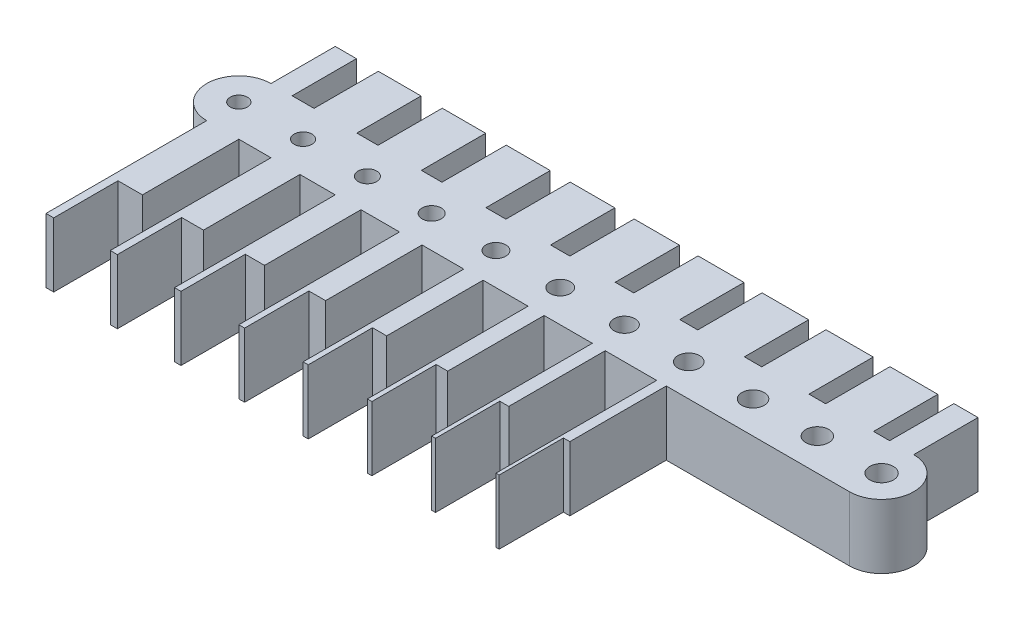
ISO-10303-21;
HEADER;
FILE_DESCRIPTION(('STEP AP214'),'2;1');
FILE_NAME('part.step','',(''),(''),'','','');
FILE_SCHEMA(('AUTOMOTIVE_DESIGN { 1 0 10303 214 1 1 1 1 }'));
ENDSEC;
DATA;
#1=APPLICATION_CONTEXT('core data for automotive mechanical design processes');
#2=APPLICATION_PROTOCOL_DEFINITION('international standard','automotive_design',2000,#1);
#3=PRODUCT_CONTEXT('',#1,'mechanical');
#4=PRODUCT('Part','Part','',(#3));
#5=PRODUCT_RELATED_PRODUCT_CATEGORY('part','',(#4));
#6=PRODUCT_DEFINITION_FORMATION('','',#4);
#7=PRODUCT_DEFINITION_CONTEXT('part definition',#1,'design');
#8=PRODUCT_DEFINITION('design','',#6,#7);
#9=PRODUCT_DEFINITION_SHAPE('','',#8);
#10=(LENGTH_UNIT() NAMED_UNIT(*) SI_UNIT(.MILLI.,.METRE.));
#11=(NAMED_UNIT(*) PLANE_ANGLE_UNIT() SI_UNIT($,.RADIAN.));
#12=(NAMED_UNIT(*) SI_UNIT($,.STERADIAN.) SOLID_ANGLE_UNIT());
#13=UNCERTAINTY_MEASURE_WITH_UNIT(LENGTH_MEASURE(1.E-05),#10,'distance_accuracy_value','');
#14=(GEOMETRIC_REPRESENTATION_CONTEXT(3) GLOBAL_UNCERTAINTY_ASSIGNED_CONTEXT((#13)) GLOBAL_UNIT_ASSIGNED_CONTEXT((#10,
#11,#12)) REPRESENTATION_CONTEXT('',''));
#15=CARTESIAN_POINT('',(0.,0.,0.));
#16=DIRECTION('',(0.,0.,1.));
#17=DIRECTION('',(1.,0.,0.));
#18=AXIS2_PLACEMENT_3D('',#15,#16,#17);
#19=CARTESIAN_POINT('',(0.,10.,-10.));
#20=DIRECTION('',(0.,0.,1.));
#21=DIRECTION('',(1.,0.,0.));
#22=AXIS2_PLACEMENT_3D('',#19,#20,#21);
#23=PLANE('',#22);
#24=DIRECTION('',(-1.,0.,0.));
#25=VECTOR('',#24,1.);
#26=CARTESIAN_POINT('',(0.,0.,-10.));
#27=LINE('',#26,#25);
#28=CARTESIAN_POINT('',(16.65,0.,-10.));
#29=VERTEX_POINT('',#28);
#30=CARTESIAN_POINT('',(13.35,0.,-10.));
#31=VERTEX_POINT('',#30);
#32=EDGE_CURVE('E47',#29,#31,#27,.T.);
#33=ORIENTED_EDGE('',*,*,#32,.T.);
#34=DIRECTION('',(0.,1.,0.));
#35=VECTOR('',#34,1.);
#36=CARTESIAN_POINT('',(13.35,-12.4700641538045,-10.));
#37=LINE('',#36,#35);
#38=CARTESIAN_POINT('',(13.35,10.,-10.));
#39=VERTEX_POINT('',#38);
#40=EDGE_CURVE('E639',#31,#39,#37,.T.);
#41=ORIENTED_EDGE('',*,*,#40,.T.);
#42=DIRECTION('',(-1.,0.,0.));
#43=VECTOR('',#42,1.);
#44=CARTESIAN_POINT('',(0.,10.,-10.));
#45=LINE('',#44,#43);
#46=CARTESIAN_POINT('',(16.65,10.,-10.));
#47=VERTEX_POINT('',#46);
#48=EDGE_CURVE('E633',#47,#39,#45,.T.);
#49=ORIENTED_EDGE('',*,*,#48,.F.);
#50=DIRECTION('',(0.,1.,0.));
#51=VECTOR('',#50,1.);
#52=CARTESIAN_POINT('',(16.65,-12.4700641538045,-10.));
#53=LINE('',#52,#51);
#54=EDGE_CURVE('E664',#29,#47,#53,.T.);
#55=ORIENTED_EDGE('',*,*,#54,.F.);
#56=EDGE_LOOP('',(#33,#41,#49,#55));
#57=FACE_BOUND('',#56,.T.);
#58=ADVANCED_FACE('F32',(#57),#23,.F.);
#59=CARTESIAN_POINT('',(26.6,0.,-10.));
#60=VERTEX_POINT('',#59);
#61=CARTESIAN_POINT('',(23.4,0.,-10.));
#62=VERTEX_POINT('',#61);
#63=EDGE_CURVE('E1951',#60,#62,#27,.T.);
#64=ORIENTED_EDGE('',*,*,#63,.T.);
#65=DIRECTION('',(0.,1.,0.));
#66=VECTOR('',#65,1.);
#67=CARTESIAN_POINT('',(23.4,-12.4700641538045,-10.));
#68=LINE('',#67,#66);
#69=CARTESIAN_POINT('',(23.4,10.,-10.));
#70=VERTEX_POINT('',#69);
#71=EDGE_CURVE('E651',#62,#70,#68,.T.);
#72=ORIENTED_EDGE('',*,*,#71,.T.);
#73=CARTESIAN_POINT('',(26.6,10.,-10.));
#74=VERTEX_POINT('',#73);
#75=EDGE_CURVE('E1940',#74,#70,#45,.T.);
#76=ORIENTED_EDGE('',*,*,#75,.F.);
#77=DIRECTION('',(0.,1.,0.));
#78=VECTOR('',#77,1.);
#79=CARTESIAN_POINT('',(26.6,-12.4700641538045,-10.));
#80=LINE('',#79,#78);
#81=EDGE_CURVE('E689',#60,#74,#80,.T.);
#82=ORIENTED_EDGE('',*,*,#81,.F.);
#83=EDGE_LOOP('',(#64,#72,#76,#82));
#84=FACE_BOUND('',#83,.T.);
#85=ADVANCED_FACE('F1520',(#84),#23,.F.);
#86=CARTESIAN_POINT('',(36.55,0.,-10.));
#87=VERTEX_POINT('',#86);
#88=CARTESIAN_POINT('',(33.45,0.,-10.));
#89=VERTEX_POINT('',#88);
#90=EDGE_CURVE('E2029',#87,#89,#27,.T.);
#91=ORIENTED_EDGE('',*,*,#90,.T.);
#92=DIRECTION('',(0.,1.,0.));
#93=VECTOR('',#92,1.);
#94=CARTESIAN_POINT('',(33.45,-12.4700641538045,-10.));
#95=LINE('',#94,#93);
#96=CARTESIAN_POINT('',(33.45,10.,-10.));
#97=VERTEX_POINT('',#96);
#98=EDGE_CURVE('E675',#89,#97,#95,.T.);
#99=ORIENTED_EDGE('',*,*,#98,.T.);
#100=CARTESIAN_POINT('',(36.55,10.,-10.));
#101=VERTEX_POINT('',#100);
#102=EDGE_CURVE('E1953',#101,#97,#45,.T.);
#103=ORIENTED_EDGE('',*,*,#102,.F.);
#104=DIRECTION('',(0.,1.,0.));
#105=VECTOR('',#104,1.);
#106=CARTESIAN_POINT('',(36.55,-12.4700641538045,-10.));
#107=LINE('',#106,#105);
#108=EDGE_CURVE('E714',#87,#101,#107,.T.);
#109=ORIENTED_EDGE('',*,*,#108,.F.);
#110=EDGE_LOOP('',(#91,#99,#103,#109));
#111=FACE_BOUND('',#110,.T.);
#112=ADVANCED_FACE('F1526',(#111),#23,.F.);
#113=CARTESIAN_POINT('',(46.5,0.,-10.));
#114=VERTEX_POINT('',#113);
#115=CARTESIAN_POINT('',(43.5,0.,-10.));
#116=VERTEX_POINT('',#115);
#117=EDGE_CURVE('E2018',#114,#116,#27,.T.);
#118=ORIENTED_EDGE('',*,*,#117,.T.);
#119=DIRECTION('',(0.,1.,0.));
#120=VECTOR('',#119,1.);
#121=CARTESIAN_POINT('',(43.5,-12.4700641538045,-10.));
#122=LINE('',#121,#120);
#123=CARTESIAN_POINT('',(43.5,10.,-10.));
#124=VERTEX_POINT('',#123);
#125=EDGE_CURVE('E700',#116,#124,#122,.T.);
#126=ORIENTED_EDGE('',*,*,#125,.T.);
#127=CARTESIAN_POINT('',(46.5,10.,-10.));
#128=VERTEX_POINT('',#127);
#129=EDGE_CURVE('E1955',#128,#124,#45,.T.);
#130=ORIENTED_EDGE('',*,*,#129,.F.);
#131=DIRECTION('',(0.,1.,0.));
#132=VECTOR('',#131,1.);
#133=CARTESIAN_POINT('',(46.5,-12.4700641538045,-10.));
#134=LINE('',#133,#132);
#135=EDGE_CURVE('E739',#114,#128,#134,.T.);
#136=ORIENTED_EDGE('',*,*,#135,.F.);
#137=EDGE_LOOP('',(#118,#126,#130,#136));
#138=FACE_BOUND('',#137,.T.);
#139=ADVANCED_FACE('F2017',(#138),#23,.F.);
#140=CARTESIAN_POINT('',(56.45,0.,-10.));
#141=VERTEX_POINT('',#140);
#142=CARTESIAN_POINT('',(53.55,0.,-10.));
#143=VERTEX_POINT('',#142);
#144=EDGE_CURVE('E2006',#141,#143,#27,.T.);
#145=ORIENTED_EDGE('',*,*,#144,.T.);
#146=DIRECTION('',(0.,1.,0.));
#147=VECTOR('',#146,1.);
#148=CARTESIAN_POINT('',(53.55,-12.4700641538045,-10.));
#149=LINE('',#148,#147);
#150=CARTESIAN_POINT('',(53.55,10.,-10.));
#151=VERTEX_POINT('',#150);
#152=EDGE_CURVE('E725',#143,#151,#149,.T.);
#153=ORIENTED_EDGE('',*,*,#152,.T.);
#154=CARTESIAN_POINT('',(56.45,10.,-10.));
#155=VERTEX_POINT('',#154);
#156=EDGE_CURVE('E1958',#155,#151,#45,.T.);
#157=ORIENTED_EDGE('',*,*,#156,.F.);
#158=DIRECTION('',(0.,1.,0.));
#159=VECTOR('',#158,1.);
#160=CARTESIAN_POINT('',(56.45,-12.4700641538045,-10.));
#161=LINE('',#160,#159);
#162=EDGE_CURVE('E764',#141,#155,#161,.T.);
#163=ORIENTED_EDGE('',*,*,#162,.F.);
#164=EDGE_LOOP('',(#145,#153,#157,#163));
#165=FACE_BOUND('',#164,.T.);
#166=ADVANCED_FACE('F2005',(#165),#23,.F.);
#167=CARTESIAN_POINT('',(66.4,0.,-10.));
#168=VERTEX_POINT('',#167);
#169=CARTESIAN_POINT('',(63.6,0.,-10.));
#170=VERTEX_POINT('',#169);
#171=EDGE_CURVE('E1994',#168,#170,#27,.T.);
#172=ORIENTED_EDGE('',*,*,#171,.T.);
#173=DIRECTION('',(0.,1.,0.));
#174=VECTOR('',#173,1.);
#175=CARTESIAN_POINT('',(63.6,-12.4700641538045,-10.));
#176=LINE('',#175,#174);
#177=CARTESIAN_POINT('',(63.6,10.,-10.));
#178=VERTEX_POINT('',#177);
#179=EDGE_CURVE('E750',#170,#178,#176,.T.);
#180=ORIENTED_EDGE('',*,*,#179,.T.);
#181=CARTESIAN_POINT('',(66.4,10.,-10.));
#182=VERTEX_POINT('',#181);
#183=EDGE_CURVE('E1961',#182,#178,#45,.T.);
#184=ORIENTED_EDGE('',*,*,#183,.F.);
#185=DIRECTION('',(0.,1.,0.));
#186=VECTOR('',#185,1.);
#187=CARTESIAN_POINT('',(66.4,-12.4700641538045,-10.));
#188=LINE('',#187,#186);
#189=EDGE_CURVE('E789',#168,#182,#188,.T.);
#190=ORIENTED_EDGE('',*,*,#189,.F.);
#191=EDGE_LOOP('',(#172,#180,#184,#190));
#192=FACE_BOUND('',#191,.T.);
#193=ADVANCED_FACE('F1993',(#192),#23,.F.);
#194=CARTESIAN_POINT('',(76.35,0.,-10.));
#195=VERTEX_POINT('',#194);
#196=CARTESIAN_POINT('',(73.65,0.,-10.));
#197=VERTEX_POINT('',#196);
#198=EDGE_CURVE('E1982',#195,#197,#27,.T.);
#199=ORIENTED_EDGE('',*,*,#198,.T.);
#200=DIRECTION('',(0.,1.,0.));
#201=VECTOR('',#200,1.);
#202=CARTESIAN_POINT('',(73.65,-12.4700641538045,-10.));
#203=LINE('',#202,#201);
#204=CARTESIAN_POINT('',(73.65,10.,-10.));
#205=VERTEX_POINT('',#204);
#206=EDGE_CURVE('E775',#197,#205,#203,.T.);
#207=ORIENTED_EDGE('',*,*,#206,.T.);
#208=CARTESIAN_POINT('',(76.35,10.,-10.));
#209=VERTEX_POINT('',#208);
#210=EDGE_CURVE('E1964',#209,#205,#45,.T.);
#211=ORIENTED_EDGE('',*,*,#210,.F.);
#212=DIRECTION('',(0.,1.,0.));
#213=VECTOR('',#212,1.);
#214=CARTESIAN_POINT('',(76.35,-12.4700641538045,-10.));
#215=LINE('',#214,#213);
#216=EDGE_CURVE('E814',#195,#209,#215,.T.);
#217=ORIENTED_EDGE('',*,*,#216,.F.);
#218=EDGE_LOOP('',(#199,#207,#211,#217));
#219=FACE_BOUND('',#218,.T.);
#220=ADVANCED_FACE('F1547',(#219),#23,.F.);
#221=CARTESIAN_POINT('',(86.3,0.,-10.));
#222=VERTEX_POINT('',#221);
#223=CARTESIAN_POINT('',(83.7,0.,-10.));
#224=VERTEX_POINT('',#223);
#225=EDGE_CURVE('E1308',#222,#224,#27,.T.);
#226=ORIENTED_EDGE('',*,*,#225,.T.);
#227=DIRECTION('',(0.,1.,0.));
#228=VECTOR('',#227,1.);
#229=CARTESIAN_POINT('',(83.7,-12.4700641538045,-10.));
#230=LINE('',#229,#228);
#231=CARTESIAN_POINT('',(83.7,10.,-10.));
#232=VERTEX_POINT('',#231);
#233=EDGE_CURVE('E800',#224,#232,#230,.T.);
#234=ORIENTED_EDGE('',*,*,#233,.T.);
#235=CARTESIAN_POINT('',(86.3,10.,-10.));
#236=VERTEX_POINT('',#235);
#237=EDGE_CURVE('E1298',#236,#232,#45,.T.);
#238=ORIENTED_EDGE('',*,*,#237,.F.);
#239=DIRECTION('',(0.,1.,0.));
#240=VECTOR('',#239,1.);
#241=CARTESIAN_POINT('',(86.3,-12.4700641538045,-10.));
#242=LINE('',#241,#240);
#243=EDGE_CURVE('E839',#222,#236,#242,.T.);
#244=ORIENTED_EDGE('',*,*,#243,.F.);
#245=EDGE_LOOP('',(#226,#234,#238,#244));
#246=FACE_BOUND('',#245,.T.);
#247=ADVANCED_FACE('F1541',(#246),#23,.F.);
#248=CARTESIAN_POINT('',(96.25,0.,-10.));
#249=VERTEX_POINT('',#248);
#250=CARTESIAN_POINT('',(93.75,0.,-10.));
#251=VERTEX_POINT('',#250);
#252=EDGE_CURVE('E1287',#249,#251,#27,.T.);
#253=ORIENTED_EDGE('',*,*,#252,.T.);
#254=DIRECTION('',(0.,1.,0.));
#255=VECTOR('',#254,1.);
#256=CARTESIAN_POINT('',(93.75,-12.4700641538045,-10.));
#257=LINE('',#256,#255);
#258=CARTESIAN_POINT('',(93.75,10.,-10.));
#259=VERTEX_POINT('',#258);
#260=EDGE_CURVE('E825',#251,#259,#257,.T.);
#261=ORIENTED_EDGE('',*,*,#260,.T.);
#262=CARTESIAN_POINT('',(96.25,10.,-10.));
#263=VERTEX_POINT('',#262);
#264=EDGE_CURVE('E1294',#263,#259,#45,.T.);
#265=ORIENTED_EDGE('',*,*,#264,.F.);
#266=DIRECTION('',(0.,1.,0.));
#267=VECTOR('',#266,1.);
#268=CARTESIAN_POINT('',(96.25,-12.4700641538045,-10.));
#269=LINE('',#268,#267);
#270=EDGE_CURVE('E872',#249,#263,#269,.T.);
#271=ORIENTED_EDGE('',*,*,#270,.F.);
#272=EDGE_LOOP('',(#253,#261,#265,#271));
#273=FACE_BOUND('',#272,.T.);
#274=ADVANCED_FACE('F1532',(#273),#23,.F.);
#275=CARTESIAN_POINT('',(0.,10.,0.));
#276=DIRECTION('',(0.,0.,-1.));
#277=DIRECTION('',(-1.,0.,0.));
#278=AXIS2_PLACEMENT_3D('',#275,#276,#277);
#279=PLANE('',#278);
#280=DIRECTION('',(1.,0.,0.));
#281=VECTOR('',#280,1.);
#282=CARTESIAN_POINT('',(0.,0.,0.));
#283=LINE('',#282,#281);
#284=CARTESIAN_POINT('',(62.,0.,0.));
#285=VERTEX_POINT('',#284);
#286=CARTESIAN_POINT('',(70.,0.,0.));
#287=VERTEX_POINT('',#286);
#288=EDGE_CURVE('E1475',#285,#287,#283,.T.);
#289=ORIENTED_EDGE('',*,*,#288,.T.);
#290=DIRECTION('',(0.,1.,0.));
#291=VECTOR('',#290,1.);
#292=CARTESIAN_POINT('',(70.,-15.8113883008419,0.));
#293=LINE('',#292,#291);
#294=CARTESIAN_POINT('',(70.,10.,0.));
#295=VERTEX_POINT('',#294);
#296=EDGE_CURVE('E1039',#287,#295,#293,.T.);
#297=ORIENTED_EDGE('',*,*,#296,.T.);
#298=DIRECTION('',(1.,0.,0.));
#299=VECTOR('',#298,1.);
#300=CARTESIAN_POINT('',(0.,10.,0.));
#301=LINE('',#300,#299);
#302=CARTESIAN_POINT('',(62.,10.,0.));
#303=VERTEX_POINT('',#302);
#304=EDGE_CURVE('E1333',#303,#295,#301,.T.);
#305=ORIENTED_EDGE('',*,*,#304,.F.);
#306=DIRECTION('',(0.,1.,0.));
#307=VECTOR('',#306,1.);
#308=CARTESIAN_POINT('',(62.,-15.8113883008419,0.));
#309=LINE('',#308,#307);
#310=EDGE_CURVE('E1074',#285,#303,#309,.T.);
#311=ORIENTED_EDGE('',*,*,#310,.F.);
#312=EDGE_LOOP('',(#289,#297,#305,#311));
#313=FACE_BOUND('',#312,.T.);
#314=ADVANCED_FACE('F1481',(#313),#279,.F.);
#315=CARTESIAN_POINT('',(52.5,0.,0.));
#316=VERTEX_POINT('',#315);
#317=CARTESIAN_POINT('',(60.,0.,0.));
#318=VERTEX_POINT('',#317);
#319=EDGE_CURVE('E1449',#316,#318,#283,.T.);
#320=ORIENTED_EDGE('',*,*,#319,.T.);
#321=DIRECTION('',(0.,1.,0.));
#322=VECTOR('',#321,1.);
#323=CARTESIAN_POINT('',(60.,-15.8113883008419,0.));
#324=LINE('',#323,#322);
#325=CARTESIAN_POINT('',(60.,10.,0.));
#326=VERTEX_POINT('',#325);
#327=EDGE_CURVE('E1062',#318,#326,#324,.T.);
#328=ORIENTED_EDGE('',*,*,#327,.T.);
#329=CARTESIAN_POINT('',(52.5,10.,0.));
#330=VERTEX_POINT('',#329);
#331=EDGE_CURVE('E1335',#330,#326,#301,.T.);
#332=ORIENTED_EDGE('',*,*,#331,.F.);
#333=DIRECTION('',(0.,1.,0.));
#334=VECTOR('',#333,1.);
#335=CARTESIAN_POINT('',(52.5,-15.8113883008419,0.));
#336=LINE('',#335,#334);
#337=EDGE_CURVE('E1097',#316,#330,#336,.T.);
#338=ORIENTED_EDGE('',*,*,#337,.F.);
#339=EDGE_LOOP('',(#320,#328,#332,#338));
#340=FACE_BOUND('',#339,.T.);
#341=ADVANCED_FACE('F1455',(#340),#279,.F.);
#342=CARTESIAN_POINT('',(43.,0.,0.));
#343=VERTEX_POINT('',#342);
#344=CARTESIAN_POINT('',(50.,0.,0.));
#345=VERTEX_POINT('',#344);
#346=EDGE_CURVE('E1423',#343,#345,#283,.T.);
#347=ORIENTED_EDGE('',*,*,#346,.T.);
#348=DIRECTION('',(0.,1.,0.));
#349=VECTOR('',#348,1.);
#350=CARTESIAN_POINT('',(50.,-15.8113883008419,0.));
#351=LINE('',#350,#349);
#352=CARTESIAN_POINT('',(50.,10.,0.));
#353=VERTEX_POINT('',#352);
#354=EDGE_CURVE('E1085',#345,#353,#351,.T.);
#355=ORIENTED_EDGE('',*,*,#354,.T.);
#356=CARTESIAN_POINT('',(43.,10.,0.));
#357=VERTEX_POINT('',#356);
#358=EDGE_CURVE('E1338',#357,#353,#301,.T.);
#359=ORIENTED_EDGE('',*,*,#358,.F.);
#360=DIRECTION('',(0.,1.,0.));
#361=VECTOR('',#360,1.);
#362=CARTESIAN_POINT('',(43.,-15.8113883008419,0.));
#363=LINE('',#362,#361);
#364=EDGE_CURVE('E1120',#343,#357,#363,.T.);
#365=ORIENTED_EDGE('',*,*,#364,.F.);
#366=EDGE_LOOP('',(#347,#355,#359,#365));
#367=FACE_BOUND('',#366,.T.);
#368=ADVANCED_FACE('F1429',(#367),#279,.F.);
#369=CARTESIAN_POINT('',(33.5,0.,0.));
#370=VERTEX_POINT('',#369);
#371=CARTESIAN_POINT('',(40.,0.,0.));
#372=VERTEX_POINT('',#371);
#373=EDGE_CURVE('E1397',#370,#372,#283,.T.);
#374=ORIENTED_EDGE('',*,*,#373,.T.);
#375=DIRECTION('',(0.,1.,0.));
#376=VECTOR('',#375,1.);
#377=CARTESIAN_POINT('',(40.,-15.8113883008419,0.));
#378=LINE('',#377,#376);
#379=CARTESIAN_POINT('',(40.,10.,0.));
#380=VERTEX_POINT('',#379);
#381=EDGE_CURVE('E1108',#372,#380,#378,.T.);
#382=ORIENTED_EDGE('',*,*,#381,.T.);
#383=CARTESIAN_POINT('',(33.5,10.,0.));
#384=VERTEX_POINT('',#383);
#385=EDGE_CURVE('E1341',#384,#380,#301,.T.);
#386=ORIENTED_EDGE('',*,*,#385,.F.);
#387=DIRECTION('',(0.,1.,0.));
#388=VECTOR('',#387,1.);
#389=CARTESIAN_POINT('',(33.5,-15.8113883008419,0.));
#390=LINE('',#389,#388);
#391=EDGE_CURVE('E1143',#370,#384,#390,.T.);
#392=ORIENTED_EDGE('',*,*,#391,.F.);
#393=EDGE_LOOP('',(#374,#382,#386,#392));
#394=FACE_BOUND('',#393,.T.);
#395=ADVANCED_FACE('F1403',(#394),#279,.F.);
#396=CARTESIAN_POINT('',(24.,0.,0.));
#397=VERTEX_POINT('',#396);
#398=CARTESIAN_POINT('',(30.,0.,0.));
#399=VERTEX_POINT('',#398);
#400=EDGE_CURVE('E1377',#397,#399,#283,.T.);
#401=ORIENTED_EDGE('',*,*,#400,.T.);
#402=DIRECTION('',(0.,1.,0.));
#403=VECTOR('',#402,1.);
#404=CARTESIAN_POINT('',(30.,-15.8113883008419,0.));
#405=LINE('',#404,#403);
#406=CARTESIAN_POINT('',(30.,10.,0.));
#407=VERTEX_POINT('',#406);
#408=EDGE_CURVE('E1131',#399,#407,#405,.T.);
#409=ORIENTED_EDGE('',*,*,#408,.T.);
#410=CARTESIAN_POINT('',(24.,10.,0.));
#411=VERTEX_POINT('',#410);
#412=EDGE_CURVE('E1344',#411,#407,#301,.T.);
#413=ORIENTED_EDGE('',*,*,#412,.F.);
#414=DIRECTION('',(0.,1.,0.));
#415=VECTOR('',#414,1.);
#416=CARTESIAN_POINT('',(24.,-15.8113883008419,0.));
#417=LINE('',#416,#415);
#418=EDGE_CURVE('E1166',#397,#411,#417,.T.);
#419=ORIENTED_EDGE('',*,*,#418,.F.);
#420=EDGE_LOOP('',(#401,#409,#413,#419));
#421=FACE_BOUND('',#420,.T.);
#422=ADVANCED_FACE('F1376',(#421),#279,.F.);
#423=CARTESIAN_POINT('',(14.5,0.,0.));
#424=VERTEX_POINT('',#423);
#425=CARTESIAN_POINT('',(20.,0.,0.));
#426=VERTEX_POINT('',#425);
#427=EDGE_CURVE('E1304',#424,#426,#283,.T.);
#428=ORIENTED_EDGE('',*,*,#427,.T.);
#429=DIRECTION('',(0.,1.,0.));
#430=VECTOR('',#429,1.);
#431=CARTESIAN_POINT('',(20.,-15.8113883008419,0.));
#432=LINE('',#431,#430);
#433=CARTESIAN_POINT('',(20.,10.,0.));
#434=VERTEX_POINT('',#433);
#435=EDGE_CURVE('E1154',#426,#434,#432,.T.);
#436=ORIENTED_EDGE('',*,*,#435,.T.);
#437=CARTESIAN_POINT('',(14.5,10.,0.));
#438=VERTEX_POINT('',#437);
#439=EDGE_CURVE('E1292',#438,#434,#301,.T.);
#440=ORIENTED_EDGE('',*,*,#439,.F.);
#441=DIRECTION('',(0.,1.,0.));
#442=VECTOR('',#441,1.);
#443=CARTESIAN_POINT('',(14.5,-15.8113883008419,0.));
#444=LINE('',#443,#442);
#445=EDGE_CURVE('E1189',#424,#438,#444,.T.);
#446=ORIENTED_EDGE('',*,*,#445,.F.);
#447=EDGE_LOOP('',(#428,#436,#440,#446));
#448=FACE_BOUND('',#447,.T.);
#449=ADVANCED_FACE('F1504',(#448),#279,.F.);
#450=CARTESIAN_POINT('',(5.,0.,0.));
#451=VERTEX_POINT('',#450);
#452=CARTESIAN_POINT('',(10.,0.,0.));
#453=VERTEX_POINT('',#452);
#454=EDGE_CURVE('E1301',#451,#453,#283,.T.);
#455=ORIENTED_EDGE('',*,*,#454,.T.);
#456=DIRECTION('',(0.,1.,0.));
#457=VECTOR('',#456,1.);
#458=CARTESIAN_POINT('',(10.,-15.8113883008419,0.));
#459=LINE('',#458,#457);
#460=CARTESIAN_POINT('',(10.,10.,0.));
#461=VERTEX_POINT('',#460);
#462=EDGE_CURVE('E1177',#453,#461,#459,.T.);
#463=ORIENTED_EDGE('',*,*,#462,.T.);
#464=CARTESIAN_POINT('',(5.,10.,0.));
#465=VERTEX_POINT('',#464);
#466=EDGE_CURVE('E1288',#465,#461,#301,.T.);
#467=ORIENTED_EDGE('',*,*,#466,.F.);
#468=DIRECTION('',(0.,1.,0.));
#469=VECTOR('',#468,1.);
#470=CARTESIAN_POINT('',(5.,-15.8113883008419,0.));
#471=LINE('',#470,#469);
#472=EDGE_CURVE('E1200',#451,#465,#471,.T.);
#473=ORIENTED_EDGE('',*,*,#472,.F.);
#474=EDGE_LOOP('',(#455,#463,#467,#473));
#475=FACE_BOUND('',#474,.T.);
#476=ADVANCED_FACE('F2188',(#475),#279,.F.);
#477=CARTESIAN_POINT('',(0.,10.,-4.99999999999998));
#478=DIRECTION('',(0.,1.,0.));
#479=DIRECTION('',(0.,0.,1.));
#480=AXIS2_PLACEMENT_3D('',#477,#478,#479);
#481=PLANE('',#480);
#482=CARTESIAN_POINT('',(100.,10.,-5.));
#483=DIRECTION('',(0.,1.,0.));
#484=DIRECTION('',(0.,0.,1.));
#485=AXIS2_PLACEMENT_3D('',#482,#483,#484);
#486=CIRCLE('',#485,1.83750000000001);
#487=CARTESIAN_POINT('',(100.,10.,-3.16249999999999));
#488=VERTEX_POINT('',#487);
#489=EDGE_CURVE('E1224',#488,#488,#486,.T.);
#490=ORIENTED_EDGE('',*,*,#489,.F.);
#491=EDGE_LOOP('',(#490));
#492=FACE_BOUND('',#491,.T.);
#493=CARTESIAN_POINT('',(20.,10.,-4.99999999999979));
#494=DIRECTION('',(0.,1.,0.));
#495=DIRECTION('',(0.,0.,1.));
#496=AXIS2_PLACEMENT_3D('',#493,#494,#495);
#497=CIRCLE('',#496,1.4375);
#498=CARTESIAN_POINT('',(20.,10.,-3.56249999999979));
#499=VERTEX_POINT('',#498);
#500=EDGE_CURVE('E1236',#499,#499,#497,.T.);
#501=ORIENTED_EDGE('',*,*,#500,.F.);
#502=EDGE_LOOP('',(#501));
#503=FACE_BOUND('',#502,.T.);
#504=CARTESIAN_POINT('',(40.,10.,-4.99999999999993));
#505=DIRECTION('',(0.,1.,0.));
#506=DIRECTION('',(0.,0.,1.));
#507=AXIS2_PLACEMENT_3D('',#504,#505,#506);
#508=CIRCLE('',#507,1.53749999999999);
#509=CARTESIAN_POINT('',(40.,10.,-3.46249999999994));
#510=VERTEX_POINT('',#509);
#511=EDGE_CURVE('E1248',#510,#510,#508,.T.);
#512=ORIENTED_EDGE('',*,*,#511,.F.);
#513=EDGE_LOOP('',(#512));
#514=FACE_BOUND('',#513,.T.);
#515=CARTESIAN_POINT('',(80.,10.,-5.));
#516=DIRECTION('',(0.,1.,0.));
#517=DIRECTION('',(0.,0.,1.));
#518=AXIS2_PLACEMENT_3D('',#515,#516,#517);
#519=CIRCLE('',#518,1.7375);
#520=CARTESIAN_POINT('',(80.,10.,-3.2625));
#521=VERTEX_POINT('',#520);
#522=EDGE_CURVE('E1260',#521,#521,#519,.T.);
#523=ORIENTED_EDGE('',*,*,#522,.F.);
#524=EDGE_LOOP('',(#523));
#525=FACE_BOUND('',#524,.T.);
#526=CARTESIAN_POINT('',(60.,10.,-5.));
#527=DIRECTION('',(0.,1.,0.));
#528=DIRECTION('',(0.,0.,1.));
#529=AXIS2_PLACEMENT_3D('',#526,#527,#528);
#530=CIRCLE('',#529,1.6375);
#531=CARTESIAN_POINT('',(60.,10.,-3.3625));
#532=VERTEX_POINT('',#531);
#533=EDGE_CURVE('E1272',#532,#532,#530,.T.);
#534=ORIENTED_EDGE('',*,*,#533,.F.);
#535=EDGE_LOOP('',(#534));
#536=FACE_BOUND('',#535,.T.);
#537=CARTESIAN_POINT('',(0.,10.,-4.99999999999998));
#538=DIRECTION('',(0.,1.,0.));
#539=DIRECTION('',(0.,0.,1.));
#540=AXIS2_PLACEMENT_3D('',#537,#538,#539);
#541=CIRCLE('',#540,5.);
#542=CARTESIAN_POINT('',(0.,10.,-10.));
#543=VERTEX_POINT('',#542);
#544=CARTESIAN_POINT('',(0.,10.,0.));
#545=VERTEX_POINT('',#544);
#546=EDGE_CURVE('E1284',#543,#545,#541,.T.);
#547=ORIENTED_EDGE('',*,*,#546,.T.);
#548=DIRECTION('',(0.,0.,1.));
#549=VECTOR('',#548,1.);
#550=CARTESIAN_POINT('',(0.,10.,0.));
#551=LINE('',#550,#549);
#552=CARTESIAN_POINT('',(0.,10.,25.));
#553=VERTEX_POINT('',#552);
#554=EDGE_CURVE('E1196',#545,#553,#551,.T.);
#555=ORIENTED_EDGE('',*,*,#554,.T.);
#556=DIRECTION('',(1.,0.,0.));
#557=VECTOR('',#556,1.);
#558=CARTESIAN_POINT('',(0.,10.,25.));
#559=LINE('',#558,#557);
#560=CARTESIAN_POINT('',(1.2,10.,25.));
#561=VERTEX_POINT('',#560);
#562=EDGE_CURVE('E1017',#553,#561,#559,.T.);
#563=ORIENTED_EDGE('',*,*,#562,.T.);
#564=DIRECTION('',(0.,0.,-1.));
#565=VECTOR('',#564,1.);
#566=CARTESIAN_POINT('',(1.2,10.,15.));
#567=LINE('',#566,#565);
#568=CARTESIAN_POINT('',(1.2,10.,15.));
#569=VERTEX_POINT('',#568);
#570=EDGE_CURVE('E1024',#561,#569,#567,.T.);
#571=ORIENTED_EDGE('',*,*,#570,.T.);
#572=DIRECTION('',(1.,0.,0.));
#573=VECTOR('',#572,1.);
#574=CARTESIAN_POINT('',(0.,10.,15.));
#575=LINE('',#574,#573);
#576=CARTESIAN_POINT('',(5.,10.,15.));
#577=VERTEX_POINT('',#576);
#578=EDGE_CURVE('E1205',#569,#577,#575,.T.);
#579=ORIENTED_EDGE('',*,*,#578,.T.);
#580=DIRECTION('',(0.,0.,-1.));
#581=VECTOR('',#580,1.);
#582=CARTESIAN_POINT('',(5.,10.,0.));
#583=LINE('',#582,#581);
#584=EDGE_CURVE('E1207',#577,#465,#583,.T.);
#585=ORIENTED_EDGE('',*,*,#584,.T.);
#586=ORIENTED_EDGE('',*,*,#466,.T.);
#587=DIRECTION('',(0.,0.,1.));
#588=VECTOR('',#587,1.);
#589=CARTESIAN_POINT('',(10.,10.,0.));
#590=LINE('',#589,#588);
#591=CARTESIAN_POINT('',(10.,10.,25.));
#592=VERTEX_POINT('',#591);
#593=EDGE_CURVE('E1173',#461,#592,#590,.T.);
#594=ORIENTED_EDGE('',*,*,#593,.T.);
#595=DIRECTION('',(1.,0.,0.));
#596=VECTOR('',#595,1.);
#597=CARTESIAN_POINT('',(10.,10.,25.));
#598=LINE('',#597,#596);
#599=CARTESIAN_POINT('',(11.1,10.,25.));
#600=VERTEX_POINT('',#599);
#601=EDGE_CURVE('E999',#592,#600,#598,.T.);
#602=ORIENTED_EDGE('',*,*,#601,.T.);
#603=DIRECTION('',(0.,0.,-1.));
#604=VECTOR('',#603,1.);
#605=CARTESIAN_POINT('',(11.1,10.,15.));
#606=LINE('',#605,#604);
#607=CARTESIAN_POINT('',(11.1,10.,15.));
#608=VERTEX_POINT('',#607);
#609=EDGE_CURVE('E1006',#600,#608,#606,.T.);
#610=ORIENTED_EDGE('',*,*,#609,.T.);
#611=DIRECTION('',(1.,0.,0.));
#612=VECTOR('',#611,1.);
#613=CARTESIAN_POINT('',(10.,10.,15.));
#614=LINE('',#613,#612);
#615=CARTESIAN_POINT('',(14.5,10.,15.));
#616=VERTEX_POINT('',#615);
#617=EDGE_CURVE('E1182',#608,#616,#614,.T.);
#618=ORIENTED_EDGE('',*,*,#617,.T.);
#619=DIRECTION('',(0.,0.,-1.));
#620=VECTOR('',#619,1.);
#621=CARTESIAN_POINT('',(14.5,10.,0.));
#622=LINE('',#621,#620);
#623=EDGE_CURVE('E1184',#616,#438,#622,.T.);
#624=ORIENTED_EDGE('',*,*,#623,.T.);
#625=ORIENTED_EDGE('',*,*,#439,.T.);
#626=DIRECTION('',(0.,0.,1.));
#627=VECTOR('',#626,1.);
#628=CARTESIAN_POINT('',(20.,10.,0.));
#629=LINE('',#628,#627);
#630=CARTESIAN_POINT('',(20.,10.,25.));
#631=VERTEX_POINT('',#630);
#632=EDGE_CURVE('E1150',#434,#631,#629,.T.);
#633=ORIENTED_EDGE('',*,*,#632,.T.);
#634=DIRECTION('',(1.,0.,0.));
#635=VECTOR('',#634,1.);
#636=CARTESIAN_POINT('',(20.,10.,25.));
#637=LINE('',#636,#635);
#638=CARTESIAN_POINT('',(21.,10.,25.));
#639=VERTEX_POINT('',#638);
#640=EDGE_CURVE('E981',#631,#639,#637,.T.);
#641=ORIENTED_EDGE('',*,*,#640,.T.);
#642=DIRECTION('',(0.,0.,-1.));
#643=VECTOR('',#642,1.);
#644=CARTESIAN_POINT('',(21.,10.,15.));
#645=LINE('',#644,#643);
#646=CARTESIAN_POINT('',(21.,10.,15.));
#647=VERTEX_POINT('',#646);
#648=EDGE_CURVE('E988',#639,#647,#645,.T.);
#649=ORIENTED_EDGE('',*,*,#648,.T.);
#650=DIRECTION('',(1.,0.,0.));
#651=VECTOR('',#650,1.);
#652=CARTESIAN_POINT('',(20.,10.,15.));
#653=LINE('',#652,#651);
#654=CARTESIAN_POINT('',(24.,10.,15.));
#655=VERTEX_POINT('',#654);
#656=EDGE_CURVE('E1159',#647,#655,#653,.T.);
#657=ORIENTED_EDGE('',*,*,#656,.T.);
#658=DIRECTION('',(0.,0.,-1.));
#659=VECTOR('',#658,1.);
#660=CARTESIAN_POINT('',(24.,10.,0.));
#661=LINE('',#660,#659);
#662=EDGE_CURVE('E1161',#655,#411,#661,.T.);
#663=ORIENTED_EDGE('',*,*,#662,.T.);
#664=ORIENTED_EDGE('',*,*,#412,.T.);
#665=DIRECTION('',(0.,0.,1.));
#666=VECTOR('',#665,1.);
#667=CARTESIAN_POINT('',(30.,10.,0.));
#668=LINE('',#667,#666);
#669=CARTESIAN_POINT('',(30.,10.,25.));
#670=VERTEX_POINT('',#669);
#671=EDGE_CURVE('E1127',#407,#670,#668,.T.);
#672=ORIENTED_EDGE('',*,*,#671,.T.);
#673=DIRECTION('',(1.,0.,0.));
#674=VECTOR('',#673,1.);
#675=CARTESIAN_POINT('',(30.,10.,25.));
#676=LINE('',#675,#674);
#677=CARTESIAN_POINT('',(30.9,10.,25.));
#678=VERTEX_POINT('',#677);
#679=EDGE_CURVE('E963',#670,#678,#676,.T.);
#680=ORIENTED_EDGE('',*,*,#679,.T.);
#681=DIRECTION('',(0.,0.,-1.));
#682=VECTOR('',#681,1.);
#683=CARTESIAN_POINT('',(30.9,10.,15.));
#684=LINE('',#683,#682);
#685=CARTESIAN_POINT('',(30.9,10.,15.));
#686=VERTEX_POINT('',#685);
#687=EDGE_CURVE('E970',#678,#686,#684,.T.);
#688=ORIENTED_EDGE('',*,*,#687,.T.);
#689=DIRECTION('',(1.,0.,0.));
#690=VECTOR('',#689,1.);
#691=CARTESIAN_POINT('',(30.,10.,15.));
#692=LINE('',#691,#690);
#693=CARTESIAN_POINT('',(33.5,10.,15.));
#694=VERTEX_POINT('',#693);
#695=EDGE_CURVE('E1136',#686,#694,#692,.T.);
#696=ORIENTED_EDGE('',*,*,#695,.T.);
#697=DIRECTION('',(0.,0.,-1.));
#698=VECTOR('',#697,1.);
#699=CARTESIAN_POINT('',(33.5,10.,0.));
#700=LINE('',#699,#698);
#701=EDGE_CURVE('E1138',#694,#384,#700,.T.);
#702=ORIENTED_EDGE('',*,*,#701,.T.);
#703=ORIENTED_EDGE('',*,*,#385,.T.);
#704=DIRECTION('',(0.,0.,1.));
#705=VECTOR('',#704,1.);
#706=CARTESIAN_POINT('',(40.,10.,0.));
#707=LINE('',#706,#705);
#708=CARTESIAN_POINT('',(40.,10.,25.));
#709=VERTEX_POINT('',#708);
#710=EDGE_CURVE('E1104',#380,#709,#707,.T.);
#711=ORIENTED_EDGE('',*,*,#710,.T.);
#712=DIRECTION('',(1.,0.,0.));
#713=VECTOR('',#712,1.);
#714=CARTESIAN_POINT('',(40.,10.,25.));
#715=LINE('',#714,#713);
#716=CARTESIAN_POINT('',(40.8,10.,25.));
#717=VERTEX_POINT('',#716);
#718=EDGE_CURVE('E945',#709,#717,#715,.T.);
#719=ORIENTED_EDGE('',*,*,#718,.T.);
#720=DIRECTION('',(0.,0.,-1.));
#721=VECTOR('',#720,1.);
#722=CARTESIAN_POINT('',(40.8,10.,15.));
#723=LINE('',#722,#721);
#724=CARTESIAN_POINT('',(40.8,10.,15.));
#725=VERTEX_POINT('',#724);
#726=EDGE_CURVE('E952',#717,#725,#723,.T.);
#727=ORIENTED_EDGE('',*,*,#726,.T.);
#728=DIRECTION('',(1.,0.,0.));
#729=VECTOR('',#728,1.);
#730=CARTESIAN_POINT('',(40.,10.,15.));
#731=LINE('',#730,#729);
#732=CARTESIAN_POINT('',(43.,10.,15.));
#733=VERTEX_POINT('',#732);
#734=EDGE_CURVE('E1113',#725,#733,#731,.T.);
#735=ORIENTED_EDGE('',*,*,#734,.T.);
#736=DIRECTION('',(0.,0.,-1.));
#737=VECTOR('',#736,1.);
#738=CARTESIAN_POINT('',(43.,10.,0.));
#739=LINE('',#738,#737);
#740=EDGE_CURVE('E1115',#733,#357,#739,.T.);
#741=ORIENTED_EDGE('',*,*,#740,.T.);
#742=ORIENTED_EDGE('',*,*,#358,.T.);
#743=DIRECTION('',(0.,0.,1.));
#744=VECTOR('',#743,1.);
#745=CARTESIAN_POINT('',(50.,10.,0.));
#746=LINE('',#745,#744);
#747=CARTESIAN_POINT('',(50.,10.,25.));
#748=VERTEX_POINT('',#747);
#749=EDGE_CURVE('E1081',#353,#748,#746,.T.);
#750=ORIENTED_EDGE('',*,*,#749,.T.);
#751=DIRECTION('',(1.,0.,0.));
#752=VECTOR('',#751,1.);
#753=CARTESIAN_POINT('',(50.,10.,25.));
#754=LINE('',#753,#752);
#755=CARTESIAN_POINT('',(50.7,10.,25.));
#756=VERTEX_POINT('',#755);
#757=EDGE_CURVE('E927',#748,#756,#754,.T.);
#758=ORIENTED_EDGE('',*,*,#757,.T.);
#759=DIRECTION('',(0.,0.,-1.));
#760=VECTOR('',#759,1.);
#761=CARTESIAN_POINT('',(50.7,10.,15.));
#762=LINE('',#761,#760);
#763=CARTESIAN_POINT('',(50.7,10.,15.));
#764=VERTEX_POINT('',#763);
#765=EDGE_CURVE('E934',#756,#764,#762,.T.);
#766=ORIENTED_EDGE('',*,*,#765,.T.);
#767=DIRECTION('',(1.,0.,0.));
#768=VECTOR('',#767,1.);
#769=CARTESIAN_POINT('',(50.,10.,15.));
#770=LINE('',#769,#768);
#771=CARTESIAN_POINT('',(52.5,10.,15.));
#772=VERTEX_POINT('',#771);
#773=EDGE_CURVE('E1090',#764,#772,#770,.T.);
#774=ORIENTED_EDGE('',*,*,#773,.T.);
#775=DIRECTION('',(0.,0.,-1.));
#776=VECTOR('',#775,1.);
#777=CARTESIAN_POINT('',(52.5,10.,0.));
#778=LINE('',#777,#776);
#779=EDGE_CURVE('E1092',#772,#330,#778,.T.);
#780=ORIENTED_EDGE('',*,*,#779,.T.);
#781=ORIENTED_EDGE('',*,*,#331,.T.);
#782=DIRECTION('',(0.,0.,1.));
#783=VECTOR('',#782,1.);
#784=CARTESIAN_POINT('',(60.,10.,0.));
#785=LINE('',#784,#783);
#786=CARTESIAN_POINT('',(60.,10.,25.));
#787=VERTEX_POINT('',#786);
#788=EDGE_CURVE('E1058',#326,#787,#785,.T.);
#789=ORIENTED_EDGE('',*,*,#788,.T.);
#790=DIRECTION('',(1.,0.,0.));
#791=VECTOR('',#790,1.);
#792=CARTESIAN_POINT('',(60.,10.,25.));
#793=LINE('',#792,#791);
#794=CARTESIAN_POINT('',(60.6,10.,25.));
#795=VERTEX_POINT('',#794);
#796=EDGE_CURVE('E909',#787,#795,#793,.T.);
#797=ORIENTED_EDGE('',*,*,#796,.T.);
#798=DIRECTION('',(0.,0.,-1.));
#799=VECTOR('',#798,1.);
#800=CARTESIAN_POINT('',(60.6,10.,15.));
#801=LINE('',#800,#799);
#802=CARTESIAN_POINT('',(60.6,10.,15.));
#803=VERTEX_POINT('',#802);
#804=EDGE_CURVE('E916',#795,#803,#801,.T.);
#805=ORIENTED_EDGE('',*,*,#804,.T.);
#806=DIRECTION('',(1.,0.,0.));
#807=VECTOR('',#806,1.);
#808=CARTESIAN_POINT('',(60.,10.,15.));
#809=LINE('',#808,#807);
#810=CARTESIAN_POINT('',(62.,10.,15.));
#811=VERTEX_POINT('',#810);
#812=EDGE_CURVE('E1067',#803,#811,#809,.T.);
#813=ORIENTED_EDGE('',*,*,#812,.T.);
#814=DIRECTION('',(0.,0.,-1.));
#815=VECTOR('',#814,1.);
#816=CARTESIAN_POINT('',(62.,10.,0.));
#817=LINE('',#816,#815);
#818=EDGE_CURVE('E1069',#811,#303,#817,.T.);
#819=ORIENTED_EDGE('',*,*,#818,.T.);
#820=ORIENTED_EDGE('',*,*,#304,.T.);
#821=DIRECTION('',(0.,0.,1.));
#822=VECTOR('',#821,1.);
#823=CARTESIAN_POINT('',(70.,10.,0.));
#824=LINE('',#823,#822);
#825=CARTESIAN_POINT('',(70.,10.,25.));
#826=VERTEX_POINT('',#825);
#827=EDGE_CURVE('E1035',#295,#826,#824,.T.);
#828=ORIENTED_EDGE('',*,*,#827,.T.);
#829=DIRECTION('',(1.,0.,0.));
#830=VECTOR('',#829,1.);
#831=CARTESIAN_POINT('',(70.,10.,25.));
#832=LINE('',#831,#830);
#833=CARTESIAN_POINT('',(70.5,10.,25.));
#834=VERTEX_POINT('',#833);
#835=EDGE_CURVE('E891',#826,#834,#832,.T.);
#836=ORIENTED_EDGE('',*,*,#835,.T.);
#837=DIRECTION('',(0.,0.,-1.));
#838=VECTOR('',#837,1.);
#839=CARTESIAN_POINT('',(70.5,10.,15.));
#840=LINE('',#839,#838);
#841=CARTESIAN_POINT('',(70.5,10.,15.));
#842=VERTEX_POINT('',#841);
#843=EDGE_CURVE('E898',#834,#842,#840,.T.);
#844=ORIENTED_EDGE('',*,*,#843,.T.);
#845=DIRECTION('',(1.,0.,0.));
#846=VECTOR('',#845,1.);
#847=CARTESIAN_POINT('',(70.,10.,15.));
#848=LINE('',#847,#846);
#849=CARTESIAN_POINT('',(71.5,10.,15.));
#850=VERTEX_POINT('',#849);
#851=EDGE_CURVE('E1044',#842,#850,#848,.T.);
#852=ORIENTED_EDGE('',*,*,#851,.T.);
#853=DIRECTION('',(0.,0.,-1.));
#854=VECTOR('',#853,1.);
#855=CARTESIAN_POINT('',(71.5,10.,0.));
#856=LINE('',#855,#854);
#857=CARTESIAN_POINT('',(71.5,10.,0.));
#858=VERTEX_POINT('',#857);
#859=EDGE_CURVE('E1046',#850,#858,#856,.T.);
#860=ORIENTED_EDGE('',*,*,#859,.T.);
#861=CARTESIAN_POINT('',(100.,10.,0.));
#862=VERTEX_POINT('',#861);
#863=EDGE_CURVE('E1286',#858,#862,#301,.T.);
#864=ORIENTED_EDGE('',*,*,#863,.T.);
#865=CARTESIAN_POINT('',(100.,10.,-5.));
#866=DIRECTION('',(0.,1.,0.));
#867=DIRECTION('',(0.,0.,-1.));
#868=AXIS2_PLACEMENT_3D('',#865,#866,#867);
#869=CIRCLE('',#868,5.00000000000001);
#870=CARTESIAN_POINT('',(100.,10.,-10.));
#871=VERTEX_POINT('',#870);
#872=EDGE_CURVE('E1291',#862,#871,#869,.T.);
#873=ORIENTED_EDGE('',*,*,#872,.T.);
#874=DIRECTION('',(0.,0.,-1.));
#875=VECTOR('',#874,1.);
#876=CARTESIAN_POINT('',(100.,10.,-10.));
#877=LINE('',#876,#875);
#878=CARTESIAN_POINT('',(100.,10.,-20.));
#879=VERTEX_POINT('',#878);
#880=EDGE_CURVE('E855',#871,#879,#877,.T.);
#881=ORIENTED_EDGE('',*,*,#880,.T.);
#882=DIRECTION('',(-1.,0.,0.));
#883=VECTOR('',#882,1.);
#884=CARTESIAN_POINT('',(100.,10.,-20.));
#885=LINE('',#884,#883);
#886=CARTESIAN_POINT('',(96.25,10.,-20.));
#887=VERTEX_POINT('',#886);
#888=EDGE_CURVE('E878',#879,#887,#885,.T.);
#889=ORIENTED_EDGE('',*,*,#888,.T.);
#890=DIRECTION('',(0.,0.,1.));
#891=VECTOR('',#890,1.);
#892=CARTESIAN_POINT('',(96.25,10.,-10.));
#893=LINE('',#892,#891);
#894=EDGE_CURVE('E881',#887,#263,#893,.T.);
#895=ORIENTED_EDGE('',*,*,#894,.T.);
#896=ORIENTED_EDGE('',*,*,#264,.T.);
#897=DIRECTION('',(0.,0.,-1.));
#898=VECTOR('',#897,1.);
#899=CARTESIAN_POINT('',(93.75,10.,-10.));
#900=LINE('',#899,#898);
#901=CARTESIAN_POINT('',(93.75,10.,-20.));
#902=VERTEX_POINT('',#901);
#903=EDGE_CURVE('E821',#259,#902,#900,.T.);
#904=ORIENTED_EDGE('',*,*,#903,.T.);
#905=DIRECTION('',(-1.,0.,0.));
#906=VECTOR('',#905,1.);
#907=CARTESIAN_POINT('',(93.75,10.,-20.));
#908=LINE('',#907,#906);
#909=CARTESIAN_POINT('',(86.3,10.,-20.));
#910=VERTEX_POINT('',#909);
#911=EDGE_CURVE('E831',#902,#910,#908,.T.);
#912=ORIENTED_EDGE('',*,*,#911,.T.);
#913=DIRECTION('',(0.,0.,1.));
#914=VECTOR('',#913,1.);
#915=CARTESIAN_POINT('',(86.3,10.,-10.));
#916=LINE('',#915,#914);
#917=EDGE_CURVE('E834',#910,#236,#916,.T.);
#918=ORIENTED_EDGE('',*,*,#917,.T.);
#919=ORIENTED_EDGE('',*,*,#237,.T.);
#920=DIRECTION('',(0.,0.,-1.));
#921=VECTOR('',#920,1.);
#922=CARTESIAN_POINT('',(83.7,10.,-10.));
#923=LINE('',#922,#921);
#924=CARTESIAN_POINT('',(83.7,10.,-20.));
#925=VERTEX_POINT('',#924);
#926=EDGE_CURVE('E796',#232,#925,#923,.T.);
#927=ORIENTED_EDGE('',*,*,#926,.T.);
#928=DIRECTION('',(-1.,0.,0.));
#929=VECTOR('',#928,1.);
#930=CARTESIAN_POINT('',(83.7,10.,-20.));
#931=LINE('',#930,#929);
#932=CARTESIAN_POINT('',(76.35,10.,-20.));
#933=VERTEX_POINT('',#932);
#934=EDGE_CURVE('E806',#925,#933,#931,.T.);
#935=ORIENTED_EDGE('',*,*,#934,.T.);
#936=DIRECTION('',(0.,0.,1.));
#937=VECTOR('',#936,1.);
#938=CARTESIAN_POINT('',(76.35,10.,-10.));
#939=LINE('',#938,#937);
#940=EDGE_CURVE('E809',#933,#209,#939,.T.);
#941=ORIENTED_EDGE('',*,*,#940,.T.);
#942=ORIENTED_EDGE('',*,*,#210,.T.);
#943=DIRECTION('',(0.,0.,-1.));
#944=VECTOR('',#943,1.);
#945=CARTESIAN_POINT('',(73.65,10.,-10.));
#946=LINE('',#945,#944);
#947=CARTESIAN_POINT('',(73.65,10.,-20.));
#948=VERTEX_POINT('',#947);
#949=EDGE_CURVE('E771',#205,#948,#946,.T.);
#950=ORIENTED_EDGE('',*,*,#949,.T.);
#951=DIRECTION('',(-1.,0.,0.));
#952=VECTOR('',#951,1.);
#953=CARTESIAN_POINT('',(73.65,10.,-20.));
#954=LINE('',#953,#952);
#955=CARTESIAN_POINT('',(66.4,10.,-20.));
#956=VERTEX_POINT('',#955);
#957=EDGE_CURVE('E781',#948,#956,#954,.T.);
#958=ORIENTED_EDGE('',*,*,#957,.T.);
#959=DIRECTION('',(0.,0.,1.));
#960=VECTOR('',#959,1.);
#961=CARTESIAN_POINT('',(66.4,10.,-10.));
#962=LINE('',#961,#960);
#963=EDGE_CURVE('E784',#956,#182,#962,.T.);
#964=ORIENTED_EDGE('',*,*,#963,.T.);
#965=ORIENTED_EDGE('',*,*,#183,.T.);
#966=DIRECTION('',(0.,0.,-1.));
#967=VECTOR('',#966,1.);
#968=CARTESIAN_POINT('',(63.6,10.,-10.));
#969=LINE('',#968,#967);
#970=CARTESIAN_POINT('',(63.6,10.,-20.));
#971=VERTEX_POINT('',#970);
#972=EDGE_CURVE('E746',#178,#971,#969,.T.);
#973=ORIENTED_EDGE('',*,*,#972,.T.);
#974=DIRECTION('',(-1.,0.,0.));
#975=VECTOR('',#974,1.);
#976=CARTESIAN_POINT('',(63.6,10.,-20.));
#977=LINE('',#976,#975);
#978=CARTESIAN_POINT('',(56.45,10.,-20.));
#979=VERTEX_POINT('',#978);
#980=EDGE_CURVE('E756',#971,#979,#977,.T.);
#981=ORIENTED_EDGE('',*,*,#980,.T.);
#982=DIRECTION('',(0.,0.,1.));
#983=VECTOR('',#982,1.);
#984=CARTESIAN_POINT('',(56.45,10.,-10.));
#985=LINE('',#984,#983);
#986=EDGE_CURVE('E759',#979,#155,#985,.T.);
#987=ORIENTED_EDGE('',*,*,#986,.T.);
#988=ORIENTED_EDGE('',*,*,#156,.T.);
#989=DIRECTION('',(0.,0.,-1.));
#990=VECTOR('',#989,1.);
#991=CARTESIAN_POINT('',(53.55,10.,-10.));
#992=LINE('',#991,#990);
#993=CARTESIAN_POINT('',(53.55,10.,-20.));
#994=VERTEX_POINT('',#993);
#995=EDGE_CURVE('E721',#151,#994,#992,.T.);
#996=ORIENTED_EDGE('',*,*,#995,.T.);
#997=DIRECTION('',(-1.,0.,0.));
#998=VECTOR('',#997,1.);
#999=CARTESIAN_POINT('',(53.55,10.,-20.));
#1000=LINE('',#999,#998);
#1001=CARTESIAN_POINT('',(46.5,10.,-20.));
#1002=VERTEX_POINT('',#1001);
#1003=EDGE_CURVE('E731',#994,#1002,#1000,.T.);
#1004=ORIENTED_EDGE('',*,*,#1003,.T.);
#1005=DIRECTION('',(0.,0.,1.));
#1006=VECTOR('',#1005,1.);
#1007=CARTESIAN_POINT('',(46.5,10.,-10.));
#1008=LINE('',#1007,#1006);
#1009=EDGE_CURVE('E734',#1002,#128,#1008,.T.);
#1010=ORIENTED_EDGE('',*,*,#1009,.T.);
#1011=ORIENTED_EDGE('',*,*,#129,.T.);
#1012=DIRECTION('',(0.,0.,-1.));
#1013=VECTOR('',#1012,1.);
#1014=CARTESIAN_POINT('',(43.5,10.,-10.));
#1015=LINE('',#1014,#1013);
#1016=CARTESIAN_POINT('',(43.5,10.,-20.));
#1017=VERTEX_POINT('',#1016);
#1018=EDGE_CURVE('E696',#124,#1017,#1015,.T.);
#1019=ORIENTED_EDGE('',*,*,#1018,.T.);
#1020=DIRECTION('',(-1.,0.,0.));
#1021=VECTOR('',#1020,1.);
#1022=CARTESIAN_POINT('',(43.5,10.,-20.));
#1023=LINE('',#1022,#1021);
#1024=CARTESIAN_POINT('',(36.55,10.,-20.));
#1025=VERTEX_POINT('',#1024);
#1026=EDGE_CURVE('E706',#1017,#1025,#1023,.T.);
#1027=ORIENTED_EDGE('',*,*,#1026,.T.);
#1028=DIRECTION('',(0.,0.,1.));
#1029=VECTOR('',#1028,1.);
#1030=CARTESIAN_POINT('',(36.55,10.,-10.));
#1031=LINE('',#1030,#1029);
#1032=EDGE_CURVE('E709',#1025,#101,#1031,.T.);
#1033=ORIENTED_EDGE('',*,*,#1032,.T.);
#1034=ORIENTED_EDGE('',*,*,#102,.T.);
#1035=DIRECTION('',(0.,0.,-1.));
#1036=VECTOR('',#1035,1.);
#1037=CARTESIAN_POINT('',(33.45,10.,-10.));
#1038=LINE('',#1037,#1036);
#1039=CARTESIAN_POINT('',(33.45,10.,-20.));
#1040=VERTEX_POINT('',#1039);
#1041=EDGE_CURVE('E671',#97,#1040,#1038,.T.);
#1042=ORIENTED_EDGE('',*,*,#1041,.T.);
#1043=DIRECTION('',(-1.,0.,0.));
#1044=VECTOR('',#1043,1.);
#1045=CARTESIAN_POINT('',(33.45,10.,-20.));
#1046=LINE('',#1045,#1044);
#1047=CARTESIAN_POINT('',(26.6,10.,-20.));
#1048=VERTEX_POINT('',#1047);
#1049=EDGE_CURVE('E681',#1040,#1048,#1046,.T.);
#1050=ORIENTED_EDGE('',*,*,#1049,.T.);
#1051=DIRECTION('',(0.,0.,1.));
#1052=VECTOR('',#1051,1.);
#1053=CARTESIAN_POINT('',(26.6,10.,-10.));
#1054=LINE('',#1053,#1052);
#1055=EDGE_CURVE('E684',#1048,#74,#1054,.T.);
#1056=ORIENTED_EDGE('',*,*,#1055,.T.);
#1057=ORIENTED_EDGE('',*,*,#75,.T.);
#1058=DIRECTION('',(0.,0.,-1.));
#1059=VECTOR('',#1058,1.);
#1060=CARTESIAN_POINT('',(23.4,10.,-10.));
#1061=LINE('',#1060,#1059);
#1062=CARTESIAN_POINT('',(23.4,10.,-20.));
#1063=VERTEX_POINT('',#1062);
#1064=EDGE_CURVE('E647',#70,#1063,#1061,.T.);
#1065=ORIENTED_EDGE('',*,*,#1064,.T.);
#1066=DIRECTION('',(-1.,0.,0.));
#1067=VECTOR('',#1066,1.);
#1068=CARTESIAN_POINT('',(23.4,10.,-20.));
#1069=LINE('',#1068,#1067);
#1070=CARTESIAN_POINT('',(16.65,10.,-20.));
#1071=VERTEX_POINT('',#1070);
#1072=EDGE_CURVE('E657',#1063,#1071,#1069,.T.);
#1073=ORIENTED_EDGE('',*,*,#1072,.T.);
#1074=DIRECTION('',(0.,0.,1.));
#1075=VECTOR('',#1074,1.);
#1076=CARTESIAN_POINT('',(16.65,10.,-10.));
#1077=LINE('',#1076,#1075);
#1078=EDGE_CURVE('E660',#1071,#47,#1077,.T.);
#1079=ORIENTED_EDGE('',*,*,#1078,.T.);
#1080=ORIENTED_EDGE('',*,*,#48,.T.);
#1081=DIRECTION('',(0.,0.,-1.));
#1082=VECTOR('',#1081,1.);
#1083=CARTESIAN_POINT('',(13.35,10.,-10.));
#1084=LINE('',#1083,#1082);
#1085=CARTESIAN_POINT('',(13.35,10.,-20.));
#1086=VERTEX_POINT('',#1085);
#1087=EDGE_CURVE('E614',#39,#1086,#1084,.T.);
#1088=ORIENTED_EDGE('',*,*,#1087,.T.);
#1089=DIRECTION('',(-1.,0.,0.));
#1090=VECTOR('',#1089,1.);
#1091=CARTESIAN_POINT('',(13.35,10.,-20.));
#1092=LINE('',#1091,#1090);
#1093=CARTESIAN_POINT('',(6.7,10.,-20.));
#1094=VERTEX_POINT('',#1093);
#1095=EDGE_CURVE('E622',#1086,#1094,#1092,.T.);
#1096=ORIENTED_EDGE('',*,*,#1095,.T.);
#1097=DIRECTION('',(0.,0.,1.));
#1098=VECTOR('',#1097,1.);
#1099=CARTESIAN_POINT('',(6.7,10.,-9.99999999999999));
#1100=LINE('',#1099,#1098);
#1101=CARTESIAN_POINT('',(6.7,10.,-10.));
#1102=VERTEX_POINT('',#1101);
#1103=EDGE_CURVE('E619',#1094,#1102,#1100,.T.);
#1104=ORIENTED_EDGE('',*,*,#1103,.T.);
#1105=CARTESIAN_POINT('',(3.3,10.,-10.));
#1106=VERTEX_POINT('',#1105);
#1107=EDGE_CURVE('E55',#1102,#1106,#45,.T.);
#1108=ORIENTED_EDGE('',*,*,#1107,.T.);
#1109=DIRECTION('',(0.,0.,-1.));
#1110=VECTOR('',#1109,1.);
#1111=CARTESIAN_POINT('',(3.3,10.,-9.99999999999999));
#1112=LINE('',#1111,#1110);
#1113=CARTESIAN_POINT('',(3.3,10.,-20.));
#1114=VERTEX_POINT('',#1113);
#1115=EDGE_CURVE('E858',#1106,#1114,#1112,.T.);
#1116=ORIENTED_EDGE('',*,*,#1115,.T.);
#1117=DIRECTION('',(-1.,0.,0.));
#1118=VECTOR('',#1117,1.);
#1119=CARTESIAN_POINT('',(0.,10.,-20.));
#1120=LINE('',#1119,#1118);
#1121=CARTESIAN_POINT('',(0.,10.,-20.));
#1122=VERTEX_POINT('',#1121);
#1123=EDGE_CURVE('E861',#1114,#1122,#1120,.T.);
#1124=ORIENTED_EDGE('',*,*,#1123,.T.);
#1125=DIRECTION('',(0.,0.,1.));
#1126=VECTOR('',#1125,1.);
#1127=CARTESIAN_POINT('',(0.,10.,-10.));
#1128=LINE('',#1127,#1126);
#1129=EDGE_CURVE('E846',#1122,#543,#1128,.T.);
#1130=ORIENTED_EDGE('',*,*,#1129,.T.);
#1131=EDGE_LOOP('',(#547,#555,#563,#571,#579,#585,#586,#594,#602,#610,#618,#624,#625,#633,#641,
#649,#657,#663,#664,#672,#680,#688,#696,#702,#703,#711,#719,#727,#735,#741,#742,#750,#758,#766,
#774,#780,#781,#789,#797,#805,#813,#819,#820,#828,#836,#844,#852,#860,#864,#873,#881,#889,#895,
#896,#904,#912,#918,#919,#927,#935,#941,#942,#950,#958,#964,#965,#973,#981,#987,#988,#996,#1004,
#1010,#1011,#1019,#1027,#1033,#1034,#1042,#1050,#1056,#1057,#1065,#1073,#1079,#1080,#1088,#1096,
#1104,#1108,#1116,#1124,#1130));
#1132=FACE_BOUND('',#1131,.T.);
#1133=CARTESIAN_POINT('',(50.,10.,-5.));
#1134=DIRECTION('',(0.,1.,0.));
#1135=DIRECTION('',(0.,0.,1.));
#1136=AXIS2_PLACEMENT_3D('',#1133,#1134,#1135);
#1137=CIRCLE('',#1136,1.5875);
#1138=CARTESIAN_POINT('',(50.,10.,-3.4125));
#1139=VERTEX_POINT('',#1138);
#1140=EDGE_CURVE('E1278',#1139,#1139,#1137,.T.);
#1141=ORIENTED_EDGE('',*,*,#1140,.F.);
#1142=EDGE_LOOP('',(#1141));
#1143=FACE_BOUND('',#1142,.T.);
#1144=CARTESIAN_POINT('',(70.,10.,-5.));
#1145=DIRECTION('',(0.,1.,0.));
#1146=DIRECTION('',(0.,0.,1.));
#1147=AXIS2_PLACEMENT_3D('',#1144,#1145,#1146);
#1148=CIRCLE('',#1147,1.68749999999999);
#1149=CARTESIAN_POINT('',(70.,10.,-3.31250000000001));
#1150=VERTEX_POINT('',#1149);
#1151=EDGE_CURVE('E1266',#1150,#1150,#1148,.T.);
#1152=ORIENTED_EDGE('',*,*,#1151,.F.);
#1153=EDGE_LOOP('',(#1152));
#1154=FACE_BOUND('',#1153,.T.);
#1155=CARTESIAN_POINT('',(90.,10.,-5.));
#1156=DIRECTION('',(0.,1.,0.));
#1157=DIRECTION('',(0.,0.,1.));
#1158=AXIS2_PLACEMENT_3D('',#1155,#1156,#1157);
#1159=CIRCLE('',#1158,1.7875);
#1160=CARTESIAN_POINT('',(90.,10.,-3.2125));
#1161=VERTEX_POINT('',#1160);
#1162=EDGE_CURVE('E1254',#1161,#1161,#1159,.T.);
#1163=ORIENTED_EDGE('',*,*,#1162,.F.);
#1164=EDGE_LOOP('',(#1163));
#1165=FACE_BOUND('',#1164,.T.);
#1166=CARTESIAN_POINT('',(30.,10.,-4.99999999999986));
#1167=DIRECTION('',(0.,1.,0.));
#1168=DIRECTION('',(0.,0.,1.));
#1169=AXIS2_PLACEMENT_3D('',#1166,#1167,#1168);
#1170=CIRCLE('',#1169,1.4875);
#1171=CARTESIAN_POINT('',(30.,10.,-3.51249999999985));
#1172=VERTEX_POINT('',#1171);
#1173=EDGE_CURVE('E1242',#1172,#1172,#1170,.T.);
#1174=ORIENTED_EDGE('',*,*,#1173,.F.);
#1175=EDGE_LOOP('',(#1174));
#1176=FACE_BOUND('',#1175,.T.);
#1177=CARTESIAN_POINT('',(10.,10.,-4.99999999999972));
#1178=DIRECTION('',(0.,1.,0.));
#1179=DIRECTION('',(0.,0.,1.));
#1180=AXIS2_PLACEMENT_3D('',#1177,#1178,#1179);
#1181=CIRCLE('',#1180,1.3875);
#1182=CARTESIAN_POINT('',(10.,10.,-3.61249999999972));
#1183=VERTEX_POINT('',#1182);
#1184=EDGE_CURVE('E1230',#1183,#1183,#1181,.T.);
#1185=ORIENTED_EDGE('',*,*,#1184,.F.);
#1186=EDGE_LOOP('',(#1185));
#1187=FACE_BOUND('',#1186,.T.);
#1188=CARTESIAN_POINT('',(0.,10.,-4.99999999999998));
#1189=DIRECTION('',(0.,1.,0.));
#1190=DIRECTION('',(0.,0.,1.));
#1191=AXIS2_PLACEMENT_3D('',#1188,#1189,#1190);
#1192=CIRCLE('',#1191,1.3375);
#1193=CARTESIAN_POINT('',(0.,10.,-3.66249999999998));
#1194=VERTEX_POINT('',#1193);
#1195=EDGE_CURVE('E1218',#1194,#1194,#1192,.T.);
#1196=ORIENTED_EDGE('',*,*,#1195,.F.);
#1197=EDGE_LOOP('',(#1196));
#1198=FACE_BOUND('',#1197,.T.);
#1199=ADVANCED_FACE('F630',(#492,#503,#514,#525,#536,#1132,#1143,#1154,#1165,#1176,#1187,#1198),
#481,.T.);
#1200=CARTESIAN_POINT('',(0.,0.,-4.99999999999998));
#1201=DIRECTION('',(0.,1.,0.));
#1202=DIRECTION('',(0.,0.,1.));
#1203=AXIS2_PLACEMENT_3D('',#1200,#1201,#1202);
#1204=PLANE('',#1203);
#1205=CARTESIAN_POINT('',(100.,0.,-5.));
#1206=DIRECTION('',(0.,1.,0.));
#1207=DIRECTION('',(0.,0.,1.));
#1208=AXIS2_PLACEMENT_3D('',#1205,#1206,#1207);
#1209=CIRCLE('',#1208,1.83750000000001);
#1210=CARTESIAN_POINT('',(100.,0.,-3.16249999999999));
#1211=VERTEX_POINT('',#1210);
#1212=EDGE_CURVE('E1221',#1211,#1211,#1209,.T.);
#1213=ORIENTED_EDGE('',*,*,#1212,.T.);
#1214=EDGE_LOOP('',(#1213));
#1215=FACE_BOUND('',#1214,.T.);
#1216=CARTESIAN_POINT('',(20.,0.,-4.99999999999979));
#1217=DIRECTION('',(0.,1.,0.));
#1218=DIRECTION('',(0.,0.,1.));
#1219=AXIS2_PLACEMENT_3D('',#1216,#1217,#1218);
#1220=CIRCLE('',#1219,1.4375);
#1221=CARTESIAN_POINT('',(20.,0.,-3.56249999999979));
#1222=VERTEX_POINT('',#1221);
#1223=EDGE_CURVE('E1233',#1222,#1222,#1220,.T.);
#1224=ORIENTED_EDGE('',*,*,#1223,.T.);
#1225=EDGE_LOOP('',(#1224));
#1226=FACE_BOUND('',#1225,.T.);
#1227=CARTESIAN_POINT('',(40.,0.,-4.99999999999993));
#1228=DIRECTION('',(0.,1.,0.));
#1229=DIRECTION('',(0.,0.,1.));
#1230=AXIS2_PLACEMENT_3D('',#1227,#1228,#1229);
#1231=CIRCLE('',#1230,1.53749999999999);
#1232=CARTESIAN_POINT('',(40.,0.,-3.46249999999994));
#1233=VERTEX_POINT('',#1232);
#1234=EDGE_CURVE('E1245',#1233,#1233,#1231,.T.);
#1235=ORIENTED_EDGE('',*,*,#1234,.T.);
#1236=EDGE_LOOP('',(#1235));
#1237=FACE_BOUND('',#1236,.T.);
#1238=CARTESIAN_POINT('',(80.,0.,-5.));
#1239=DIRECTION('',(0.,1.,0.));
#1240=DIRECTION('',(0.,0.,1.));
#1241=AXIS2_PLACEMENT_3D('',#1238,#1239,#1240);
#1242=CIRCLE('',#1241,1.7375);
#1243=CARTESIAN_POINT('',(80.,0.,-3.2625));
#1244=VERTEX_POINT('',#1243);
#1245=EDGE_CURVE('E1257',#1244,#1244,#1242,.T.);
#1246=ORIENTED_EDGE('',*,*,#1245,.T.);
#1247=EDGE_LOOP('',(#1246));
#1248=FACE_BOUND('',#1247,.T.);
#1249=CARTESIAN_POINT('',(60.,0.,-5.));
#1250=DIRECTION('',(0.,1.,0.));
#1251=DIRECTION('',(0.,0.,1.));
#1252=AXIS2_PLACEMENT_3D('',#1249,#1250,#1251);
#1253=CIRCLE('',#1252,1.6375);
#1254=CARTESIAN_POINT('',(60.,0.,-3.3625));
#1255=VERTEX_POINT('',#1254);
#1256=EDGE_CURVE('E1269',#1255,#1255,#1253,.T.);
#1257=ORIENTED_EDGE('',*,*,#1256,.T.);
#1258=EDGE_LOOP('',(#1257));
#1259=FACE_BOUND('',#1258,.T.);
#1260=CARTESIAN_POINT('',(0.,0.,-4.99999999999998));
#1261=DIRECTION('',(0.,1.,0.));
#1262=DIRECTION('',(0.,0.,1.));
#1263=AXIS2_PLACEMENT_3D('',#1260,#1261,#1262);
#1264=CIRCLE('',#1263,5.);
#1265=CARTESIAN_POINT('',(0.,0.,-10.));
#1266=VERTEX_POINT('',#1265);
#1267=CARTESIAN_POINT('',(0.,0.,0.));
#1268=VERTEX_POINT('',#1267);
#1269=EDGE_CURVE('E1281',#1266,#1268,#1264,.T.);
#1270=ORIENTED_EDGE('',*,*,#1269,.F.);
#1271=DIRECTION('',(0.,0.,-1.));
#1272=VECTOR('',#1271,1.);
#1273=CARTESIAN_POINT('',(0.,0.,-10.));
#1274=LINE('',#1273,#1272);
#1275=CARTESIAN_POINT('',(0.,0.,-20.));
#1276=VERTEX_POINT('',#1275);
#1277=EDGE_CURVE('E853',#1266,#1276,#1274,.T.);
#1278=ORIENTED_EDGE('',*,*,#1277,.T.);
#1279=DIRECTION('',(1.,0.,0.));
#1280=VECTOR('',#1279,1.);
#1281=CARTESIAN_POINT('',(0.,0.,-20.));
#1282=LINE('',#1281,#1280);
#1283=CARTESIAN_POINT('',(3.3,0.,-20.));
#1284=VERTEX_POINT('',#1283);
#1285=EDGE_CURVE('E850',#1276,#1284,#1282,.T.);
#1286=ORIENTED_EDGE('',*,*,#1285,.T.);
#1287=DIRECTION('',(0.,0.,1.));
#1288=VECTOR('',#1287,1.);
#1289=CARTESIAN_POINT('',(3.3,0.,-9.99999999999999));
#1290=LINE('',#1289,#1288);
#1291=CARTESIAN_POINT('',(3.3,0.,-10.));
#1292=VERTEX_POINT('',#1291);
#1293=EDGE_CURVE('E847',#1284,#1292,#1290,.T.);
#1294=ORIENTED_EDGE('',*,*,#1293,.T.);
#1295=CARTESIAN_POINT('',(6.7,0.,-9.99999999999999));
#1296=VERTEX_POINT('',#1295);
#1297=EDGE_CURVE('E1306',#1296,#1292,#27,.T.);
#1298=ORIENTED_EDGE('',*,*,#1297,.F.);
#1299=DIRECTION('',(0.,0.,-1.));
#1300=VECTOR('',#1299,1.);
#1301=CARTESIAN_POINT('',(6.7,0.,-9.99999999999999));
#1302=LINE('',#1301,#1300);
#1303=CARTESIAN_POINT('',(6.7,0.,-20.));
#1304=VERTEX_POINT('',#1303);
#1305=EDGE_CURVE('E641',#1296,#1304,#1302,.T.);
#1306=ORIENTED_EDGE('',*,*,#1305,.T.);
#1307=DIRECTION('',(1.,0.,0.));
#1308=VECTOR('',#1307,1.);
#1309=CARTESIAN_POINT('',(13.35,0.,-20.));
#1310=LINE('',#1309,#1308);
#1311=CARTESIAN_POINT('',(13.35,0.,-20.));
#1312=VERTEX_POINT('',#1311);
#1313=EDGE_CURVE('E645',#1304,#1312,#1310,.T.);
#1314=ORIENTED_EDGE('',*,*,#1313,.T.);
#1315=DIRECTION('',(0.,0.,1.));
#1316=VECTOR('',#1315,1.);
#1317=CARTESIAN_POINT('',(13.35,0.,-10.));
#1318=LINE('',#1317,#1316);
#1319=EDGE_CURVE('E615',#1312,#31,#1318,.T.);
#1320=ORIENTED_EDGE('',*,*,#1319,.T.);
#1321=ORIENTED_EDGE('',*,*,#32,.F.);
#1322=DIRECTION('',(0.,0.,-1.));
#1323=VECTOR('',#1322,1.);
#1324=CARTESIAN_POINT('',(16.65,0.,-10.));
#1325=LINE('',#1324,#1323);
#1326=CARTESIAN_POINT('',(16.65,0.,-20.));
#1327=VERTEX_POINT('',#1326);
#1328=EDGE_CURVE('E648',#29,#1327,#1325,.T.);
#1329=ORIENTED_EDGE('',*,*,#1328,.T.);
#1330=DIRECTION('',(1.,0.,0.));
#1331=VECTOR('',#1330,1.);
#1332=CARTESIAN_POINT('',(23.4,0.,-20.));
#1333=LINE('',#1332,#1331);
#1334=CARTESIAN_POINT('',(23.4,0.,-20.));
#1335=VERTEX_POINT('',#1334);
#1336=EDGE_CURVE('E654',#1327,#1335,#1333,.T.);
#1337=ORIENTED_EDGE('',*,*,#1336,.T.);
#1338=DIRECTION('',(0.,0.,1.));
#1339=VECTOR('',#1338,1.);
#1340=CARTESIAN_POINT('',(23.4,0.,-10.));
#1341=LINE('',#1340,#1339);
#1342=EDGE_CURVE('E650',#1335,#62,#1341,.T.);
#1343=ORIENTED_EDGE('',*,*,#1342,.T.);
#1344=ORIENTED_EDGE('',*,*,#63,.F.);
#1345=DIRECTION('',(0.,0.,-1.));
#1346=VECTOR('',#1345,1.);
#1347=CARTESIAN_POINT('',(26.6,0.,-10.));
#1348=LINE('',#1347,#1346);
#1349=CARTESIAN_POINT('',(26.6,0.,-20.));
#1350=VERTEX_POINT('',#1349);
#1351=EDGE_CURVE('E672',#60,#1350,#1348,.T.);
#1352=ORIENTED_EDGE('',*,*,#1351,.T.);
#1353=DIRECTION('',(1.,0.,0.));
#1354=VECTOR('',#1353,1.);
#1355=CARTESIAN_POINT('',(33.45,0.,-20.));
#1356=LINE('',#1355,#1354);
#1357=CARTESIAN_POINT('',(33.45,0.,-20.));
#1358=VERTEX_POINT('',#1357);
#1359=EDGE_CURVE('E678',#1350,#1358,#1356,.T.);
#1360=ORIENTED_EDGE('',*,*,#1359,.T.);
#1361=DIRECTION('',(0.,0.,1.));
#1362=VECTOR('',#1361,1.);
#1363=CARTESIAN_POINT('',(33.45,0.,-10.));
#1364=LINE('',#1363,#1362);
#1365=EDGE_CURVE('E674',#1358,#89,#1364,.T.);
#1366=ORIENTED_EDGE('',*,*,#1365,.T.);
#1367=ORIENTED_EDGE('',*,*,#90,.F.);
#1368=DIRECTION('',(0.,0.,-1.));
#1369=VECTOR('',#1368,1.);
#1370=CARTESIAN_POINT('',(36.55,0.,-10.));
#1371=LINE('',#1370,#1369);
#1372=CARTESIAN_POINT('',(36.55,0.,-20.));
#1373=VERTEX_POINT('',#1372);
#1374=EDGE_CURVE('E697',#87,#1373,#1371,.T.);
#1375=ORIENTED_EDGE('',*,*,#1374,.T.);
#1376=DIRECTION('',(1.,0.,0.));
#1377=VECTOR('',#1376,1.);
#1378=CARTESIAN_POINT('',(43.5,0.,-20.));
#1379=LINE('',#1378,#1377);
#1380=CARTESIAN_POINT('',(43.5,0.,-20.));
#1381=VERTEX_POINT('',#1380);
#1382=EDGE_CURVE('E703',#1373,#1381,#1379,.T.);
#1383=ORIENTED_EDGE('',*,*,#1382,.T.);
#1384=DIRECTION('',(0.,0.,1.));
#1385=VECTOR('',#1384,1.);
#1386=CARTESIAN_POINT('',(43.5,0.,-10.));
#1387=LINE('',#1386,#1385);
#1388=EDGE_CURVE('E699',#1381,#116,#1387,.T.);
#1389=ORIENTED_EDGE('',*,*,#1388,.T.);
#1390=ORIENTED_EDGE('',*,*,#117,.F.);
#1391=DIRECTION('',(0.,0.,-1.));
#1392=VECTOR('',#1391,1.);
#1393=CARTESIAN_POINT('',(46.5,0.,-10.));
#1394=LINE('',#1393,#1392);
#1395=CARTESIAN_POINT('',(46.5,0.,-20.));
#1396=VERTEX_POINT('',#1395);
#1397=EDGE_CURVE('E722',#114,#1396,#1394,.T.);
#1398=ORIENTED_EDGE('',*,*,#1397,.T.);
#1399=DIRECTION('',(1.,0.,0.));
#1400=VECTOR('',#1399,1.);
#1401=CARTESIAN_POINT('',(53.55,0.,-20.));
#1402=LINE('',#1401,#1400);
#1403=CARTESIAN_POINT('',(53.55,0.,-20.));
#1404=VERTEX_POINT('',#1403);
#1405=EDGE_CURVE('E728',#1396,#1404,#1402,.T.);
#1406=ORIENTED_EDGE('',*,*,#1405,.T.);
#1407=DIRECTION('',(0.,0.,1.));
#1408=VECTOR('',#1407,1.);
#1409=CARTESIAN_POINT('',(53.55,0.,-10.));
#1410=LINE('',#1409,#1408);
#1411=EDGE_CURVE('E724',#1404,#143,#1410,.T.);
#1412=ORIENTED_EDGE('',*,*,#1411,.T.);
#1413=ORIENTED_EDGE('',*,*,#144,.F.);
#1414=DIRECTION('',(0.,0.,-1.));
#1415=VECTOR('',#1414,1.);
#1416=CARTESIAN_POINT('',(56.45,0.,-10.));
#1417=LINE('',#1416,#1415);
#1418=CARTESIAN_POINT('',(56.45,0.,-20.));
#1419=VERTEX_POINT('',#1418);
#1420=EDGE_CURVE('E747',#141,#1419,#1417,.T.);
#1421=ORIENTED_EDGE('',*,*,#1420,.T.);
#1422=DIRECTION('',(1.,0.,0.));
#1423=VECTOR('',#1422,1.);
#1424=CARTESIAN_POINT('',(63.6,0.,-20.));
#1425=LINE('',#1424,#1423);
#1426=CARTESIAN_POINT('',(63.6,0.,-20.));
#1427=VERTEX_POINT('',#1426);
#1428=EDGE_CURVE('E753',#1419,#1427,#1425,.T.);
#1429=ORIENTED_EDGE('',*,*,#1428,.T.);
#1430=DIRECTION('',(0.,0.,1.));
#1431=VECTOR('',#1430,1.);
#1432=CARTESIAN_POINT('',(63.6,0.,-10.));
#1433=LINE('',#1432,#1431);
#1434=EDGE_CURVE('E749',#1427,#170,#1433,.T.);
#1435=ORIENTED_EDGE('',*,*,#1434,.T.);
#1436=ORIENTED_EDGE('',*,*,#171,.F.);
#1437=DIRECTION('',(0.,0.,-1.));
#1438=VECTOR('',#1437,1.);
#1439=CARTESIAN_POINT('',(66.4,0.,-10.));
#1440=LINE('',#1439,#1438);
#1441=CARTESIAN_POINT('',(66.4,0.,-20.));
#1442=VERTEX_POINT('',#1441);
#1443=EDGE_CURVE('E772',#168,#1442,#1440,.T.);
#1444=ORIENTED_EDGE('',*,*,#1443,.T.);
#1445=DIRECTION('',(1.,0.,0.));
#1446=VECTOR('',#1445,1.);
#1447=CARTESIAN_POINT('',(73.65,0.,-20.));
#1448=LINE('',#1447,#1446);
#1449=CARTESIAN_POINT('',(73.65,0.,-20.));
#1450=VERTEX_POINT('',#1449);
#1451=EDGE_CURVE('E778',#1442,#1450,#1448,.T.);
#1452=ORIENTED_EDGE('',*,*,#1451,.T.);
#1453=DIRECTION('',(0.,0.,1.));
#1454=VECTOR('',#1453,1.);
#1455=CARTESIAN_POINT('',(73.65,0.,-10.));
#1456=LINE('',#1455,#1454);
#1457=EDGE_CURVE('E774',#1450,#197,#1456,.T.);
#1458=ORIENTED_EDGE('',*,*,#1457,.T.);
#1459=ORIENTED_EDGE('',*,*,#198,.F.);
#1460=DIRECTION('',(0.,0.,-1.));
#1461=VECTOR('',#1460,1.);
#1462=CARTESIAN_POINT('',(76.35,0.,-10.));
#1463=LINE('',#1462,#1461);
#1464=CARTESIAN_POINT('',(76.35,0.,-20.));
#1465=VERTEX_POINT('',#1464);
#1466=EDGE_CURVE('E797',#195,#1465,#1463,.T.);
#1467=ORIENTED_EDGE('',*,*,#1466,.T.);
#1468=DIRECTION('',(1.,0.,0.));
#1469=VECTOR('',#1468,1.);
#1470=CARTESIAN_POINT('',(83.7,0.,-20.));
#1471=LINE('',#1470,#1469);
#1472=CARTESIAN_POINT('',(83.7,0.,-20.));
#1473=VERTEX_POINT('',#1472);
#1474=EDGE_CURVE('E803',#1465,#1473,#1471,.T.);
#1475=ORIENTED_EDGE('',*,*,#1474,.T.);
#1476=DIRECTION('',(0.,0.,1.));
#1477=VECTOR('',#1476,1.);
#1478=CARTESIAN_POINT('',(83.7,0.,-10.));
#1479=LINE('',#1478,#1477);
#1480=EDGE_CURVE('E799',#1473,#224,#1479,.T.);
#1481=ORIENTED_EDGE('',*,*,#1480,.T.);
#1482=ORIENTED_EDGE('',*,*,#225,.F.);
#1483=DIRECTION('',(0.,0.,-1.));
#1484=VECTOR('',#1483,1.);
#1485=CARTESIAN_POINT('',(86.3,0.,-10.));
#1486=LINE('',#1485,#1484);
#1487=CARTESIAN_POINT('',(86.3,0.,-20.));
#1488=VERTEX_POINT('',#1487);
#1489=EDGE_CURVE('E822',#222,#1488,#1486,.T.);
#1490=ORIENTED_EDGE('',*,*,#1489,.T.);
#1491=DIRECTION('',(1.,0.,0.));
#1492=VECTOR('',#1491,1.);
#1493=CARTESIAN_POINT('',(93.75,0.,-20.));
#1494=LINE('',#1493,#1492);
#1495=CARTESIAN_POINT('',(93.75,0.,-20.));
#1496=VERTEX_POINT('',#1495);
#1497=EDGE_CURVE('E828',#1488,#1496,#1494,.T.);
#1498=ORIENTED_EDGE('',*,*,#1497,.T.);
#1499=DIRECTION('',(0.,0.,1.));
#1500=VECTOR('',#1499,1.);
#1501=CARTESIAN_POINT('',(93.75,0.,-10.));
#1502=LINE('',#1501,#1500);
#1503=EDGE_CURVE('E824',#1496,#251,#1502,.T.);
#1504=ORIENTED_EDGE('',*,*,#1503,.T.);
#1505=ORIENTED_EDGE('',*,*,#252,.F.);
#1506=DIRECTION('',(0.,0.,-1.));
#1507=VECTOR('',#1506,1.);
#1508=CARTESIAN_POINT('',(96.25,0.,-10.));
#1509=LINE('',#1508,#1507);
#1510=CARTESIAN_POINT('',(96.25,0.,-20.));
#1511=VERTEX_POINT('',#1510);
#1512=EDGE_CURVE('E869',#249,#1511,#1509,.T.);
#1513=ORIENTED_EDGE('',*,*,#1512,.T.);
#1514=DIRECTION('',(1.,0.,0.));
#1515=VECTOR('',#1514,1.);
#1516=CARTESIAN_POINT('',(100.,0.,-20.));
#1517=LINE('',#1516,#1515);
#1518=CARTESIAN_POINT('',(100.,0.,-20.));
#1519=VERTEX_POINT('',#1518);
#1520=EDGE_CURVE('E875',#1511,#1519,#1517,.T.);
#1521=ORIENTED_EDGE('',*,*,#1520,.T.);
#1522=DIRECTION('',(0.,0.,1.));
#1523=VECTOR('',#1522,1.);
#1524=CARTESIAN_POINT('',(100.,0.,-10.));
#1525=LINE('',#1524,#1523);
#1526=CARTESIAN_POINT('',(100.,0.,-10.));
#1527=VERTEX_POINT('',#1526);
#1528=EDGE_CURVE('E871',#1519,#1527,#1525,.T.);
#1529=ORIENTED_EDGE('',*,*,#1528,.T.);
#1530=CARTESIAN_POINT('',(100.,0.,-5.));
#1531=DIRECTION('',(0.,1.,0.));
#1532=DIRECTION('',(0.,0.,-1.));
#1533=AXIS2_PLACEMENT_3D('',#1530,#1531,#1532);
#1534=CIRCLE('',#1533,5.00000000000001);
#1535=CARTESIAN_POINT('',(100.,0.,0.));
#1536=VERTEX_POINT('',#1535);
#1537=EDGE_CURVE('E1303',#1536,#1527,#1534,.T.);
#1538=ORIENTED_EDGE('',*,*,#1537,.F.);
#1539=CARTESIAN_POINT('',(71.5,0.,0.));
#1540=VERTEX_POINT('',#1539);
#1541=EDGE_CURVE('E1300',#1540,#1536,#283,.T.);
#1542=ORIENTED_EDGE('',*,*,#1541,.F.);
#1543=DIRECTION('',(0.,0.,1.));
#1544=VECTOR('',#1543,1.);
#1545=CARTESIAN_POINT('',(71.5,0.,0.));
#1546=LINE('',#1545,#1544);
#1547=CARTESIAN_POINT('',(71.5,0.,15.));
#1548=VERTEX_POINT('',#1547);
#1549=EDGE_CURVE('E1036',#1540,#1548,#1546,.T.);
#1550=ORIENTED_EDGE('',*,*,#1549,.T.);
#1551=DIRECTION('',(-1.,0.,0.));
#1552=VECTOR('',#1551,1.);
#1553=CARTESIAN_POINT('',(70.,0.,15.));
#1554=LINE('',#1553,#1552);
#1555=CARTESIAN_POINT('',(70.5,0.,15.));
#1556=VERTEX_POINT('',#1555);
#1557=EDGE_CURVE('E1042',#1548,#1556,#1554,.T.);
#1558=ORIENTED_EDGE('',*,*,#1557,.T.);
#1559=DIRECTION('',(0.,0.,1.));
#1560=VECTOR('',#1559,1.);
#1561=CARTESIAN_POINT('',(70.5,0.,15.));
#1562=LINE('',#1561,#1560);
#1563=CARTESIAN_POINT('',(70.5,0.,25.));
#1564=VERTEX_POINT('',#1563);
#1565=EDGE_CURVE('E892',#1556,#1564,#1562,.T.);
#1566=ORIENTED_EDGE('',*,*,#1565,.T.);
#1567=DIRECTION('',(-1.,0.,0.));
#1568=VECTOR('',#1567,1.);
#1569=CARTESIAN_POINT('',(70.,0.,25.));
#1570=LINE('',#1569,#1568);
#1571=CARTESIAN_POINT('',(70.,0.,25.));
#1572=VERTEX_POINT('',#1571);
#1573=EDGE_CURVE('E894',#1564,#1572,#1570,.T.);
#1574=ORIENTED_EDGE('',*,*,#1573,.T.);
#1575=DIRECTION('',(0.,0.,-1.));
#1576=VECTOR('',#1575,1.);
#1577=CARTESIAN_POINT('',(70.,0.,0.));
#1578=LINE('',#1577,#1576);
#1579=EDGE_CURVE('E1038',#1572,#287,#1578,.T.);
#1580=ORIENTED_EDGE('',*,*,#1579,.T.);
#1581=ORIENTED_EDGE('',*,*,#288,.F.);
#1582=DIRECTION('',(0.,0.,1.));
#1583=VECTOR('',#1582,1.);
#1584=CARTESIAN_POINT('',(62.,0.,0.));
#1585=LINE('',#1584,#1583);
#1586=CARTESIAN_POINT('',(62.,0.,15.));
#1587=VERTEX_POINT('',#1586);
#1588=EDGE_CURVE('E1059',#285,#1587,#1585,.T.);
#1589=ORIENTED_EDGE('',*,*,#1588,.T.);
#1590=DIRECTION('',(-1.,0.,0.));
#1591=VECTOR('',#1590,1.);
#1592=CARTESIAN_POINT('',(60.,0.,15.));
#1593=LINE('',#1592,#1591);
#1594=CARTESIAN_POINT('',(60.6,0.,15.));
#1595=VERTEX_POINT('',#1594);
#1596=EDGE_CURVE('E1065',#1587,#1595,#1593,.T.);
#1597=ORIENTED_EDGE('',*,*,#1596,.T.);
#1598=DIRECTION('',(0.,0.,1.));
#1599=VECTOR('',#1598,1.);
#1600=CARTESIAN_POINT('',(60.6,0.,15.));
#1601=LINE('',#1600,#1599);
#1602=CARTESIAN_POINT('',(60.6,0.,25.));
#1603=VERTEX_POINT('',#1602);
#1604=EDGE_CURVE('E910',#1595,#1603,#1601,.T.);
#1605=ORIENTED_EDGE('',*,*,#1604,.T.);
#1606=DIRECTION('',(-1.,0.,0.));
#1607=VECTOR('',#1606,1.);
#1608=CARTESIAN_POINT('',(60.,0.,25.));
#1609=LINE('',#1608,#1607);
#1610=CARTESIAN_POINT('',(60.,0.,25.));
#1611=VERTEX_POINT('',#1610);
#1612=EDGE_CURVE('E912',#1603,#1611,#1609,.T.);
#1613=ORIENTED_EDGE('',*,*,#1612,.T.);
#1614=DIRECTION('',(0.,0.,-1.));
#1615=VECTOR('',#1614,1.);
#1616=CARTESIAN_POINT('',(60.,0.,0.));
#1617=LINE('',#1616,#1615);
#1618=EDGE_CURVE('E1061',#1611,#318,#1617,.T.);
#1619=ORIENTED_EDGE('',*,*,#1618,.T.);
#1620=ORIENTED_EDGE('',*,*,#319,.F.);
#1621=DIRECTION('',(0.,0.,1.));
#1622=VECTOR('',#1621,1.);
#1623=CARTESIAN_POINT('',(52.5,0.,0.));
#1624=LINE('',#1623,#1622);
#1625=CARTESIAN_POINT('',(52.5,0.,15.));
#1626=VERTEX_POINT('',#1625);
#1627=EDGE_CURVE('E1082',#316,#1626,#1624,.T.);
#1628=ORIENTED_EDGE('',*,*,#1627,.T.);
#1629=DIRECTION('',(-1.,0.,0.));
#1630=VECTOR('',#1629,1.);
#1631=CARTESIAN_POINT('',(50.,0.,15.));
#1632=LINE('',#1631,#1630);
#1633=CARTESIAN_POINT('',(50.7,0.,15.));
#1634=VERTEX_POINT('',#1633);
#1635=EDGE_CURVE('E1088',#1626,#1634,#1632,.T.);
#1636=ORIENTED_EDGE('',*,*,#1635,.T.);
#1637=DIRECTION('',(0.,0.,1.));
#1638=VECTOR('',#1637,1.);
#1639=CARTESIAN_POINT('',(50.7,0.,15.));
#1640=LINE('',#1639,#1638);
#1641=CARTESIAN_POINT('',(50.7,0.,25.));
#1642=VERTEX_POINT('',#1641);
#1643=EDGE_CURVE('E928',#1634,#1642,#1640,.T.);
#1644=ORIENTED_EDGE('',*,*,#1643,.T.);
#1645=DIRECTION('',(-1.,0.,0.));
#1646=VECTOR('',#1645,1.);
#1647=CARTESIAN_POINT('',(50.,0.,25.));
#1648=LINE('',#1647,#1646);
#1649=CARTESIAN_POINT('',(50.,0.,25.));
#1650=VERTEX_POINT('',#1649);
#1651=EDGE_CURVE('E930',#1642,#1650,#1648,.T.);
#1652=ORIENTED_EDGE('',*,*,#1651,.T.);
#1653=DIRECTION('',(0.,0.,-1.));
#1654=VECTOR('',#1653,1.);
#1655=CARTESIAN_POINT('',(50.,0.,0.));
#1656=LINE('',#1655,#1654);
#1657=EDGE_CURVE('E1084',#1650,#345,#1656,.T.);
#1658=ORIENTED_EDGE('',*,*,#1657,.T.);
#1659=ORIENTED_EDGE('',*,*,#346,.F.);
#1660=DIRECTION('',(0.,0.,1.));
#1661=VECTOR('',#1660,1.);
#1662=CARTESIAN_POINT('',(43.,0.,0.));
#1663=LINE('',#1662,#1661);
#1664=CARTESIAN_POINT('',(43.,0.,15.));
#1665=VERTEX_POINT('',#1664);
#1666=EDGE_CURVE('E1105',#343,#1665,#1663,.T.);
#1667=ORIENTED_EDGE('',*,*,#1666,.T.);
#1668=DIRECTION('',(-1.,0.,0.));
#1669=VECTOR('',#1668,1.);
#1670=CARTESIAN_POINT('',(40.,0.,15.));
#1671=LINE('',#1670,#1669);
#1672=CARTESIAN_POINT('',(40.8,0.,15.));
#1673=VERTEX_POINT('',#1672);
#1674=EDGE_CURVE('E1111',#1665,#1673,#1671,.T.);
#1675=ORIENTED_EDGE('',*,*,#1674,.T.);
#1676=DIRECTION('',(0.,0.,1.));
#1677=VECTOR('',#1676,1.);
#1678=CARTESIAN_POINT('',(40.8,0.,15.));
#1679=LINE('',#1678,#1677);
#1680=CARTESIAN_POINT('',(40.8,0.,25.));
#1681=VERTEX_POINT('',#1680);
#1682=EDGE_CURVE('E946',#1673,#1681,#1679,.T.);
#1683=ORIENTED_EDGE('',*,*,#1682,.T.);
#1684=DIRECTION('',(-1.,0.,0.));
#1685=VECTOR('',#1684,1.);
#1686=CARTESIAN_POINT('',(40.,0.,25.));
#1687=LINE('',#1686,#1685);
#1688=CARTESIAN_POINT('',(40.,0.,25.));
#1689=VERTEX_POINT('',#1688);
#1690=EDGE_CURVE('E948',#1681,#1689,#1687,.T.);
#1691=ORIENTED_EDGE('',*,*,#1690,.T.);
#1692=DIRECTION('',(0.,0.,-1.));
#1693=VECTOR('',#1692,1.);
#1694=CARTESIAN_POINT('',(40.,0.,0.));
#1695=LINE('',#1694,#1693);
#1696=EDGE_CURVE('E1107',#1689,#372,#1695,.T.);
#1697=ORIENTED_EDGE('',*,*,#1696,.T.);
#1698=ORIENTED_EDGE('',*,*,#373,.F.);
#1699=DIRECTION('',(0.,0.,1.));
#1700=VECTOR('',#1699,1.);
#1701=CARTESIAN_POINT('',(33.5,0.,0.));
#1702=LINE('',#1701,#1700);
#1703=CARTESIAN_POINT('',(33.5,0.,15.));
#1704=VERTEX_POINT('',#1703);
#1705=EDGE_CURVE('E1128',#370,#1704,#1702,.T.);
#1706=ORIENTED_EDGE('',*,*,#1705,.T.);
#1707=DIRECTION('',(-1.,0.,0.));
#1708=VECTOR('',#1707,1.);
#1709=CARTESIAN_POINT('',(30.,0.,15.));
#1710=LINE('',#1709,#1708);
#1711=CARTESIAN_POINT('',(30.9,0.,15.));
#1712=VERTEX_POINT('',#1711);
#1713=EDGE_CURVE('E1134',#1704,#1712,#1710,.T.);
#1714=ORIENTED_EDGE('',*,*,#1713,.T.);
#1715=DIRECTION('',(0.,0.,1.));
#1716=VECTOR('',#1715,1.);
#1717=CARTESIAN_POINT('',(30.9,0.,15.));
#1718=LINE('',#1717,#1716);
#1719=CARTESIAN_POINT('',(30.9,0.,25.));
#1720=VERTEX_POINT('',#1719);
#1721=EDGE_CURVE('E964',#1712,#1720,#1718,.T.);
#1722=ORIENTED_EDGE('',*,*,#1721,.T.);
#1723=DIRECTION('',(-1.,0.,0.));
#1724=VECTOR('',#1723,1.);
#1725=CARTESIAN_POINT('',(30.,0.,25.));
#1726=LINE('',#1725,#1724);
#1727=CARTESIAN_POINT('',(30.,0.,25.));
#1728=VERTEX_POINT('',#1727);
#1729=EDGE_CURVE('E966',#1720,#1728,#1726,.T.);
#1730=ORIENTED_EDGE('',*,*,#1729,.T.);
#1731=DIRECTION('',(0.,0.,-1.));
#1732=VECTOR('',#1731,1.);
#1733=CARTESIAN_POINT('',(30.,0.,0.));
#1734=LINE('',#1733,#1732);
#1735=EDGE_CURVE('E1130',#1728,#399,#1734,.T.);
#1736=ORIENTED_EDGE('',*,*,#1735,.T.);
#1737=ORIENTED_EDGE('',*,*,#400,.F.);
#1738=DIRECTION('',(0.,0.,1.));
#1739=VECTOR('',#1738,1.);
#1740=CARTESIAN_POINT('',(24.,0.,0.));
#1741=LINE('',#1740,#1739);
#1742=CARTESIAN_POINT('',(24.,0.,15.));
#1743=VERTEX_POINT('',#1742);
#1744=EDGE_CURVE('E1151',#397,#1743,#1741,.T.);
#1745=ORIENTED_EDGE('',*,*,#1744,.T.);
#1746=DIRECTION('',(-1.,0.,0.));
#1747=VECTOR('',#1746,1.);
#1748=CARTESIAN_POINT('',(20.,0.,15.));
#1749=LINE('',#1748,#1747);
#1750=CARTESIAN_POINT('',(21.,0.,15.));
#1751=VERTEX_POINT('',#1750);
#1752=EDGE_CURVE('E1157',#1743,#1751,#1749,.T.);
#1753=ORIENTED_EDGE('',*,*,#1752,.T.);
#1754=DIRECTION('',(0.,0.,1.));
#1755=VECTOR('',#1754,1.);
#1756=CARTESIAN_POINT('',(21.,0.,15.));
#1757=LINE('',#1756,#1755);
#1758=CARTESIAN_POINT('',(21.,0.,25.));
#1759=VERTEX_POINT('',#1758);
#1760=EDGE_CURVE('E982',#1751,#1759,#1757,.T.);
#1761=ORIENTED_EDGE('',*,*,#1760,.T.);
#1762=DIRECTION('',(-1.,0.,0.));
#1763=VECTOR('',#1762,1.);
#1764=CARTESIAN_POINT('',(20.,0.,25.));
#1765=LINE('',#1764,#1763);
#1766=CARTESIAN_POINT('',(20.,0.,25.));
#1767=VERTEX_POINT('',#1766);
#1768=EDGE_CURVE('E984',#1759,#1767,#1765,.T.);
#1769=ORIENTED_EDGE('',*,*,#1768,.T.);
#1770=DIRECTION('',(0.,0.,-1.));
#1771=VECTOR('',#1770,1.);
#1772=CARTESIAN_POINT('',(20.,0.,0.));
#1773=LINE('',#1772,#1771);
#1774=EDGE_CURVE('E1153',#1767,#426,#1773,.T.);
#1775=ORIENTED_EDGE('',*,*,#1774,.T.);
#1776=ORIENTED_EDGE('',*,*,#427,.F.);
#1777=DIRECTION('',(0.,0.,1.));
#1778=VECTOR('',#1777,1.);
#1779=CARTESIAN_POINT('',(14.5,0.,0.));
#1780=LINE('',#1779,#1778);
#1781=CARTESIAN_POINT('',(14.5,0.,15.));
#1782=VERTEX_POINT('',#1781);
#1783=EDGE_CURVE('E1174',#424,#1782,#1780,.T.);
#1784=ORIENTED_EDGE('',*,*,#1783,.T.);
#1785=DIRECTION('',(-1.,0.,0.));
#1786=VECTOR('',#1785,1.);
#1787=CARTESIAN_POINT('',(10.,0.,15.));
#1788=LINE('',#1787,#1786);
#1789=CARTESIAN_POINT('',(11.1,0.,15.));
#1790=VERTEX_POINT('',#1789);
#1791=EDGE_CURVE('E1180',#1782,#1790,#1788,.T.);
#1792=ORIENTED_EDGE('',*,*,#1791,.T.);
#1793=DIRECTION('',(0.,0.,1.));
#1794=VECTOR('',#1793,1.);
#1795=CARTESIAN_POINT('',(11.1,0.,15.));
#1796=LINE('',#1795,#1794);
#1797=CARTESIAN_POINT('',(11.1,0.,25.));
#1798=VERTEX_POINT('',#1797);
#1799=EDGE_CURVE('E1000',#1790,#1798,#1796,.T.);
#1800=ORIENTED_EDGE('',*,*,#1799,.T.);
#1801=DIRECTION('',(-1.,0.,0.));
#1802=VECTOR('',#1801,1.);
#1803=CARTESIAN_POINT('',(10.,0.,25.));
#1804=LINE('',#1803,#1802);
#1805=CARTESIAN_POINT('',(10.,0.,25.));
#1806=VERTEX_POINT('',#1805);
#1807=EDGE_CURVE('E1002',#1798,#1806,#1804,.T.);
#1808=ORIENTED_EDGE('',*,*,#1807,.T.);
#1809=DIRECTION('',(0.,0.,-1.));
#1810=VECTOR('',#1809,1.);
#1811=CARTESIAN_POINT('',(10.,0.,0.));
#1812=LINE('',#1811,#1810);
#1813=EDGE_CURVE('E1176',#1806,#453,#1812,.T.);
#1814=ORIENTED_EDGE('',*,*,#1813,.T.);
#1815=ORIENTED_EDGE('',*,*,#454,.F.);
#1816=DIRECTION('',(0.,0.,1.));
#1817=VECTOR('',#1816,1.);
#1818=CARTESIAN_POINT('',(5.,0.,0.));
#1819=LINE('',#1818,#1817);
#1820=CARTESIAN_POINT('',(5.,0.,15.));
#1821=VERTEX_POINT('',#1820);
#1822=EDGE_CURVE('E1197',#451,#1821,#1819,.T.);
#1823=ORIENTED_EDGE('',*,*,#1822,.T.);
#1824=DIRECTION('',(-1.,0.,0.));
#1825=VECTOR('',#1824,1.);
#1826=CARTESIAN_POINT('',(0.,0.,15.));
#1827=LINE('',#1826,#1825);
#1828=CARTESIAN_POINT('',(1.2,0.,15.));
#1829=VERTEX_POINT('',#1828);
#1830=EDGE_CURVE('E1203',#1821,#1829,#1827,.T.);
#1831=ORIENTED_EDGE('',*,*,#1830,.T.);
#1832=DIRECTION('',(0.,0.,1.));
#1833=VECTOR('',#1832,1.);
#1834=CARTESIAN_POINT('',(1.2,0.,15.));
#1835=LINE('',#1834,#1833);
#1836=CARTESIAN_POINT('',(1.2,0.,25.));
#1837=VERTEX_POINT('',#1836);
#1838=EDGE_CURVE('E1018',#1829,#1837,#1835,.T.);
#1839=ORIENTED_EDGE('',*,*,#1838,.T.);
#1840=DIRECTION('',(-1.,0.,0.));
#1841=VECTOR('',#1840,1.);
#1842=CARTESIAN_POINT('',(0.,0.,25.));
#1843=LINE('',#1842,#1841);
#1844=CARTESIAN_POINT('',(0.,0.,25.));
#1845=VERTEX_POINT('',#1844);
#1846=EDGE_CURVE('E1020',#1837,#1845,#1843,.T.);
#1847=ORIENTED_EDGE('',*,*,#1846,.T.);
#1848=DIRECTION('',(0.,0.,-1.));
#1849=VECTOR('',#1848,1.);
#1850=CARTESIAN_POINT('',(0.,0.,0.));
#1851=LINE('',#1850,#1849);
#1852=EDGE_CURVE('E1199',#1845,#1268,#1851,.T.);
#1853=ORIENTED_EDGE('',*,*,#1852,.T.);
#1854=EDGE_LOOP('',(#1270,#1278,#1286,#1294,#1298,#1306,#1314,#1320,#1321,#1329,#1337,#1343,
#1344,#1352,#1360,#1366,#1367,#1375,#1383,#1389,#1390,#1398,#1406,#1412,#1413,#1421,#1429,#1435,
#1436,#1444,#1452,#1458,#1459,#1467,#1475,#1481,#1482,#1490,#1498,#1504,#1505,#1513,#1521,#1529,
#1538,#1542,#1550,#1558,#1566,#1574,#1580,#1581,#1589,#1597,#1605,#1613,#1619,#1620,#1628,#1636,
#1644,#1652,#1658,#1659,#1667,#1675,#1683,#1691,#1697,#1698,#1706,#1714,#1722,#1730,#1736,#1737,
#1745,#1753,#1761,#1769,#1775,#1776,#1784,#1792,#1800,#1808,#1814,#1815,#1823,#1831,#1839,#1847,#1853));
#1855=FACE_BOUND('',#1854,.T.);
#1856=CARTESIAN_POINT('',(50.,0.,-5.));
#1857=DIRECTION('',(0.,1.,0.));
#1858=DIRECTION('',(0.,0.,1.));
#1859=AXIS2_PLACEMENT_3D('',#1856,#1857,#1858);
#1860=CIRCLE('',#1859,1.5875);
#1861=CARTESIAN_POINT('',(50.,0.,-3.4125));
#1862=VERTEX_POINT('',#1861);
#1863=EDGE_CURVE('E1275',#1862,#1862,#1860,.T.);
#1864=ORIENTED_EDGE('',*,*,#1863,.T.);
#1865=EDGE_LOOP('',(#1864));
#1866=FACE_BOUND('',#1865,.T.);
#1867=CARTESIAN_POINT('',(70.,0.,-5.));
#1868=DIRECTION('',(0.,1.,0.));
#1869=DIRECTION('',(0.,0.,1.));
#1870=AXIS2_PLACEMENT_3D('',#1867,#1868,#1869);
#1871=CIRCLE('',#1870,1.68749999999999);
#1872=CARTESIAN_POINT('',(70.,0.,-3.31250000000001));
#1873=VERTEX_POINT('',#1872);
#1874=EDGE_CURVE('E1263',#1873,#1873,#1871,.T.);
#1875=ORIENTED_EDGE('',*,*,#1874,.T.);
#1876=EDGE_LOOP('',(#1875));
#1877=FACE_BOUND('',#1876,.T.);
#1878=CARTESIAN_POINT('',(90.,0.,-5.));
#1879=DIRECTION('',(0.,1.,0.));
#1880=DIRECTION('',(0.,0.,1.));
#1881=AXIS2_PLACEMENT_3D('',#1878,#1879,#1880);
#1882=CIRCLE('',#1881,1.7875);
#1883=CARTESIAN_POINT('',(90.,0.,-3.2125));
#1884=VERTEX_POINT('',#1883);
#1885=EDGE_CURVE('E1251',#1884,#1884,#1882,.T.);
#1886=ORIENTED_EDGE('',*,*,#1885,.T.);
#1887=EDGE_LOOP('',(#1886));
#1888=FACE_BOUND('',#1887,.T.);
#1889=CARTESIAN_POINT('',(30.,0.,-4.99999999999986));
#1890=DIRECTION('',(0.,1.,0.));
#1891=DIRECTION('',(0.,0.,1.));
#1892=AXIS2_PLACEMENT_3D('',#1889,#1890,#1891);
#1893=CIRCLE('',#1892,1.4875);
#1894=CARTESIAN_POINT('',(30.,0.,-3.51249999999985));
#1895=VERTEX_POINT('',#1894);
#1896=EDGE_CURVE('E1239',#1895,#1895,#1893,.T.);
#1897=ORIENTED_EDGE('',*,*,#1896,.T.);
#1898=EDGE_LOOP('',(#1897));
#1899=FACE_BOUND('',#1898,.T.);
#1900=CARTESIAN_POINT('',(10.,0.,-4.99999999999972));
#1901=DIRECTION('',(0.,1.,0.));
#1902=DIRECTION('',(0.,0.,1.));
#1903=AXIS2_PLACEMENT_3D('',#1900,#1901,#1902);
#1904=CIRCLE('',#1903,1.3875);
#1905=CARTESIAN_POINT('',(10.,0.,-3.61249999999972));
#1906=VERTEX_POINT('',#1905);
#1907=EDGE_CURVE('E1227',#1906,#1906,#1904,.T.);
#1908=ORIENTED_EDGE('',*,*,#1907,.T.);
#1909=EDGE_LOOP('',(#1908));
#1910=FACE_BOUND('',#1909,.T.);
#1911=CARTESIAN_POINT('',(0.,0.,-4.99999999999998));
#1912=DIRECTION('',(0.,1.,0.));
#1913=DIRECTION('',(0.,0.,1.));
#1914=AXIS2_PLACEMENT_3D('',#1911,#1912,#1913);
#1915=CIRCLE('',#1914,1.3375);
#1916=CARTESIAN_POINT('',(0.,0.,-3.66249999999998));
#1917=VERTEX_POINT('',#1916);
#1918=EDGE_CURVE('E1217',#1917,#1917,#1915,.T.);
#1919=ORIENTED_EDGE('',*,*,#1918,.T.);
#1920=EDGE_LOOP('',(#1919));
#1921=FACE_BOUND('',#1920,.T.);
#1922=ADVANCED_FACE('F1322',(#1215,#1226,#1237,#1248,#1259,#1855,#1866,#1877,#1888,#1899,#1910,
#1921),#1204,.F.);
#1923=CARTESIAN_POINT('',(0.,10.,-4.99999999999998));
#1924=DIRECTION('',(0.,-1.,0.));
#1925=DIRECTION('',(0.,0.,-1.));
#1926=AXIS2_PLACEMENT_3D('',#1923,#1924,#1925);
#1927=CYLINDRICAL_SURFACE('',#1926,5.);
#1928=ORIENTED_EDGE('',*,*,#1269,.T.);
#1929=DIRECTION('',(0.,-1.,0.));
#1930=VECTOR('',#1929,1.);
#1931=CARTESIAN_POINT('',(0.,10.,0.));
#1932=LINE('',#1931,#1930);
#1933=EDGE_CURVE('E11',#545,#1268,#1932,.T.);
#1934=ORIENTED_EDGE('',*,*,#1933,.F.);
#1935=ORIENTED_EDGE('',*,*,#546,.F.);
#1936=DIRECTION('',(0.,-1.,0.));
#1937=VECTOR('',#1936,1.);
#1938=CARTESIAN_POINT('',(0.,10.,-10.));
#1939=LINE('',#1938,#1937);
#1940=EDGE_CURVE('E1297',#543,#1266,#1939,.T.);
#1941=ORIENTED_EDGE('',*,*,#1940,.T.);
#1942=EDGE_LOOP('',(#1928,#1934,#1935,#1941));
#1943=FACE_BOUND('',#1942,.T.);
#1944=ADVANCED_FACE('F34',(#1943),#1927,.T.);
#1945=ORIENTED_EDGE('',*,*,#863,.F.);
#1946=DIRECTION('',(0.,1.,0.));
#1947=VECTOR('',#1946,1.);
#1948=CARTESIAN_POINT('',(71.5,-15.8113883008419,0.));
#1949=LINE('',#1948,#1947);
#1950=EDGE_CURVE('E1051',#1540,#858,#1949,.T.);
#1951=ORIENTED_EDGE('',*,*,#1950,.F.);
#1952=ORIENTED_EDGE('',*,*,#1541,.T.);
#1953=DIRECTION('',(0.,-1.,0.));
#1954=VECTOR('',#1953,1.);
#1955=CARTESIAN_POINT('',(100.,10.,0.));
#1956=LINE('',#1955,#1954);
#1957=EDGE_CURVE('E40',#862,#1536,#1956,.T.);
#1958=ORIENTED_EDGE('',*,*,#1957,.F.);
#1959=EDGE_LOOP('',(#1945,#1951,#1952,#1958));
#1960=FACE_BOUND('',#1959,.T.);
#1961=ADVANCED_FACE('F1503',(#1960),#279,.F.);
#1962=CARTESIAN_POINT('',(100.,10.,-5.));
#1963=DIRECTION('',(0.,-1.,0.));
#1964=DIRECTION('',(0.,0.,-1.));
#1965=AXIS2_PLACEMENT_3D('',#1962,#1963,#1964);
#1966=CYLINDRICAL_SURFACE('',#1965,5.00000000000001);
#1967=ORIENTED_EDGE('',*,*,#1537,.T.);
#1968=DIRECTION('',(0.,-1.,0.));
#1969=VECTOR('',#1968,1.);
#1970=CARTESIAN_POINT('',(100.,10.,-10.));
#1971=LINE('',#1970,#1969);
#1972=EDGE_CURVE('E1311',#871,#1527,#1971,.T.);
#1973=ORIENTED_EDGE('',*,*,#1972,.F.);
#1974=ORIENTED_EDGE('',*,*,#872,.F.);
#1975=ORIENTED_EDGE('',*,*,#1957,.T.);
#1976=EDGE_LOOP('',(#1967,#1973,#1974,#1975));
#1977=FACE_BOUND('',#1976,.T.);
#1978=ADVANCED_FACE('F1318',(#1977),#1966,.T.);
#1979=ORIENTED_EDGE('',*,*,#1107,.F.);
#1980=DIRECTION('',(0.,1.,0.));
#1981=VECTOR('',#1980,1.);
#1982=CARTESIAN_POINT('',(6.7,-12.4700641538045,-9.99999999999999));
#1983=LINE('',#1982,#1981);
#1984=EDGE_CURVE('E642',#1296,#1102,#1983,.T.);
#1985=ORIENTED_EDGE('',*,*,#1984,.F.);
#1986=ORIENTED_EDGE('',*,*,#1297,.T.);
#1987=DIRECTION('',(0.,1.,0.));
#1988=VECTOR('',#1987,1.);
#1989=CARTESIAN_POINT('',(3.3,-12.4700641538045,-9.99999999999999));
#1990=LINE('',#1989,#1988);
#1991=EDGE_CURVE('E864',#1292,#1106,#1990,.T.);
#1992=ORIENTED_EDGE('',*,*,#1991,.T.);
#1993=EDGE_LOOP('',(#1979,#1985,#1986,#1992));
#1994=FACE_BOUND('',#1993,.T.);
#1995=ADVANCED_FACE('F1522',(#1994),#23,.F.);
#1996=CARTESIAN_POINT('',(50.,10.,-5.));
#1997=DIRECTION('',(0.,-1.,0.));
#1998=DIRECTION('',(0.,0.,-1.));
#1999=AXIS2_PLACEMENT_3D('',#1996,#1997,#1998);
#2000=CYLINDRICAL_SURFACE('',#1999,1.5875);
#2001=ORIENTED_EDGE('',*,*,#1140,.T.);
#2002=EDGE_LOOP('',(#2001));
#2003=FACE_BOUND('',#2002,.T.);
#2004=ORIENTED_EDGE('',*,*,#1863,.F.);
#2005=EDGE_LOOP('',(#2004));
#2006=FACE_BOUND('',#2005,.T.);
#2007=ADVANCED_FACE('F1531',(#2003,#2006),#2000,.F.);
#2008=CARTESIAN_POINT('',(60.,10.,-5.));
#2009=DIRECTION('',(0.,-1.,0.));
#2010=DIRECTION('',(0.,0.,-1.));
#2011=AXIS2_PLACEMENT_3D('',#2008,#2009,#2010);
#2012=CYLINDRICAL_SURFACE('',#2011,1.6375);
#2013=ORIENTED_EDGE('',*,*,#533,.T.);
#2014=EDGE_LOOP('',(#2013));
#2015=FACE_BOUND('',#2014,.T.);
#2016=ORIENTED_EDGE('',*,*,#1256,.F.);
#2017=EDGE_LOOP('',(#2016));
#2018=FACE_BOUND('',#2017,.T.);
#2019=ADVANCED_FACE('F1537',(#2015,#2018),#2012,.F.);
#2020=CARTESIAN_POINT('',(70.,10.,-5.));
#2021=DIRECTION('',(0.,-1.,0.));
#2022=DIRECTION('',(0.,0.,-1.));
#2023=AXIS2_PLACEMENT_3D('',#2020,#2021,#2022);
#2024=CYLINDRICAL_SURFACE('',#2023,1.68749999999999);
#2025=ORIENTED_EDGE('',*,*,#1151,.T.);
#2026=EDGE_LOOP('',(#2025));
#2027=FACE_BOUND('',#2026,.T.);
#2028=ORIENTED_EDGE('',*,*,#1874,.F.);
#2029=EDGE_LOOP('',(#2028));
#2030=FACE_BOUND('',#2029,.T.);
#2031=ADVANCED_FACE('F2179',(#2027,#2030),#2024,.F.);
#2032=CARTESIAN_POINT('',(80.,10.,-5.));
#2033=DIRECTION('',(0.,-1.,0.));
#2034=DIRECTION('',(0.,0.,-1.));
#2035=AXIS2_PLACEMENT_3D('',#2032,#2033,#2034);
#2036=CYLINDRICAL_SURFACE('',#2035,1.7375);
#2037=ORIENTED_EDGE('',*,*,#522,.T.);
#2038=EDGE_LOOP('',(#2037));
#2039=FACE_BOUND('',#2038,.T.);
#2040=ORIENTED_EDGE('',*,*,#1245,.F.);
#2041=EDGE_LOOP('',(#2040));
#2042=FACE_BOUND('',#2041,.T.);
#2043=ADVANCED_FACE('F2175',(#2039,#2042),#2036,.F.);
#2044=CARTESIAN_POINT('',(90.,10.,-5.));
#2045=DIRECTION('',(0.,-1.,0.));
#2046=DIRECTION('',(0.,0.,-1.));
#2047=AXIS2_PLACEMENT_3D('',#2044,#2045,#2046);
#2048=CYLINDRICAL_SURFACE('',#2047,1.7875);
#2049=ORIENTED_EDGE('',*,*,#1162,.T.);
#2050=EDGE_LOOP('',(#2049));
#2051=FACE_BOUND('',#2050,.T.);
#2052=ORIENTED_EDGE('',*,*,#1885,.F.);
#2053=EDGE_LOOP('',(#2052));
#2054=FACE_BOUND('',#2053,.T.);
#2055=ADVANCED_FACE('F2171',(#2051,#2054),#2048,.F.);
#2056=CARTESIAN_POINT('',(40.,10.,-4.99999999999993));
#2057=DIRECTION('',(0.,-1.,0.));
#2058=DIRECTION('',(0.,0.,-1.));
#2059=AXIS2_PLACEMENT_3D('',#2056,#2057,#2058);
#2060=CYLINDRICAL_SURFACE('',#2059,1.53749999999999);
#2061=ORIENTED_EDGE('',*,*,#511,.T.);
#2062=EDGE_LOOP('',(#2061));
#2063=FACE_BOUND('',#2062,.T.);
#2064=ORIENTED_EDGE('',*,*,#1234,.F.);
#2065=EDGE_LOOP('',(#2064));
#2066=FACE_BOUND('',#2065,.T.);
#2067=ADVANCED_FACE('F2167',(#2063,#2066),#2060,.F.);
#2068=CARTESIAN_POINT('',(30.,10.,-4.99999999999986));
#2069=DIRECTION('',(0.,-1.,0.));
#2070=DIRECTION('',(0.,0.,-1.));
#2071=AXIS2_PLACEMENT_3D('',#2068,#2069,#2070);
#2072=CYLINDRICAL_SURFACE('',#2071,1.4875);
#2073=ORIENTED_EDGE('',*,*,#1173,.T.);
#2074=EDGE_LOOP('',(#2073));
#2075=FACE_BOUND('',#2074,.T.);
#2076=ORIENTED_EDGE('',*,*,#1896,.F.);
#2077=EDGE_LOOP('',(#2076));
#2078=FACE_BOUND('',#2077,.T.);
#2079=ADVANCED_FACE('F2163',(#2075,#2078),#2072,.F.);
#2080=CARTESIAN_POINT('',(20.,10.,-4.99999999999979));
#2081=DIRECTION('',(0.,-1.,0.));
#2082=DIRECTION('',(0.,0.,-1.));
#2083=AXIS2_PLACEMENT_3D('',#2080,#2081,#2082);
#2084=CYLINDRICAL_SURFACE('',#2083,1.4375);
#2085=ORIENTED_EDGE('',*,*,#500,.T.);
#2086=EDGE_LOOP('',(#2085));
#2087=FACE_BOUND('',#2086,.T.);
#2088=ORIENTED_EDGE('',*,*,#1223,.F.);
#2089=EDGE_LOOP('',(#2088));
#2090=FACE_BOUND('',#2089,.T.);
#2091=ADVANCED_FACE('F2159',(#2087,#2090),#2084,.F.);
#2092=CARTESIAN_POINT('',(10.,10.,-4.99999999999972));
#2093=DIRECTION('',(0.,-1.,0.));
#2094=DIRECTION('',(0.,0.,-1.));
#2095=AXIS2_PLACEMENT_3D('',#2092,#2093,#2094);
#2096=CYLINDRICAL_SURFACE('',#2095,1.3875);
#2097=ORIENTED_EDGE('',*,*,#1184,.T.);
#2098=EDGE_LOOP('',(#2097));
#2099=FACE_BOUND('',#2098,.T.);
#2100=ORIENTED_EDGE('',*,*,#1907,.F.);
#2101=EDGE_LOOP('',(#2100));
#2102=FACE_BOUND('',#2101,.T.);
#2103=ADVANCED_FACE('F2155',(#2099,#2102),#2096,.F.);
#2104=CARTESIAN_POINT('',(100.,10.,-5.));
#2105=DIRECTION('',(0.,-1.,0.));
#2106=DIRECTION('',(0.,0.,-1.));
#2107=AXIS2_PLACEMENT_3D('',#2104,#2105,#2106);
#2108=CYLINDRICAL_SURFACE('',#2107,1.83750000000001);
#2109=ORIENTED_EDGE('',*,*,#489,.T.);
#2110=EDGE_LOOP('',(#2109));
#2111=FACE_BOUND('',#2110,.T.);
#2112=ORIENTED_EDGE('',*,*,#1212,.F.);
#2113=EDGE_LOOP('',(#2112));
#2114=FACE_BOUND('',#2113,.T.);
#2115=ADVANCED_FACE('F2151',(#2111,#2114),#2108,.F.);
#2116=CARTESIAN_POINT('',(0.,10.,-4.99999999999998));
#2117=DIRECTION('',(0.,-1.,0.));
#2118=DIRECTION('',(0.,0.,-1.));
#2119=AXIS2_PLACEMENT_3D('',#2116,#2117,#2118);
#2120=CYLINDRICAL_SURFACE('',#2119,1.3375);
#2121=ORIENTED_EDGE('',*,*,#1195,.T.);
#2122=EDGE_LOOP('',(#2121));
#2123=FACE_BOUND('',#2122,.T.);
#2124=ORIENTED_EDGE('',*,*,#1918,.F.);
#2125=EDGE_LOOP('',(#2124));
#2126=FACE_BOUND('',#2125,.T.);
#2127=ADVANCED_FACE('F2148',(#2123,#2126),#2120,.F.);
#2128=CARTESIAN_POINT('',(0.,-15.8113883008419,0.));
#2129=DIRECTION('',(-1.,0.,0.));
#2130=DIRECTION('',(0.,0.,1.));
#2131=AXIS2_PLACEMENT_3D('',#2128,#2129,#2130);
#2132=PLANE('',#2131);
#2133=ORIENTED_EDGE('',*,*,#1852,.F.);
#2134=DIRECTION('',(0.,1.,0.));
#2135=VECTOR('',#2134,1.);
#2136=CARTESIAN_POINT('',(0.,-10.0717426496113,25.));
#2137=LINE('',#2136,#2135);
#2138=EDGE_CURVE('E1027',#1845,#553,#2137,.T.);
#2139=ORIENTED_EDGE('',*,*,#2138,.T.);
#2140=ORIENTED_EDGE('',*,*,#554,.F.);
#2141=ORIENTED_EDGE('',*,*,#1933,.T.);
#2142=EDGE_LOOP('',(#2133,#2139,#2140,#2141));
#2143=FACE_BOUND('',#2142,.T.);
#2144=ADVANCED_FACE('F2051',(#2143),#2132,.T.);
#2145=CARTESIAN_POINT('',(5.,-15.8113883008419,0.));
#2146=DIRECTION('',(1.,0.,0.));
#2147=DIRECTION('',(0.,0.,-1.));
#2148=AXIS2_PLACEMENT_3D('',#2145,#2146,#2147);
#2149=PLANE('',#2148);
#2150=ORIENTED_EDGE('',*,*,#1822,.F.);
#2151=ORIENTED_EDGE('',*,*,#472,.T.);
#2152=ORIENTED_EDGE('',*,*,#584,.F.);
#2153=DIRECTION('',(0.,1.,0.));
#2154=VECTOR('',#2153,1.);
#2155=CARTESIAN_POINT('',(5.,-15.8113883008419,15.));
#2156=LINE('',#2155,#2154);
#2157=EDGE_CURVE('E1210',#1821,#577,#2156,.T.);
#2158=ORIENTED_EDGE('',*,*,#2157,.F.);
#2159=EDGE_LOOP('',(#2150,#2151,#2152,#2158));
#2160=FACE_BOUND('',#2159,.T.);
#2161=ADVANCED_FACE('F2069',(#2160),#2149,.T.);
#2162=CARTESIAN_POINT('',(0.,-15.8113883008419,15.));
#2163=DIRECTION('',(0.,0.,1.));
#2164=DIRECTION('',(1.,0.,0.));
#2165=AXIS2_PLACEMENT_3D('',#2162,#2163,#2164);
#2166=PLANE('',#2165);
#2167=DIRECTION('',(0.,1.,0.));
#2168=VECTOR('',#2167,1.);
#2169=CARTESIAN_POINT('',(1.2,-10.0717426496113,15.));
#2170=LINE('',#2169,#2168);
#2171=EDGE_CURVE('E1021',#1829,#569,#2170,.T.);
#2172=ORIENTED_EDGE('',*,*,#2171,.F.);
#2173=ORIENTED_EDGE('',*,*,#1830,.F.);
#2174=ORIENTED_EDGE('',*,*,#2157,.T.);
#2175=ORIENTED_EDGE('',*,*,#578,.F.);
#2176=EDGE_LOOP('',(#2172,#2173,#2174,#2175));
#2177=FACE_BOUND('',#2176,.T.);
#2178=ADVANCED_FACE('F2063',(#2177),#2166,.T.);
#2179=CARTESIAN_POINT('',(10.,-15.8113883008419,0.));
#2180=DIRECTION('',(-1.,0.,0.));
#2181=DIRECTION('',(0.,0.,1.));
#2182=AXIS2_PLACEMENT_3D('',#2179,#2180,#2181);
#2183=PLANE('',#2182);
#2184=ORIENTED_EDGE('',*,*,#1813,.F.);
#2185=DIRECTION('',(0.,1.,0.));
#2186=VECTOR('',#2185,1.);
#2187=CARTESIAN_POINT('',(10.,-10.0717426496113,25.));
#2188=LINE('',#2187,#2186);
#2189=EDGE_CURVE('E1009',#1806,#592,#2188,.T.);
#2190=ORIENTED_EDGE('',*,*,#2189,.T.);
#2191=ORIENTED_EDGE('',*,*,#593,.F.);
#2192=ORIENTED_EDGE('',*,*,#462,.F.);
#2193=EDGE_LOOP('',(#2184,#2190,#2191,#2192));
#2194=FACE_BOUND('',#2193,.T.);
#2195=ADVANCED_FACE('F2075',(#2194),#2183,.T.);
#2196=CARTESIAN_POINT('',(14.5,-15.8113883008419,0.));
#2197=DIRECTION('',(1.,0.,0.));
#2198=DIRECTION('',(0.,0.,-1.));
#2199=AXIS2_PLACEMENT_3D('',#2196,#2197,#2198);
#2200=PLANE('',#2199);
#2201=ORIENTED_EDGE('',*,*,#1783,.F.);
#2202=ORIENTED_EDGE('',*,*,#445,.T.);
#2203=ORIENTED_EDGE('',*,*,#623,.F.);
#2204=DIRECTION('',(0.,1.,0.));
#2205=VECTOR('',#2204,1.);
#2206=CARTESIAN_POINT('',(14.5,-15.8113883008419,15.));
#2207=LINE('',#2206,#2205);
#2208=EDGE_CURVE('E1187',#1782,#616,#2207,.T.);
#2209=ORIENTED_EDGE('',*,*,#2208,.F.);
#2210=EDGE_LOOP('',(#2201,#2202,#2203,#2209));
#2211=FACE_BOUND('',#2210,.T.);
#2212=ADVANCED_FACE('F2089',(#2211),#2200,.T.);
#2213=CARTESIAN_POINT('',(10.,-15.8113883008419,15.));
#2214=DIRECTION('',(0.,0.,1.));
#2215=DIRECTION('',(1.,0.,0.));
#2216=AXIS2_PLACEMENT_3D('',#2213,#2214,#2215);
#2217=PLANE('',#2216);
#2218=DIRECTION('',(0.,1.,0.));
#2219=VECTOR('',#2218,1.);
#2220=CARTESIAN_POINT('',(11.1,-10.0717426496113,15.));
#2221=LINE('',#2220,#2219);
#2222=EDGE_CURVE('E1003',#1790,#608,#2221,.T.);
#2223=ORIENTED_EDGE('',*,*,#2222,.F.);
#2224=ORIENTED_EDGE('',*,*,#1791,.F.);
#2225=ORIENTED_EDGE('',*,*,#2208,.T.);
#2226=ORIENTED_EDGE('',*,*,#617,.F.);
#2227=EDGE_LOOP('',(#2223,#2224,#2225,#2226));
#2228=FACE_BOUND('',#2227,.T.);
#2229=ADVANCED_FACE('F2085',(#2228),#2217,.T.);
#2230=CARTESIAN_POINT('',(20.,-15.8113883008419,0.));
#2231=DIRECTION('',(-1.,0.,0.));
#2232=DIRECTION('',(0.,0.,1.));
#2233=AXIS2_PLACEMENT_3D('',#2230,#2231,#2232);
#2234=PLANE('',#2233);
#2235=ORIENTED_EDGE('',*,*,#1774,.F.);
#2236=DIRECTION('',(0.,1.,0.));
#2237=VECTOR('',#2236,1.);
#2238=CARTESIAN_POINT('',(20.,-10.0717426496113,25.));
#2239=LINE('',#2238,#2237);
#2240=EDGE_CURVE('E991',#1767,#631,#2239,.T.);
#2241=ORIENTED_EDGE('',*,*,#2240,.T.);
#2242=ORIENTED_EDGE('',*,*,#632,.F.);
#2243=ORIENTED_EDGE('',*,*,#435,.F.);
#2244=EDGE_LOOP('',(#2235,#2241,#2242,#2243));
#2245=FACE_BOUND('',#2244,.T.);
#2246=ADVANCED_FACE('F1355',(#2245),#2234,.T.);
#2247=CARTESIAN_POINT('',(24.,-15.8113883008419,0.));
#2248=DIRECTION('',(1.,0.,0.));
#2249=DIRECTION('',(0.,0.,-1.));
#2250=AXIS2_PLACEMENT_3D('',#2247,#2248,#2249);
#2251=PLANE('',#2250);
#2252=ORIENTED_EDGE('',*,*,#1744,.F.);
#2253=ORIENTED_EDGE('',*,*,#418,.T.);
#2254=ORIENTED_EDGE('',*,*,#662,.F.);
#2255=DIRECTION('',(0.,1.,0.));
#2256=VECTOR('',#2255,1.);
#2257=CARTESIAN_POINT('',(24.,-15.8113883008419,15.));
#2258=LINE('',#2257,#2256);
#2259=EDGE_CURVE('E1164',#1743,#655,#2258,.T.);
#2260=ORIENTED_EDGE('',*,*,#2259,.F.);
#2261=EDGE_LOOP('',(#2252,#2253,#2254,#2260));
#2262=FACE_BOUND('',#2261,.T.);
#2263=ADVANCED_FACE('F1373',(#2262),#2251,.T.);
#2264=CARTESIAN_POINT('',(20.,-15.8113883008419,15.));
#2265=DIRECTION('',(0.,0.,1.));
#2266=DIRECTION('',(1.,0.,0.));
#2267=AXIS2_PLACEMENT_3D('',#2264,#2265,#2266);
#2268=PLANE('',#2267);
#2269=DIRECTION('',(0.,1.,0.));
#2270=VECTOR('',#2269,1.);
#2271=CARTESIAN_POINT('',(21.,-10.0717426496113,15.));
#2272=LINE('',#2271,#2270);
#2273=EDGE_CURVE('E985',#1751,#647,#2272,.T.);
#2274=ORIENTED_EDGE('',*,*,#2273,.F.);
#2275=ORIENTED_EDGE('',*,*,#1752,.F.);
#2276=ORIENTED_EDGE('',*,*,#2259,.T.);
#2277=ORIENTED_EDGE('',*,*,#656,.F.);
#2278=EDGE_LOOP('',(#2274,#2275,#2276,#2277));
#2279=FACE_BOUND('',#2278,.T.);
#2280=ADVANCED_FACE('F1367',(#2279),#2268,.T.);
#2281=CARTESIAN_POINT('',(30.,-15.8113883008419,0.));
#2282=DIRECTION('',(-1.,0.,0.));
#2283=DIRECTION('',(0.,0.,1.));
#2284=AXIS2_PLACEMENT_3D('',#2281,#2282,#2283);
#2285=PLANE('',#2284);
#2286=ORIENTED_EDGE('',*,*,#1735,.F.);
#2287=DIRECTION('',(0.,1.,0.));
#2288=VECTOR('',#2287,1.);
#2289=CARTESIAN_POINT('',(30.,-10.0717426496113,25.));
#2290=LINE('',#2289,#2288);
#2291=EDGE_CURVE('E973',#1728,#670,#2290,.T.);
#2292=ORIENTED_EDGE('',*,*,#2291,.T.);
#2293=ORIENTED_EDGE('',*,*,#671,.F.);
#2294=ORIENTED_EDGE('',*,*,#408,.F.);
#2295=EDGE_LOOP('',(#2286,#2292,#2293,#2294));
#2296=FACE_BOUND('',#2295,.T.);
#2297=ADVANCED_FACE('F1380',(#2296),#2285,.T.);
#2298=CARTESIAN_POINT('',(33.5,-15.8113883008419,0.));
#2299=DIRECTION('',(1.,0.,0.));
#2300=DIRECTION('',(0.,0.,-1.));
#2301=AXIS2_PLACEMENT_3D('',#2298,#2299,#2300);
#2302=PLANE('',#2301);
#2303=ORIENTED_EDGE('',*,*,#1705,.F.);
#2304=ORIENTED_EDGE('',*,*,#391,.T.);
#2305=ORIENTED_EDGE('',*,*,#701,.F.);
#2306=DIRECTION('',(0.,1.,0.));
#2307=VECTOR('',#2306,1.);
#2308=CARTESIAN_POINT('',(33.5,-15.8113883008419,15.));
#2309=LINE('',#2308,#2307);
#2310=EDGE_CURVE('E1141',#1704,#694,#2309,.T.);
#2311=ORIENTED_EDGE('',*,*,#2310,.F.);
#2312=EDGE_LOOP('',(#2303,#2304,#2305,#2311));
#2313=FACE_BOUND('',#2312,.T.);
#2314=ADVANCED_FACE('F1401',(#2313),#2302,.T.);
#2315=CARTESIAN_POINT('',(30.,-15.8113883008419,15.));
#2316=DIRECTION('',(0.,0.,1.));
#2317=DIRECTION('',(1.,0.,0.));
#2318=AXIS2_PLACEMENT_3D('',#2315,#2316,#2317);
#2319=PLANE('',#2318);
#2320=DIRECTION('',(0.,1.,0.));
#2321=VECTOR('',#2320,1.);
#2322=CARTESIAN_POINT('',(30.9,-10.0717426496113,15.));
#2323=LINE('',#2322,#2321);
#2324=EDGE_CURVE('E967',#1712,#686,#2323,.T.);
#2325=ORIENTED_EDGE('',*,*,#2324,.F.);
#2326=ORIENTED_EDGE('',*,*,#1713,.F.);
#2327=ORIENTED_EDGE('',*,*,#2310,.T.);
#2328=ORIENTED_EDGE('',*,*,#695,.F.);
#2329=EDGE_LOOP('',(#2325,#2326,#2327,#2328));
#2330=FACE_BOUND('',#2329,.T.);
#2331=ADVANCED_FACE('F1394',(#2330),#2319,.T.);
#2332=CARTESIAN_POINT('',(40.,-15.8113883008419,0.));
#2333=DIRECTION('',(-1.,0.,0.));
#2334=DIRECTION('',(0.,0.,1.));
#2335=AXIS2_PLACEMENT_3D('',#2332,#2333,#2334);
#2336=PLANE('',#2335);
#2337=ORIENTED_EDGE('',*,*,#1696,.F.);
#2338=DIRECTION('',(0.,1.,0.));
#2339=VECTOR('',#2338,1.);
#2340=CARTESIAN_POINT('',(40.,-10.0717426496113,25.));
#2341=LINE('',#2340,#2339);
#2342=EDGE_CURVE('E955',#1689,#709,#2341,.T.);
#2343=ORIENTED_EDGE('',*,*,#2342,.T.);
#2344=ORIENTED_EDGE('',*,*,#710,.F.);
#2345=ORIENTED_EDGE('',*,*,#381,.F.);
#2346=EDGE_LOOP('',(#2337,#2343,#2344,#2345));
#2347=FACE_BOUND('',#2346,.T.);
#2348=ADVANCED_FACE('F1406',(#2347),#2336,.T.);
#2349=CARTESIAN_POINT('',(43.,-15.8113883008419,0.));
#2350=DIRECTION('',(1.,0.,0.));
#2351=DIRECTION('',(0.,0.,-1.));
#2352=AXIS2_PLACEMENT_3D('',#2349,#2350,#2351);
#2353=PLANE('',#2352);
#2354=ORIENTED_EDGE('',*,*,#1666,.F.);
#2355=ORIENTED_EDGE('',*,*,#364,.T.);
#2356=ORIENTED_EDGE('',*,*,#740,.F.);
#2357=DIRECTION('',(0.,1.,0.));
#2358=VECTOR('',#2357,1.);
#2359=CARTESIAN_POINT('',(43.,-15.8113883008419,15.));
#2360=LINE('',#2359,#2358);
#2361=EDGE_CURVE('E1118',#1665,#733,#2360,.T.);
#2362=ORIENTED_EDGE('',*,*,#2361,.F.);
#2363=EDGE_LOOP('',(#2354,#2355,#2356,#2362));
#2364=FACE_BOUND('',#2363,.T.);
#2365=ADVANCED_FACE('F1427',(#2364),#2353,.T.);
#2366=CARTESIAN_POINT('',(40.,-15.8113883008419,15.));
#2367=DIRECTION('',(0.,0.,1.));
#2368=DIRECTION('',(1.,0.,0.));
#2369=AXIS2_PLACEMENT_3D('',#2366,#2367,#2368);
#2370=PLANE('',#2369);
#2371=DIRECTION('',(0.,1.,0.));
#2372=VECTOR('',#2371,1.);
#2373=CARTESIAN_POINT('',(40.8,-10.0717426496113,15.));
#2374=LINE('',#2373,#2372);
#2375=EDGE_CURVE('E949',#1673,#725,#2374,.T.);
#2376=ORIENTED_EDGE('',*,*,#2375,.F.);
#2377=ORIENTED_EDGE('',*,*,#1674,.F.);
#2378=ORIENTED_EDGE('',*,*,#2361,.T.);
#2379=ORIENTED_EDGE('',*,*,#734,.F.);
#2380=EDGE_LOOP('',(#2376,#2377,#2378,#2379));
#2381=FACE_BOUND('',#2380,.T.);
#2382=ADVANCED_FACE('F1420',(#2381),#2370,.T.);
#2383=CARTESIAN_POINT('',(50.,-15.8113883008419,0.));
#2384=DIRECTION('',(-1.,0.,0.));
#2385=DIRECTION('',(0.,0.,1.));
#2386=AXIS2_PLACEMENT_3D('',#2383,#2384,#2385);
#2387=PLANE('',#2386);
#2388=ORIENTED_EDGE('',*,*,#1657,.F.);
#2389=DIRECTION('',(0.,1.,0.));
#2390=VECTOR('',#2389,1.);
#2391=CARTESIAN_POINT('',(50.,-10.0717426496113,25.));
#2392=LINE('',#2391,#2390);
#2393=EDGE_CURVE('E937',#1650,#748,#2392,.T.);
#2394=ORIENTED_EDGE('',*,*,#2393,.T.);
#2395=ORIENTED_EDGE('',*,*,#749,.F.);
#2396=ORIENTED_EDGE('',*,*,#354,.F.);
#2397=EDGE_LOOP('',(#2388,#2394,#2395,#2396));
#2398=FACE_BOUND('',#2397,.T.);
#2399=ADVANCED_FACE('F1432',(#2398),#2387,.T.);
#2400=CARTESIAN_POINT('',(52.5,-15.8113883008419,0.));
#2401=DIRECTION('',(1.,0.,0.));
#2402=DIRECTION('',(0.,0.,-1.));
#2403=AXIS2_PLACEMENT_3D('',#2400,#2401,#2402);
#2404=PLANE('',#2403);
#2405=ORIENTED_EDGE('',*,*,#1627,.F.);
#2406=ORIENTED_EDGE('',*,*,#337,.T.);
#2407=ORIENTED_EDGE('',*,*,#779,.F.);
#2408=DIRECTION('',(0.,1.,0.));
#2409=VECTOR('',#2408,1.);
#2410=CARTESIAN_POINT('',(52.5,-15.8113883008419,15.));
#2411=LINE('',#2410,#2409);
#2412=EDGE_CURVE('E1095',#1626,#772,#2411,.T.);
#2413=ORIENTED_EDGE('',*,*,#2412,.F.);
#2414=EDGE_LOOP('',(#2405,#2406,#2407,#2413));
#2415=FACE_BOUND('',#2414,.T.);
#2416=ADVANCED_FACE('F1453',(#2415),#2404,.T.);
#2417=CARTESIAN_POINT('',(50.,-15.8113883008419,15.));
#2418=DIRECTION('',(0.,0.,1.));
#2419=DIRECTION('',(1.,0.,0.));
#2420=AXIS2_PLACEMENT_3D('',#2417,#2418,#2419);
#2421=PLANE('',#2420);
#2422=DIRECTION('',(0.,1.,0.));
#2423=VECTOR('',#2422,1.);
#2424=CARTESIAN_POINT('',(50.7,-10.0717426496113,15.));
#2425=LINE('',#2424,#2423);
#2426=EDGE_CURVE('E931',#1634,#764,#2425,.T.);
#2427=ORIENTED_EDGE('',*,*,#2426,.F.);
#2428=ORIENTED_EDGE('',*,*,#1635,.F.);
#2429=ORIENTED_EDGE('',*,*,#2412,.T.);
#2430=ORIENTED_EDGE('',*,*,#773,.F.);
#2431=EDGE_LOOP('',(#2427,#2428,#2429,#2430));
#2432=FACE_BOUND('',#2431,.T.);
#2433=ADVANCED_FACE('F1446',(#2432),#2421,.T.);
#2434=CARTESIAN_POINT('',(60.,-15.8113883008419,0.));
#2435=DIRECTION('',(-1.,0.,0.));
#2436=DIRECTION('',(0.,0.,1.));
#2437=AXIS2_PLACEMENT_3D('',#2434,#2435,#2436);
#2438=PLANE('',#2437);
#2439=ORIENTED_EDGE('',*,*,#1618,.F.);
#2440=DIRECTION('',(0.,1.,0.));
#2441=VECTOR('',#2440,1.);
#2442=CARTESIAN_POINT('',(60.,-10.0717426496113,25.));
#2443=LINE('',#2442,#2441);
#2444=EDGE_CURVE('E919',#1611,#787,#2443,.T.);
#2445=ORIENTED_EDGE('',*,*,#2444,.T.);
#2446=ORIENTED_EDGE('',*,*,#788,.F.);
#2447=ORIENTED_EDGE('',*,*,#327,.F.);
#2448=EDGE_LOOP('',(#2439,#2445,#2446,#2447));
#2449=FACE_BOUND('',#2448,.T.);
#2450=ADVANCED_FACE('F1458',(#2449),#2438,.T.);
#2451=CARTESIAN_POINT('',(62.,-15.8113883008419,0.));
#2452=DIRECTION('',(1.,0.,0.));
#2453=DIRECTION('',(0.,0.,-1.));
#2454=AXIS2_PLACEMENT_3D('',#2451,#2452,#2453);
#2455=PLANE('',#2454);
#2456=ORIENTED_EDGE('',*,*,#1588,.F.);
#2457=ORIENTED_EDGE('',*,*,#310,.T.);
#2458=ORIENTED_EDGE('',*,*,#818,.F.);
#2459=DIRECTION('',(0.,1.,0.));
#2460=VECTOR('',#2459,1.);
#2461=CARTESIAN_POINT('',(62.,-15.8113883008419,15.));
#2462=LINE('',#2461,#2460);
#2463=EDGE_CURVE('E1072',#1587,#811,#2462,.T.);
#2464=ORIENTED_EDGE('',*,*,#2463,.F.);
#2465=EDGE_LOOP('',(#2456,#2457,#2458,#2464));
#2466=FACE_BOUND('',#2465,.T.);
#2467=ADVANCED_FACE('F1479',(#2466),#2455,.T.);
#2468=CARTESIAN_POINT('',(60.,-15.8113883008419,15.));
#2469=DIRECTION('',(0.,0.,1.));
#2470=DIRECTION('',(1.,0.,0.));
#2471=AXIS2_PLACEMENT_3D('',#2468,#2469,#2470);
#2472=PLANE('',#2471);
#2473=DIRECTION('',(0.,1.,0.));
#2474=VECTOR('',#2473,1.);
#2475=CARTESIAN_POINT('',(60.6,-10.0717426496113,15.));
#2476=LINE('',#2475,#2474);
#2477=EDGE_CURVE('E913',#1595,#803,#2476,.T.);
#2478=ORIENTED_EDGE('',*,*,#2477,.F.);
#2479=ORIENTED_EDGE('',*,*,#1596,.F.);
#2480=ORIENTED_EDGE('',*,*,#2463,.T.);
#2481=ORIENTED_EDGE('',*,*,#812,.F.);
#2482=EDGE_LOOP('',(#2478,#2479,#2480,#2481));
#2483=FACE_BOUND('',#2482,.T.);
#2484=ADVANCED_FACE('F1472',(#2483),#2472,.T.);
#2485=CARTESIAN_POINT('',(70.,-15.8113883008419,0.));
#2486=DIRECTION('',(-1.,0.,0.));
#2487=DIRECTION('',(0.,0.,1.));
#2488=AXIS2_PLACEMENT_3D('',#2485,#2486,#2487);
#2489=PLANE('',#2488);
#2490=ORIENTED_EDGE('',*,*,#1579,.F.);
#2491=DIRECTION('',(0.,1.,0.));
#2492=VECTOR('',#2491,1.);
#2493=CARTESIAN_POINT('',(70.,-10.0717426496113,25.));
#2494=LINE('',#2493,#2492);
#2495=EDGE_CURVE('E901',#1572,#826,#2494,.T.);
#2496=ORIENTED_EDGE('',*,*,#2495,.T.);
#2497=ORIENTED_EDGE('',*,*,#827,.F.);
#2498=ORIENTED_EDGE('',*,*,#296,.F.);
#2499=EDGE_LOOP('',(#2490,#2496,#2497,#2498));
#2500=FACE_BOUND('',#2499,.T.);
#2501=ADVANCED_FACE('F1484',(#2500),#2489,.T.);
#2502=CARTESIAN_POINT('',(71.5,-15.8113883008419,0.));
#2503=DIRECTION('',(1.,0.,0.));
#2504=DIRECTION('',(0.,0.,-1.));
#2505=AXIS2_PLACEMENT_3D('',#2502,#2503,#2504);
#2506=PLANE('',#2505);
#2507=ORIENTED_EDGE('',*,*,#1549,.F.);
#2508=ORIENTED_EDGE('',*,*,#1950,.T.);
#2509=ORIENTED_EDGE('',*,*,#859,.F.);
#2510=DIRECTION('',(0.,1.,0.));
#2511=VECTOR('',#2510,1.);
#2512=CARTESIAN_POINT('',(71.5,-15.8113883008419,15.));
#2513=LINE('',#2512,#2511);
#2514=EDGE_CURVE('E1049',#1548,#850,#2513,.T.);
#2515=ORIENTED_EDGE('',*,*,#2514,.F.);
#2516=EDGE_LOOP('',(#2507,#2508,#2509,#2515));
#2517=FACE_BOUND('',#2516,.T.);
#2518=ADVANCED_FACE('F1502',(#2517),#2506,.T.);
#2519=CARTESIAN_POINT('',(70.,-15.8113883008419,15.));
#2520=DIRECTION('',(0.,0.,1.));
#2521=DIRECTION('',(1.,0.,0.));
#2522=AXIS2_PLACEMENT_3D('',#2519,#2520,#2521);
#2523=PLANE('',#2522);
#2524=DIRECTION('',(0.,1.,0.));
#2525=VECTOR('',#2524,1.);
#2526=CARTESIAN_POINT('',(70.5,-10.0717426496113,15.));
#2527=LINE('',#2526,#2525);
#2528=EDGE_CURVE('E895',#1556,#842,#2527,.T.);
#2529=ORIENTED_EDGE('',*,*,#2528,.F.);
#2530=ORIENTED_EDGE('',*,*,#1557,.F.);
#2531=ORIENTED_EDGE('',*,*,#2514,.T.);
#2532=ORIENTED_EDGE('',*,*,#851,.F.);
#2533=EDGE_LOOP('',(#2529,#2530,#2531,#2532));
#2534=FACE_BOUND('',#2533,.T.);
#2535=ADVANCED_FACE('F1498',(#2534),#2523,.T.);
#2536=CARTESIAN_POINT('',(1.2,-10.0717426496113,15.));
#2537=DIRECTION('',(1.,0.,0.));
#2538=DIRECTION('',(0.,0.,-1.));
#2539=AXIS2_PLACEMENT_3D('',#2536,#2537,#2538);
#2540=PLANE('',#2539);
#2541=ORIENTED_EDGE('',*,*,#1838,.F.);
#2542=ORIENTED_EDGE('',*,*,#2171,.T.);
#2543=ORIENTED_EDGE('',*,*,#570,.F.);
#2544=DIRECTION('',(0.,1.,0.));
#2545=VECTOR('',#2544,1.);
#2546=CARTESIAN_POINT('',(1.2,-10.0717426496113,25.));
#2547=LINE('',#2546,#2545);
#2548=EDGE_CURVE('E1029',#1837,#561,#2547,.T.);
#2549=ORIENTED_EDGE('',*,*,#2548,.F.);
#2550=EDGE_LOOP('',(#2541,#2542,#2543,#2549));
#2551=FACE_BOUND('',#2550,.T.);
#2552=ADVANCED_FACE('F2095',(#2551),#2540,.T.);
#2553=CARTESIAN_POINT('',(0.,-10.0717426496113,25.));
#2554=DIRECTION('',(0.,0.,1.));
#2555=DIRECTION('',(1.,0.,0.));
#2556=AXIS2_PLACEMENT_3D('',#2553,#2554,#2555);
#2557=PLANE('',#2556);
#2558=ORIENTED_EDGE('',*,*,#1846,.F.);
#2559=ORIENTED_EDGE('',*,*,#2548,.T.);
#2560=ORIENTED_EDGE('',*,*,#562,.F.);
#2561=ORIENTED_EDGE('',*,*,#2138,.F.);
#2562=EDGE_LOOP('',(#2558,#2559,#2560,#2561));
#2563=FACE_BOUND('',#2562,.T.);
#2564=ADVANCED_FACE('F2056',(#2563),#2557,.T.);
#2565=CARTESIAN_POINT('',(11.1,-10.0717426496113,15.));
#2566=DIRECTION('',(1.,0.,0.));
#2567=DIRECTION('',(0.,0.,-1.));
#2568=AXIS2_PLACEMENT_3D('',#2565,#2566,#2567);
#2569=PLANE('',#2568);
#2570=ORIENTED_EDGE('',*,*,#1799,.F.);
#2571=ORIENTED_EDGE('',*,*,#2222,.T.);
#2572=ORIENTED_EDGE('',*,*,#609,.F.);
#2573=DIRECTION('',(0.,1.,0.));
#2574=VECTOR('',#2573,1.);
#2575=CARTESIAN_POINT('',(11.1,-10.0717426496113,25.));
#2576=LINE('',#2575,#2574);
#2577=EDGE_CURVE('E1011',#1798,#600,#2576,.T.);
#2578=ORIENTED_EDGE('',*,*,#2577,.F.);
#2579=EDGE_LOOP('',(#2570,#2571,#2572,#2578));
#2580=FACE_BOUND('',#2579,.T.);
#2581=ADVANCED_FACE('F1515',(#2580),#2569,.T.);
#2582=CARTESIAN_POINT('',(10.,-10.0717426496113,25.));
#2583=DIRECTION('',(0.,0.,1.));
#2584=DIRECTION('',(1.,0.,0.));
#2585=AXIS2_PLACEMENT_3D('',#2582,#2583,#2584);
#2586=PLANE('',#2585);
#2587=ORIENTED_EDGE('',*,*,#1807,.F.);
#2588=ORIENTED_EDGE('',*,*,#2577,.T.);
#2589=ORIENTED_EDGE('',*,*,#601,.F.);
#2590=ORIENTED_EDGE('',*,*,#2189,.F.);
#2591=EDGE_LOOP('',(#2587,#2588,#2589,#2590));
#2592=FACE_BOUND('',#2591,.T.);
#2593=ADVANCED_FACE('F1508',(#2592),#2586,.T.);
#2594=CARTESIAN_POINT('',(21.,-10.0717426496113,15.));
#2595=DIRECTION('',(1.,0.,0.));
#2596=DIRECTION('',(0.,0.,-1.));
#2597=AXIS2_PLACEMENT_3D('',#2594,#2595,#2596);
#2598=PLANE('',#2597);
#2599=ORIENTED_EDGE('',*,*,#1760,.F.);
#2600=ORIENTED_EDGE('',*,*,#2273,.T.);
#2601=ORIENTED_EDGE('',*,*,#648,.F.);
#2602=DIRECTION('',(0.,1.,0.));
#2603=VECTOR('',#2602,1.);
#2604=CARTESIAN_POINT('',(21.,-10.0717426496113,25.));
#2605=LINE('',#2604,#2603);
#2606=EDGE_CURVE('E993',#1759,#639,#2605,.T.);
#2607=ORIENTED_EDGE('',*,*,#2606,.F.);
#2608=EDGE_LOOP('',(#2599,#2600,#2601,#2607));
#2609=FACE_BOUND('',#2608,.T.);
#2610=ADVANCED_FACE('F1506',(#2609),#2598,.T.);
#2611=CARTESIAN_POINT('',(20.,-10.0717426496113,25.));
#2612=DIRECTION('',(0.,0.,1.));
#2613=DIRECTION('',(1.,0.,0.));
#2614=AXIS2_PLACEMENT_3D('',#2611,#2612,#2613);
#2615=PLANE('',#2614);
#2616=ORIENTED_EDGE('',*,*,#1768,.F.);
#2617=ORIENTED_EDGE('',*,*,#2606,.T.);
#2618=ORIENTED_EDGE('',*,*,#640,.F.);
#2619=ORIENTED_EDGE('',*,*,#2240,.F.);
#2620=EDGE_LOOP('',(#2616,#2617,#2618,#2619));
#2621=FACE_BOUND('',#2620,.T.);
#2622=ADVANCED_FACE('F1360',(#2621),#2615,.T.);
#2623=CARTESIAN_POINT('',(30.9,-10.0717426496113,15.));
#2624=DIRECTION('',(1.,0.,0.));
#2625=DIRECTION('',(0.,0.,-1.));
#2626=AXIS2_PLACEMENT_3D('',#2623,#2624,#2625);
#2627=PLANE('',#2626);
#2628=ORIENTED_EDGE('',*,*,#1721,.F.);
#2629=ORIENTED_EDGE('',*,*,#2324,.T.);
#2630=ORIENTED_EDGE('',*,*,#687,.F.);
#2631=DIRECTION('',(0.,1.,0.));
#2632=VECTOR('',#2631,1.);
#2633=CARTESIAN_POINT('',(30.9,-10.0717426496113,25.));
#2634=LINE('',#2633,#2632);
#2635=EDGE_CURVE('E975',#1720,#678,#2634,.T.);
#2636=ORIENTED_EDGE('',*,*,#2635,.F.);
#2637=EDGE_LOOP('',(#2628,#2629,#2630,#2636));
#2638=FACE_BOUND('',#2637,.T.);
#2639=ADVANCED_FACE('F1390',(#2638),#2627,.T.);
#2640=CARTESIAN_POINT('',(30.,-10.0717426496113,25.));
#2641=DIRECTION('',(0.,0.,1.));
#2642=DIRECTION('',(1.,0.,0.));
#2643=AXIS2_PLACEMENT_3D('',#2640,#2641,#2642);
#2644=PLANE('',#2643);
#2645=ORIENTED_EDGE('',*,*,#1729,.F.);
#2646=ORIENTED_EDGE('',*,*,#2635,.T.);
#2647=ORIENTED_EDGE('',*,*,#679,.F.);
#2648=ORIENTED_EDGE('',*,*,#2291,.F.);
#2649=EDGE_LOOP('',(#2645,#2646,#2647,#2648));
#2650=FACE_BOUND('',#2649,.T.);
#2651=ADVANCED_FACE('F1387',(#2650),#2644,.T.);
#2652=CARTESIAN_POINT('',(40.8,-10.0717426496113,15.));
#2653=DIRECTION('',(1.,0.,0.));
#2654=DIRECTION('',(0.,0.,-1.));
#2655=AXIS2_PLACEMENT_3D('',#2652,#2653,#2654);
#2656=PLANE('',#2655);
#2657=ORIENTED_EDGE('',*,*,#1682,.F.);
#2658=ORIENTED_EDGE('',*,*,#2375,.T.);
#2659=ORIENTED_EDGE('',*,*,#726,.F.);
#2660=DIRECTION('',(0.,1.,0.));
#2661=VECTOR('',#2660,1.);
#2662=CARTESIAN_POINT('',(40.8,-10.0717426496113,25.));
#2663=LINE('',#2662,#2661);
#2664=EDGE_CURVE('E957',#1681,#717,#2663,.T.);
#2665=ORIENTED_EDGE('',*,*,#2664,.F.);
#2666=EDGE_LOOP('',(#2657,#2658,#2659,#2665));
#2667=FACE_BOUND('',#2666,.T.);
#2668=ADVANCED_FACE('F1416',(#2667),#2656,.T.);
#2669=CARTESIAN_POINT('',(40.,-10.0717426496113,25.));
#2670=DIRECTION('',(0.,0.,1.));
#2671=DIRECTION('',(1.,0.,0.));
#2672=AXIS2_PLACEMENT_3D('',#2669,#2670,#2671);
#2673=PLANE('',#2672);
#2674=ORIENTED_EDGE('',*,*,#1690,.F.);
#2675=ORIENTED_EDGE('',*,*,#2664,.T.);
#2676=ORIENTED_EDGE('',*,*,#718,.F.);
#2677=ORIENTED_EDGE('',*,*,#2342,.F.);
#2678=EDGE_LOOP('',(#2674,#2675,#2676,#2677));
#2679=FACE_BOUND('',#2678,.T.);
#2680=ADVANCED_FACE('F1413',(#2679),#2673,.T.);
#2681=CARTESIAN_POINT('',(50.7,-10.0717426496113,15.));
#2682=DIRECTION('',(1.,0.,0.));
#2683=DIRECTION('',(0.,0.,-1.));
#2684=AXIS2_PLACEMENT_3D('',#2681,#2682,#2683);
#2685=PLANE('',#2684);
#2686=ORIENTED_EDGE('',*,*,#1643,.F.);
#2687=ORIENTED_EDGE('',*,*,#2426,.T.);
#2688=ORIENTED_EDGE('',*,*,#765,.F.);
#2689=DIRECTION('',(0.,1.,0.));
#2690=VECTOR('',#2689,1.);
#2691=CARTESIAN_POINT('',(50.7,-10.0717426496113,25.));
#2692=LINE('',#2691,#2690);
#2693=EDGE_CURVE('E939',#1642,#756,#2692,.T.);
#2694=ORIENTED_EDGE('',*,*,#2693,.F.);
#2695=EDGE_LOOP('',(#2686,#2687,#2688,#2694));
#2696=FACE_BOUND('',#2695,.T.);
#2697=ADVANCED_FACE('F1442',(#2696),#2685,.T.);
#2698=CARTESIAN_POINT('',(50.,-10.0717426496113,25.));
#2699=DIRECTION('',(0.,0.,1.));
#2700=DIRECTION('',(1.,0.,0.));
#2701=AXIS2_PLACEMENT_3D('',#2698,#2699,#2700);
#2702=PLANE('',#2701);
#2703=ORIENTED_EDGE('',*,*,#1651,.F.);
#2704=ORIENTED_EDGE('',*,*,#2693,.T.);
#2705=ORIENTED_EDGE('',*,*,#757,.F.);
#2706=ORIENTED_EDGE('',*,*,#2393,.F.);
#2707=EDGE_LOOP('',(#2703,#2704,#2705,#2706));
#2708=FACE_BOUND('',#2707,.T.);
#2709=ADVANCED_FACE('F1439',(#2708),#2702,.T.);
#2710=CARTESIAN_POINT('',(60.6,-10.0717426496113,15.));
#2711=DIRECTION('',(1.,0.,0.));
#2712=DIRECTION('',(0.,0.,-1.));
#2713=AXIS2_PLACEMENT_3D('',#2710,#2711,#2712);
#2714=PLANE('',#2713);
#2715=ORIENTED_EDGE('',*,*,#1604,.F.);
#2716=ORIENTED_EDGE('',*,*,#2477,.T.);
#2717=ORIENTED_EDGE('',*,*,#804,.F.);
#2718=DIRECTION('',(0.,1.,0.));
#2719=VECTOR('',#2718,1.);
#2720=CARTESIAN_POINT('',(60.6,-10.0717426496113,25.));
#2721=LINE('',#2720,#2719);
#2722=EDGE_CURVE('E921',#1603,#795,#2721,.T.);
#2723=ORIENTED_EDGE('',*,*,#2722,.F.);
#2724=EDGE_LOOP('',(#2715,#2716,#2717,#2723));
#2725=FACE_BOUND('',#2724,.T.);
#2726=ADVANCED_FACE('F1468',(#2725),#2714,.T.);
#2727=CARTESIAN_POINT('',(60.,-10.0717426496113,25.));
#2728=DIRECTION('',(0.,0.,1.));
#2729=DIRECTION('',(1.,0.,0.));
#2730=AXIS2_PLACEMENT_3D('',#2727,#2728,#2729);
#2731=PLANE('',#2730);
#2732=ORIENTED_EDGE('',*,*,#1612,.F.);
#2733=ORIENTED_EDGE('',*,*,#2722,.T.);
#2734=ORIENTED_EDGE('',*,*,#796,.F.);
#2735=ORIENTED_EDGE('',*,*,#2444,.F.);
#2736=EDGE_LOOP('',(#2732,#2733,#2734,#2735));
#2737=FACE_BOUND('',#2736,.T.);
#2738=ADVANCED_FACE('F1465',(#2737),#2731,.T.);
#2739=CARTESIAN_POINT('',(70.5,-10.0717426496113,15.));
#2740=DIRECTION('',(1.,0.,0.));
#2741=DIRECTION('',(0.,0.,-1.));
#2742=AXIS2_PLACEMENT_3D('',#2739,#2740,#2741);
#2743=PLANE('',#2742);
#2744=ORIENTED_EDGE('',*,*,#1565,.F.);
#2745=ORIENTED_EDGE('',*,*,#2528,.T.);
#2746=ORIENTED_EDGE('',*,*,#843,.F.);
#2747=DIRECTION('',(0.,1.,0.));
#2748=VECTOR('',#2747,1.);
#2749=CARTESIAN_POINT('',(70.5,-10.0717426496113,25.));
#2750=LINE('',#2749,#2748);
#2751=EDGE_CURVE('E903',#1564,#834,#2750,.T.);
#2752=ORIENTED_EDGE('',*,*,#2751,.F.);
#2753=EDGE_LOOP('',(#2744,#2745,#2746,#2752));
#2754=FACE_BOUND('',#2753,.T.);
#2755=ADVANCED_FACE('F1494',(#2754),#2743,.T.);
#2756=CARTESIAN_POINT('',(70.,-10.0717426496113,25.));
#2757=DIRECTION('',(0.,0.,1.));
#2758=DIRECTION('',(1.,0.,0.));
#2759=AXIS2_PLACEMENT_3D('',#2756,#2757,#2758);
#2760=PLANE('',#2759);
#2761=ORIENTED_EDGE('',*,*,#1573,.F.);
#2762=ORIENTED_EDGE('',*,*,#2751,.T.);
#2763=ORIENTED_EDGE('',*,*,#835,.F.);
#2764=ORIENTED_EDGE('',*,*,#2495,.F.);
#2765=EDGE_LOOP('',(#2761,#2762,#2763,#2764));
#2766=FACE_BOUND('',#2765,.T.);
#2767=ADVANCED_FACE('F1491',(#2766),#2760,.T.);
#2768=CARTESIAN_POINT('',(100.,-12.4700641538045,-10.));
#2769=DIRECTION('',(1.,0.,0.));
#2770=DIRECTION('',(0.,0.,-1.));
#2771=AXIS2_PLACEMENT_3D('',#2768,#2769,#2770);
#2772=PLANE('',#2771);
#2773=ORIENTED_EDGE('',*,*,#1528,.F.);
#2774=DIRECTION('',(0.,1.,0.));
#2775=VECTOR('',#2774,1.);
#2776=CARTESIAN_POINT('',(100.,-12.4700641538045,-20.));
#2777=LINE('',#2776,#2775);
#2778=EDGE_CURVE('E884',#1519,#879,#2777,.T.);
#2779=ORIENTED_EDGE('',*,*,#2778,.T.);
#2780=ORIENTED_EDGE('',*,*,#880,.F.);
#2781=ORIENTED_EDGE('',*,*,#1972,.T.);
#2782=EDGE_LOOP('',(#2773,#2779,#2780,#2781));
#2783=FACE_BOUND('',#2782,.T.);
#2784=ADVANCED_FACE('F1330',(#2783),#2772,.T.);
#2785=CARTESIAN_POINT('',(96.25,-12.4700641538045,-10.));
#2786=DIRECTION('',(-1.,0.,0.));
#2787=DIRECTION('',(0.,0.,1.));
#2788=AXIS2_PLACEMENT_3D('',#2785,#2786,#2787);
#2789=PLANE('',#2788);
#2790=ORIENTED_EDGE('',*,*,#1512,.F.);
#2791=ORIENTED_EDGE('',*,*,#270,.T.);
#2792=ORIENTED_EDGE('',*,*,#894,.F.);
#2793=DIRECTION('',(0.,1.,0.));
#2794=VECTOR('',#2793,1.);
#2795=CARTESIAN_POINT('',(96.25,-12.4700641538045,-20.));
#2796=LINE('',#2795,#2794);
#2797=EDGE_CURVE('E887',#1511,#887,#2796,.T.);
#2798=ORIENTED_EDGE('',*,*,#2797,.F.);
#2799=EDGE_LOOP('',(#2790,#2791,#2792,#2798));
#2800=FACE_BOUND('',#2799,.T.);
#2801=ADVANCED_FACE('F1561',(#2800),#2789,.T.);
#2802=CARTESIAN_POINT('',(100.,-12.4700641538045,-20.));
#2803=DIRECTION('',(0.,0.,-1.));
#2804=DIRECTION('',(-1.,0.,0.));
#2805=AXIS2_PLACEMENT_3D('',#2802,#2803,#2804);
#2806=PLANE('',#2805);
#2807=ORIENTED_EDGE('',*,*,#1520,.F.);
#2808=ORIENTED_EDGE('',*,*,#2797,.T.);
#2809=ORIENTED_EDGE('',*,*,#888,.F.);
#2810=ORIENTED_EDGE('',*,*,#2778,.F.);
#2811=EDGE_LOOP('',(#2807,#2808,#2809,#2810));
#2812=FACE_BOUND('',#2811,.T.);
#2813=ADVANCED_FACE('F1564',(#2812),#2806,.T.);
#2814=CARTESIAN_POINT('',(0.,-12.4700641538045,-10.));
#2815=DIRECTION('',(-1.,0.,0.));
#2816=DIRECTION('',(0.,0.,1.));
#2817=AXIS2_PLACEMENT_3D('',#2814,#2815,#2816);
#2818=PLANE('',#2817);
#2819=ORIENTED_EDGE('',*,*,#1277,.F.);
#2820=ORIENTED_EDGE('',*,*,#1940,.F.);
#2821=ORIENTED_EDGE('',*,*,#1129,.F.);
#2822=DIRECTION('',(0.,1.,0.));
#2823=VECTOR('',#2822,1.);
#2824=CARTESIAN_POINT('',(0.,-12.4700641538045,-20.));
#2825=LINE('',#2824,#2823);
#2826=EDGE_CURVE('E851',#1276,#1122,#2825,.T.);
#2827=ORIENTED_EDGE('',*,*,#2826,.F.);
#2828=EDGE_LOOP('',(#2819,#2820,#2821,#2827));
#2829=FACE_BOUND('',#2828,.T.);
#2830=ADVANCED_FACE('F1566',(#2829),#2818,.T.);
#2831=CARTESIAN_POINT('',(0.,-12.4700641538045,-20.));
#2832=DIRECTION('',(0.,0.,-1.));
#2833=DIRECTION('',(-1.,0.,0.));
#2834=AXIS2_PLACEMENT_3D('',#2831,#2832,#2833);
#2835=PLANE('',#2834);
#2836=ORIENTED_EDGE('',*,*,#1285,.F.);
#2837=ORIENTED_EDGE('',*,*,#2826,.T.);
#2838=ORIENTED_EDGE('',*,*,#1123,.F.);
#2839=DIRECTION('',(0.,1.,0.));
#2840=VECTOR('',#2839,1.);
#2841=CARTESIAN_POINT('',(3.3,-12.4700641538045,-20.));
#2842=LINE('',#2841,#2840);
#2843=EDGE_CURVE('E866',#1284,#1114,#2842,.T.);
#2844=ORIENTED_EDGE('',*,*,#2843,.F.);
#2845=EDGE_LOOP('',(#2836,#2837,#2838,#2844));
#2846=FACE_BOUND('',#2845,.T.);
#2847=ADVANCED_FACE('F1572',(#2846),#2835,.T.);
#2848=CARTESIAN_POINT('',(3.3,-12.4700641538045,-9.99999999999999));
#2849=DIRECTION('',(1.,0.,0.));
#2850=DIRECTION('',(0.,0.,-1.));
#2851=AXIS2_PLACEMENT_3D('',#2848,#2849,#2850);
#2852=PLANE('',#2851);
#2853=ORIENTED_EDGE('',*,*,#1293,.F.);
#2854=ORIENTED_EDGE('',*,*,#2843,.T.);
#2855=ORIENTED_EDGE('',*,*,#1115,.F.);
#2856=ORIENTED_EDGE('',*,*,#1991,.F.);
#2857=EDGE_LOOP('',(#2853,#2854,#2855,#2856));
#2858=FACE_BOUND('',#2857,.T.);
#2859=ADVANCED_FACE('F1660',(#2858),#2852,.T.);
#2860=CARTESIAN_POINT('',(93.75,-12.4700641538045,-10.));
#2861=DIRECTION('',(1.,0.,0.));
#2862=DIRECTION('',(0.,0.,-1.));
#2863=AXIS2_PLACEMENT_3D('',#2860,#2861,#2862);
#2864=PLANE('',#2863);
#2865=ORIENTED_EDGE('',*,*,#1503,.F.);
#2866=DIRECTION('',(0.,1.,0.));
#2867=VECTOR('',#2866,1.);
#2868=CARTESIAN_POINT('',(93.75,-12.4700641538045,-20.));
#2869=LINE('',#2868,#2867);
#2870=EDGE_CURVE('E837',#1496,#902,#2869,.T.);
#2871=ORIENTED_EDGE('',*,*,#2870,.T.);
#2872=ORIENTED_EDGE('',*,*,#903,.F.);
#2873=ORIENTED_EDGE('',*,*,#260,.F.);
#2874=EDGE_LOOP('',(#2865,#2871,#2872,#2873));
#2875=FACE_BOUND('',#2874,.T.);
#2876=ADVANCED_FACE('F1557',(#2875),#2864,.T.);
#2877=CARTESIAN_POINT('',(86.3,-12.4700641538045,-10.));
#2878=DIRECTION('',(-1.,0.,0.));
#2879=DIRECTION('',(0.,0.,1.));
#2880=AXIS2_PLACEMENT_3D('',#2877,#2878,#2879);
#2881=PLANE('',#2880);
#2882=ORIENTED_EDGE('',*,*,#1489,.F.);
#2883=ORIENTED_EDGE('',*,*,#243,.T.);
#2884=ORIENTED_EDGE('',*,*,#917,.F.);
#2885=DIRECTION('',(0.,1.,0.));
#2886=VECTOR('',#2885,1.);
#2887=CARTESIAN_POINT('',(86.3,-12.4700641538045,-20.));
#2888=LINE('',#2887,#2886);
#2889=EDGE_CURVE('E842',#1488,#910,#2888,.T.);
#2890=ORIENTED_EDGE('',*,*,#2889,.F.);
#2891=EDGE_LOOP('',(#2882,#2883,#2884,#2890));
#2892=FACE_BOUND('',#2891,.T.);
#2893=ADVANCED_FACE('F1679',(#2892),#2881,.T.);
#2894=CARTESIAN_POINT('',(93.75,-12.4700641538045,-20.));
#2895=DIRECTION('',(0.,0.,-1.));
#2896=DIRECTION('',(-1.,0.,0.));
#2897=AXIS2_PLACEMENT_3D('',#2894,#2895,#2896);
#2898=PLANE('',#2897);
#2899=ORIENTED_EDGE('',*,*,#1497,.F.);
#2900=ORIENTED_EDGE('',*,*,#2889,.T.);
#2901=ORIENTED_EDGE('',*,*,#911,.F.);
#2902=ORIENTED_EDGE('',*,*,#2870,.F.);
#2903=EDGE_LOOP('',(#2899,#2900,#2901,#2902));
#2904=FACE_BOUND('',#2903,.T.);
#2905=ADVANCED_FACE('F1688',(#2904),#2898,.T.);
#2906=CARTESIAN_POINT('',(83.7,-12.4700641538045,-10.));
#2907=DIRECTION('',(1.,0.,0.));
#2908=DIRECTION('',(0.,0.,-1.));
#2909=AXIS2_PLACEMENT_3D('',#2906,#2907,#2908);
#2910=PLANE('',#2909);
#2911=ORIENTED_EDGE('',*,*,#1480,.F.);
#2912=DIRECTION('',(0.,1.,0.));
#2913=VECTOR('',#2912,1.);
#2914=CARTESIAN_POINT('',(83.7,-12.4700641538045,-20.));
#2915=LINE('',#2914,#2913);
#2916=EDGE_CURVE('E812',#1473,#925,#2915,.T.);
#2917=ORIENTED_EDGE('',*,*,#2916,.T.);
#2918=ORIENTED_EDGE('',*,*,#926,.F.);
#2919=ORIENTED_EDGE('',*,*,#233,.F.);
#2920=EDGE_LOOP('',(#2911,#2917,#2918,#2919));
#2921=FACE_BOUND('',#2920,.T.);
#2922=ADVANCED_FACE('F1698',(#2921),#2910,.T.);
#2923=CARTESIAN_POINT('',(76.35,-12.4700641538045,-10.));
#2924=DIRECTION('',(-1.,0.,0.));
#2925=DIRECTION('',(0.,0.,1.));
#2926=AXIS2_PLACEMENT_3D('',#2923,#2924,#2925);
#2927=PLANE('',#2926);
#2928=ORIENTED_EDGE('',*,*,#1466,.F.);
#2929=ORIENTED_EDGE('',*,*,#216,.T.);
#2930=ORIENTED_EDGE('',*,*,#940,.F.);
#2931=DIRECTION('',(0.,1.,0.));
#2932=VECTOR('',#2931,1.);
#2933=CARTESIAN_POINT('',(76.35,-12.4700641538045,-20.));
#2934=LINE('',#2933,#2932);
#2935=EDGE_CURVE('E817',#1465,#933,#2934,.T.);
#2936=ORIENTED_EDGE('',*,*,#2935,.F.);
#2937=EDGE_LOOP('',(#2928,#2929,#2930,#2936));
#2938=FACE_BOUND('',#2937,.T.);
#2939=ADVANCED_FACE('F1708',(#2938),#2927,.T.);
#2940=CARTESIAN_POINT('',(83.7,-12.4700641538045,-20.));
#2941=DIRECTION('',(0.,0.,-1.));
#2942=DIRECTION('',(-1.,0.,0.));
#2943=AXIS2_PLACEMENT_3D('',#2940,#2941,#2942);
#2944=PLANE('',#2943);
#2945=ORIENTED_EDGE('',*,*,#1474,.F.);
#2946=ORIENTED_EDGE('',*,*,#2935,.T.);
#2947=ORIENTED_EDGE('',*,*,#934,.F.);
#2948=ORIENTED_EDGE('',*,*,#2916,.F.);
#2949=EDGE_LOOP('',(#2945,#2946,#2947,#2948));
#2950=FACE_BOUND('',#2949,.T.);
#2951=ADVANCED_FACE('F1718',(#2950),#2944,.T.);
#2952=CARTESIAN_POINT('',(73.65,-12.4700641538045,-10.));
#2953=DIRECTION('',(1.,0.,0.));
#2954=DIRECTION('',(0.,0.,-1.));
#2955=AXIS2_PLACEMENT_3D('',#2952,#2953,#2954);
#2956=PLANE('',#2955);
#2957=ORIENTED_EDGE('',*,*,#1457,.F.);
#2958=DIRECTION('',(0.,1.,0.));
#2959=VECTOR('',#2958,1.);
#2960=CARTESIAN_POINT('',(73.65,-12.4700641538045,-20.));
#2961=LINE('',#2960,#2959);
#2962=EDGE_CURVE('E787',#1450,#948,#2961,.T.);
#2963=ORIENTED_EDGE('',*,*,#2962,.T.);
#2964=ORIENTED_EDGE('',*,*,#949,.F.);
#2965=ORIENTED_EDGE('',*,*,#206,.F.);
#2966=EDGE_LOOP('',(#2957,#2963,#2964,#2965));
#2967=FACE_BOUND('',#2966,.T.);
#2968=ADVANCED_FACE('F1728',(#2967),#2956,.T.);
#2969=CARTESIAN_POINT('',(66.4,-12.4700641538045,-10.));
#2970=DIRECTION('',(-1.,0.,0.));
#2971=DIRECTION('',(0.,0.,1.));
#2972=AXIS2_PLACEMENT_3D('',#2969,#2970,#2971);
#2973=PLANE('',#2972);
#2974=ORIENTED_EDGE('',*,*,#1443,.F.);
#2975=ORIENTED_EDGE('',*,*,#189,.T.);
#2976=ORIENTED_EDGE('',*,*,#963,.F.);
#2977=DIRECTION('',(0.,1.,0.));
#2978=VECTOR('',#2977,1.);
#2979=CARTESIAN_POINT('',(66.4,-12.4700641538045,-20.));
#2980=LINE('',#2979,#2978);
#2981=EDGE_CURVE('E792',#1442,#956,#2980,.T.);
#2982=ORIENTED_EDGE('',*,*,#2981,.F.);
#2983=EDGE_LOOP('',(#2974,#2975,#2976,#2982));
#2984=FACE_BOUND('',#2983,.T.);
#2985=ADVANCED_FACE('F1738',(#2984),#2973,.T.);
#2986=CARTESIAN_POINT('',(73.65,-12.4700641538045,-20.));
#2987=DIRECTION('',(0.,0.,-1.));
#2988=DIRECTION('',(-1.,0.,0.));
#2989=AXIS2_PLACEMENT_3D('',#2986,#2987,#2988);
#2990=PLANE('',#2989);
#2991=ORIENTED_EDGE('',*,*,#1451,.F.);
#2992=ORIENTED_EDGE('',*,*,#2981,.T.);
#2993=ORIENTED_EDGE('',*,*,#957,.F.);
#2994=ORIENTED_EDGE('',*,*,#2962,.F.);
#2995=EDGE_LOOP('',(#2991,#2992,#2993,#2994));
#2996=FACE_BOUND('',#2995,.T.);
#2997=ADVANCED_FACE('F1748',(#2996),#2990,.T.);
#2998=CARTESIAN_POINT('',(63.6,-12.4700641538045,-10.));
#2999=DIRECTION('',(1.,0.,0.));
#3000=DIRECTION('',(0.,0.,-1.));
#3001=AXIS2_PLACEMENT_3D('',#2998,#2999,#3000);
#3002=PLANE('',#3001);
#3003=ORIENTED_EDGE('',*,*,#1434,.F.);
#3004=DIRECTION('',(0.,1.,0.));
#3005=VECTOR('',#3004,1.);
#3006=CARTESIAN_POINT('',(63.6,-12.4700641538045,-20.));
#3007=LINE('',#3006,#3005);
#3008=EDGE_CURVE('E762',#1427,#971,#3007,.T.);
#3009=ORIENTED_EDGE('',*,*,#3008,.T.);
#3010=ORIENTED_EDGE('',*,*,#972,.F.);
#3011=ORIENTED_EDGE('',*,*,#179,.F.);
#3012=EDGE_LOOP('',(#3003,#3009,#3010,#3011));
#3013=FACE_BOUND('',#3012,.T.);
#3014=ADVANCED_FACE('F1758',(#3013),#3002,.T.);
#3015=CARTESIAN_POINT('',(56.45,-12.4700641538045,-10.));
#3016=DIRECTION('',(-1.,0.,0.));
#3017=DIRECTION('',(0.,0.,1.));
#3018=AXIS2_PLACEMENT_3D('',#3015,#3016,#3017);
#3019=PLANE('',#3018);
#3020=ORIENTED_EDGE('',*,*,#1420,.F.);
#3021=ORIENTED_EDGE('',*,*,#162,.T.);
#3022=ORIENTED_EDGE('',*,*,#986,.F.);
#3023=DIRECTION('',(0.,1.,0.));
#3024=VECTOR('',#3023,1.);
#3025=CARTESIAN_POINT('',(56.45,-12.4700641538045,-20.));
#3026=LINE('',#3025,#3024);
#3027=EDGE_CURVE('E767',#1419,#979,#3026,.T.);
#3028=ORIENTED_EDGE('',*,*,#3027,.F.);
#3029=EDGE_LOOP('',(#3020,#3021,#3022,#3028));
#3030=FACE_BOUND('',#3029,.T.);
#3031=ADVANCED_FACE('F1768',(#3030),#3019,.T.);
#3032=CARTESIAN_POINT('',(63.6,-12.4700641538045,-20.));
#3033=DIRECTION('',(0.,0.,-1.));
#3034=DIRECTION('',(-1.,0.,0.));
#3035=AXIS2_PLACEMENT_3D('',#3032,#3033,#3034);
#3036=PLANE('',#3035);
#3037=ORIENTED_EDGE('',*,*,#1428,.F.);
#3038=ORIENTED_EDGE('',*,*,#3027,.T.);
#3039=ORIENTED_EDGE('',*,*,#980,.F.);
#3040=ORIENTED_EDGE('',*,*,#3008,.F.);
#3041=EDGE_LOOP('',(#3037,#3038,#3039,#3040));
#3042=FACE_BOUND('',#3041,.T.);
#3043=ADVANCED_FACE('F1778',(#3042),#3036,.T.);
#3044=CARTESIAN_POINT('',(53.55,-12.4700641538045,-10.));
#3045=DIRECTION('',(1.,0.,0.));
#3046=DIRECTION('',(0.,0.,-1.));
#3047=AXIS2_PLACEMENT_3D('',#3044,#3045,#3046);
#3048=PLANE('',#3047);
#3049=ORIENTED_EDGE('',*,*,#1411,.F.);
#3050=DIRECTION('',(0.,1.,0.));
#3051=VECTOR('',#3050,1.);
#3052=CARTESIAN_POINT('',(53.55,-12.4700641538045,-20.));
#3053=LINE('',#3052,#3051);
#3054=EDGE_CURVE('E737',#1404,#994,#3053,.T.);
#3055=ORIENTED_EDGE('',*,*,#3054,.T.);
#3056=ORIENTED_EDGE('',*,*,#995,.F.);
#3057=ORIENTED_EDGE('',*,*,#152,.F.);
#3058=EDGE_LOOP('',(#3049,#3055,#3056,#3057));
#3059=FACE_BOUND('',#3058,.T.);
#3060=ADVANCED_FACE('F1788',(#3059),#3048,.T.);
#3061=CARTESIAN_POINT('',(46.5,-12.4700641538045,-10.));
#3062=DIRECTION('',(-1.,0.,0.));
#3063=DIRECTION('',(0.,0.,1.));
#3064=AXIS2_PLACEMENT_3D('',#3061,#3062,#3063);
#3065=PLANE('',#3064);
#3066=ORIENTED_EDGE('',*,*,#1397,.F.);
#3067=ORIENTED_EDGE('',*,*,#135,.T.);
#3068=ORIENTED_EDGE('',*,*,#1009,.F.);
#3069=DIRECTION('',(0.,1.,0.));
#3070=VECTOR('',#3069,1.);
#3071=CARTESIAN_POINT('',(46.5,-12.4700641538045,-20.));
#3072=LINE('',#3071,#3070);
#3073=EDGE_CURVE('E742',#1396,#1002,#3072,.T.);
#3074=ORIENTED_EDGE('',*,*,#3073,.F.);
#3075=EDGE_LOOP('',(#3066,#3067,#3068,#3074));
#3076=FACE_BOUND('',#3075,.T.);
#3077=ADVANCED_FACE('F1798',(#3076),#3065,.T.);
#3078=CARTESIAN_POINT('',(53.55,-12.4700641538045,-20.));
#3079=DIRECTION('',(0.,0.,-1.));
#3080=DIRECTION('',(-1.,0.,0.));
#3081=AXIS2_PLACEMENT_3D('',#3078,#3079,#3080);
#3082=PLANE('',#3081);
#3083=ORIENTED_EDGE('',*,*,#1405,.F.);
#3084=ORIENTED_EDGE('',*,*,#3073,.T.);
#3085=ORIENTED_EDGE('',*,*,#1003,.F.);
#3086=ORIENTED_EDGE('',*,*,#3054,.F.);
#3087=EDGE_LOOP('',(#3083,#3084,#3085,#3086));
#3088=FACE_BOUND('',#3087,.T.);
#3089=ADVANCED_FACE('F1808',(#3088),#3082,.T.);
#3090=CARTESIAN_POINT('',(43.5,-12.4700641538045,-10.));
#3091=DIRECTION('',(1.,0.,0.));
#3092=DIRECTION('',(0.,0.,-1.));
#3093=AXIS2_PLACEMENT_3D('',#3090,#3091,#3092);
#3094=PLANE('',#3093);
#3095=ORIENTED_EDGE('',*,*,#1388,.F.);
#3096=DIRECTION('',(0.,1.,0.));
#3097=VECTOR('',#3096,1.);
#3098=CARTESIAN_POINT('',(43.5,-12.4700641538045,-20.));
#3099=LINE('',#3098,#3097);
#3100=EDGE_CURVE('E712',#1381,#1017,#3099,.T.);
#3101=ORIENTED_EDGE('',*,*,#3100,.T.);
#3102=ORIENTED_EDGE('',*,*,#1018,.F.);
#3103=ORIENTED_EDGE('',*,*,#125,.F.);
#3104=EDGE_LOOP('',(#3095,#3101,#3102,#3103));
#3105=FACE_BOUND('',#3104,.T.);
#3106=ADVANCED_FACE('F1818',(#3105),#3094,.T.);
#3107=CARTESIAN_POINT('',(36.55,-12.4700641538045,-10.));
#3108=DIRECTION('',(-1.,0.,0.));
#3109=DIRECTION('',(0.,0.,1.));
#3110=AXIS2_PLACEMENT_3D('',#3107,#3108,#3109);
#3111=PLANE('',#3110);
#3112=ORIENTED_EDGE('',*,*,#1374,.F.);
#3113=ORIENTED_EDGE('',*,*,#108,.T.);
#3114=ORIENTED_EDGE('',*,*,#1032,.F.);
#3115=DIRECTION('',(0.,1.,0.));
#3116=VECTOR('',#3115,1.);
#3117=CARTESIAN_POINT('',(36.55,-12.4700641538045,-20.));
#3118=LINE('',#3117,#3116);
#3119=EDGE_CURVE('E717',#1373,#1025,#3118,.T.);
#3120=ORIENTED_EDGE('',*,*,#3119,.F.);
#3121=EDGE_LOOP('',(#3112,#3113,#3114,#3120));
#3122=FACE_BOUND('',#3121,.T.);
#3123=ADVANCED_FACE('F1828',(#3122),#3111,.T.);
#3124=CARTESIAN_POINT('',(43.5,-12.4700641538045,-20.));
#3125=DIRECTION('',(0.,0.,-1.));
#3126=DIRECTION('',(-1.,0.,0.));
#3127=AXIS2_PLACEMENT_3D('',#3124,#3125,#3126);
#3128=PLANE('',#3127);
#3129=ORIENTED_EDGE('',*,*,#1382,.F.);
#3130=ORIENTED_EDGE('',*,*,#3119,.T.);
#3131=ORIENTED_EDGE('',*,*,#1026,.F.);
#3132=ORIENTED_EDGE('',*,*,#3100,.F.);
#3133=EDGE_LOOP('',(#3129,#3130,#3131,#3132));
#3134=FACE_BOUND('',#3133,.T.);
#3135=ADVANCED_FACE('F1838',(#3134),#3128,.T.);
#3136=CARTESIAN_POINT('',(33.45,-12.4700641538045,-10.));
#3137=DIRECTION('',(1.,0.,0.));
#3138=DIRECTION('',(0.,0.,-1.));
#3139=AXIS2_PLACEMENT_3D('',#3136,#3137,#3138);
#3140=PLANE('',#3139);
#3141=ORIENTED_EDGE('',*,*,#1365,.F.);
#3142=DIRECTION('',(0.,1.,0.));
#3143=VECTOR('',#3142,1.);
#3144=CARTESIAN_POINT('',(33.45,-12.4700641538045,-20.));
#3145=LINE('',#3144,#3143);
#3146=EDGE_CURVE('E687',#1358,#1040,#3145,.T.);
#3147=ORIENTED_EDGE('',*,*,#3146,.T.);
#3148=ORIENTED_EDGE('',*,*,#1041,.F.);
#3149=ORIENTED_EDGE('',*,*,#98,.F.);
#3150=EDGE_LOOP('',(#3141,#3147,#3148,#3149));
#3151=FACE_BOUND('',#3150,.T.);
#3152=ADVANCED_FACE('F1848',(#3151),#3140,.T.);
#3153=CARTESIAN_POINT('',(26.6,-12.4700641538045,-10.));
#3154=DIRECTION('',(-1.,0.,0.));
#3155=DIRECTION('',(0.,0.,1.));
#3156=AXIS2_PLACEMENT_3D('',#3153,#3154,#3155);
#3157=PLANE('',#3156);
#3158=ORIENTED_EDGE('',*,*,#1351,.F.);
#3159=ORIENTED_EDGE('',*,*,#81,.T.);
#3160=ORIENTED_EDGE('',*,*,#1055,.F.);
#3161=DIRECTION('',(0.,1.,0.));
#3162=VECTOR('',#3161,1.);
#3163=CARTESIAN_POINT('',(26.6,-12.4700641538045,-20.));
#3164=LINE('',#3163,#3162);
#3165=EDGE_CURVE('E692',#1350,#1048,#3164,.T.);
#3166=ORIENTED_EDGE('',*,*,#3165,.F.);
#3167=EDGE_LOOP('',(#3158,#3159,#3160,#3166));
#3168=FACE_BOUND('',#3167,.T.);
#3169=ADVANCED_FACE('F1858',(#3168),#3157,.T.);
#3170=CARTESIAN_POINT('',(33.45,-12.4700641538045,-20.));
#3171=DIRECTION('',(0.,0.,-1.));
#3172=DIRECTION('',(-1.,0.,0.));
#3173=AXIS2_PLACEMENT_3D('',#3170,#3171,#3172);
#3174=PLANE('',#3173);
#3175=ORIENTED_EDGE('',*,*,#1359,.F.);
#3176=ORIENTED_EDGE('',*,*,#3165,.T.);
#3177=ORIENTED_EDGE('',*,*,#1049,.F.);
#3178=ORIENTED_EDGE('',*,*,#3146,.F.);
#3179=EDGE_LOOP('',(#3175,#3176,#3177,#3178));
#3180=FACE_BOUND('',#3179,.T.);
#3181=ADVANCED_FACE('F1868',(#3180),#3174,.T.);
#3182=CARTESIAN_POINT('',(23.4,-12.4700641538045,-10.));
#3183=DIRECTION('',(1.,0.,0.));
#3184=DIRECTION('',(0.,0.,-1.));
#3185=AXIS2_PLACEMENT_3D('',#3182,#3183,#3184);
#3186=PLANE('',#3185);
#3187=ORIENTED_EDGE('',*,*,#1342,.F.);
#3188=DIRECTION('',(0.,1.,0.));
#3189=VECTOR('',#3188,1.);
#3190=CARTESIAN_POINT('',(23.4,-12.4700641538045,-20.));
#3191=LINE('',#3190,#3189);
#3192=EDGE_CURVE('E662',#1335,#1063,#3191,.T.);
#3193=ORIENTED_EDGE('',*,*,#3192,.T.);
#3194=ORIENTED_EDGE('',*,*,#1064,.F.);
#3195=ORIENTED_EDGE('',*,*,#71,.F.);
#3196=EDGE_LOOP('',(#3187,#3193,#3194,#3195));
#3197=FACE_BOUND('',#3196,.T.);
#3198=ADVANCED_FACE('F1878',(#3197),#3186,.T.);
#3199=CARTESIAN_POINT('',(16.65,-12.4700641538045,-10.));
#3200=DIRECTION('',(-1.,0.,0.));
#3201=DIRECTION('',(0.,0.,1.));
#3202=AXIS2_PLACEMENT_3D('',#3199,#3200,#3201);
#3203=PLANE('',#3202);
#3204=ORIENTED_EDGE('',*,*,#1328,.F.);
#3205=ORIENTED_EDGE('',*,*,#54,.T.);
#3206=ORIENTED_EDGE('',*,*,#1078,.F.);
#3207=DIRECTION('',(0.,1.,0.));
#3208=VECTOR('',#3207,1.);
#3209=CARTESIAN_POINT('',(16.65,-12.4700641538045,-20.));
#3210=LINE('',#3209,#3208);
#3211=EDGE_CURVE('E667',#1327,#1071,#3210,.T.);
#3212=ORIENTED_EDGE('',*,*,#3211,.F.);
#3213=EDGE_LOOP('',(#3204,#3205,#3206,#3212));
#3214=FACE_BOUND('',#3213,.T.);
#3215=ADVANCED_FACE('F1888',(#3214),#3203,.T.);
#3216=CARTESIAN_POINT('',(23.4,-12.4700641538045,-20.));
#3217=DIRECTION('',(0.,0.,-1.));
#3218=DIRECTION('',(-1.,0.,0.));
#3219=AXIS2_PLACEMENT_3D('',#3216,#3217,#3218);
#3220=PLANE('',#3219);
#3221=ORIENTED_EDGE('',*,*,#1336,.F.);
#3222=ORIENTED_EDGE('',*,*,#3211,.T.);
#3223=ORIENTED_EDGE('',*,*,#1072,.F.);
#3224=ORIENTED_EDGE('',*,*,#3192,.F.);
#3225=EDGE_LOOP('',(#3221,#3222,#3223,#3224));
#3226=FACE_BOUND('',#3225,.T.);
#3227=ADVANCED_FACE('F1898',(#3226),#3220,.T.);
#3228=CARTESIAN_POINT('',(13.35,-12.4700641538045,-10.));
#3229=DIRECTION('',(1.,0.,0.));
#3230=DIRECTION('',(0.,0.,-1.));
#3231=AXIS2_PLACEMENT_3D('',#3228,#3229,#3230);
#3232=PLANE('',#3231);
#3233=ORIENTED_EDGE('',*,*,#1319,.F.);
#3234=DIRECTION('',(0.,1.,0.));
#3235=VECTOR('',#3234,1.);
#3236=CARTESIAN_POINT('',(13.35,-12.4700641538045,-20.));
#3237=LINE('',#3236,#3235);
#3238=EDGE_CURVE('E609',#1312,#1086,#3237,.T.);
#3239=ORIENTED_EDGE('',*,*,#3238,.T.);
#3240=ORIENTED_EDGE('',*,*,#1087,.F.);
#3241=ORIENTED_EDGE('',*,*,#40,.F.);
#3242=EDGE_LOOP('',(#3233,#3239,#3240,#3241));
#3243=FACE_BOUND('',#3242,.T.);
#3244=ADVANCED_FACE('F611',(#3243),#3232,.T.);
#3245=CARTESIAN_POINT('',(6.7,-12.4700641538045,-9.99999999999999));
#3246=DIRECTION('',(-1.,0.,0.));
#3247=DIRECTION('',(0.,0.,1.));
#3248=AXIS2_PLACEMENT_3D('',#3245,#3246,#3247);
#3249=PLANE('',#3248);
#3250=ORIENTED_EDGE('',*,*,#1305,.F.);
#3251=ORIENTED_EDGE('',*,*,#1984,.T.);
#3252=ORIENTED_EDGE('',*,*,#1103,.F.);
#3253=DIRECTION('',(0.,1.,0.));
#3254=VECTOR('',#3253,1.);
#3255=CARTESIAN_POINT('',(6.7,-12.4700641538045,-20.));
#3256=LINE('',#3255,#3254);
#3257=EDGE_CURVE('E618',#1304,#1094,#3256,.T.);
#3258=ORIENTED_EDGE('',*,*,#3257,.F.);
#3259=EDGE_LOOP('',(#3250,#3251,#3252,#3258));
#3260=FACE_BOUND('',#3259,.T.);
#3261=ADVANCED_FACE('F1917',(#3260),#3249,.T.);
#3262=CARTESIAN_POINT('',(13.35,-12.4700641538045,-20.));
#3263=DIRECTION('',(0.,0.,-1.));
#3264=DIRECTION('',(-1.,0.,0.));
#3265=AXIS2_PLACEMENT_3D('',#3262,#3263,#3264);
#3266=PLANE('',#3265);
#3267=ORIENTED_EDGE('',*,*,#1313,.F.);
#3268=ORIENTED_EDGE('',*,*,#3257,.T.);
#3269=ORIENTED_EDGE('',*,*,#1095,.F.);
#3270=ORIENTED_EDGE('',*,*,#3238,.F.);
#3271=EDGE_LOOP('',(#3267,#3268,#3269,#3270));
#3272=FACE_BOUND('',#3271,.T.);
#3273=ADVANCED_FACE('F623',(#3272),#3266,.T.);
#3274=CLOSED_SHELL('',(#58,#85,#112,#139,#166,#193,#220,#247,#274,#314,#341,#368,#395,#422,#449,
#476,#1199,#1922,#1944,#1961,#1978,#1995,#2007,#2019,#2031,#2043,#2055,#2067,#2079,#2091,#2103,
#2115,#2127,#2144,#2161,#2178,#2195,#2212,#2229,#2246,#2263,#2280,#2297,#2314,#2331,#2348,#2365,
#2382,#2399,#2416,#2433,#2450,#2467,#2484,#2501,#2518,#2535,#2552,#2564,#2581,#2593,#2610,#2622,
#2639,#2651,#2668,#2680,#2697,#2709,#2726,#2738,#2755,#2767,#2784,#2801,#2813,#2830,#2847,#2859,
#2876,#2893,#2905,#2922,#2939,#2951,#2968,#2985,#2997,#3014,#3031,#3043,#3060,#3077,#3089,#3106,
#3123,#3135,#3152,#3169,#3181,#3198,#3215,#3227,#3244,#3261,#3273));
#3275=MANIFOLD_SOLID_BREP('B2',#3274);
#3276=ADVANCED_BREP_SHAPE_REPRESENTATION('',(#18,#3275),#14);
#3277=SHAPE_DEFINITION_REPRESENTATION(#9,#3276);
ENDSEC;
END-ISO-10303-21;
